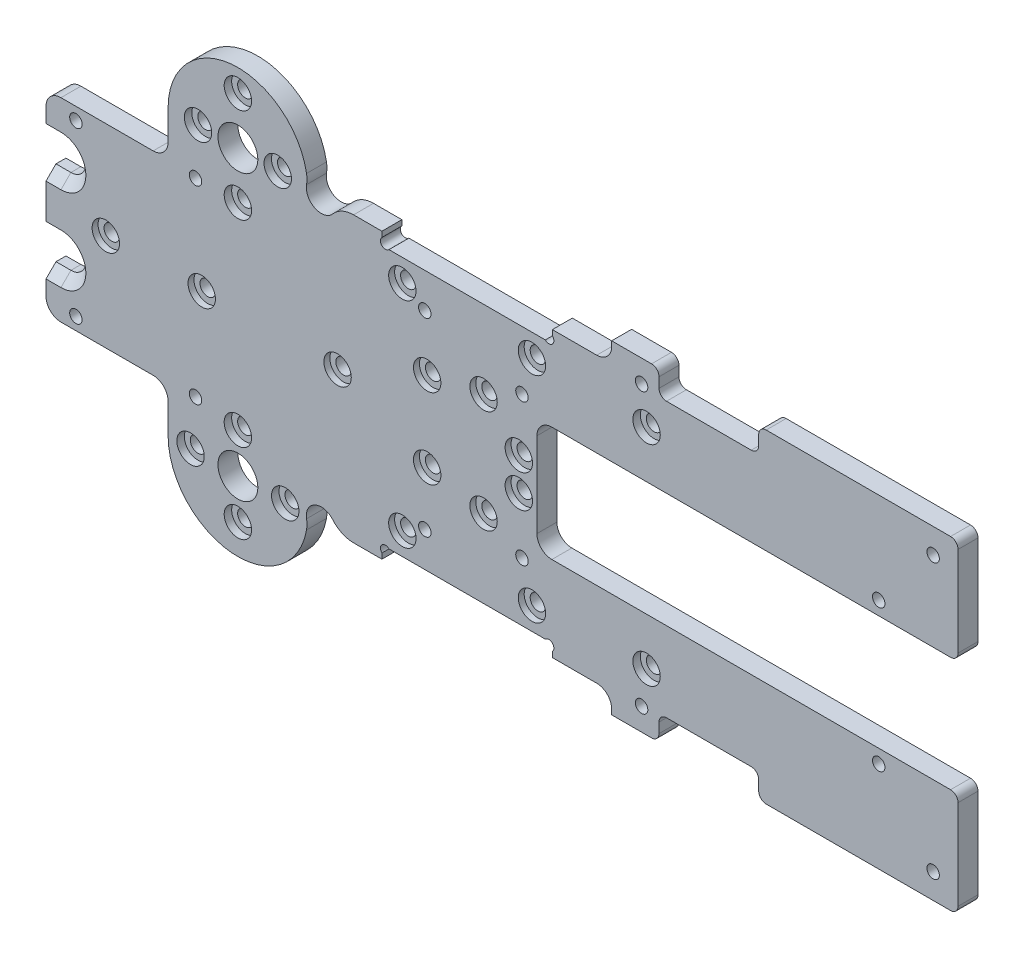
ISO-10303-21;
HEADER;
FILE_DESCRIPTION(('STEP AP214'),'2;1');
FILE_NAME('part.step','',(''),(''),'','','');
FILE_SCHEMA(('AUTOMOTIVE_DESIGN { 1 0 10303 214 1 1 1 1 }'));
ENDSEC;
DATA;
#1=APPLICATION_CONTEXT('core data for automotive mechanical design processes');
#2=APPLICATION_PROTOCOL_DEFINITION('international standard','automotive_design',2000,#1);
#3=PRODUCT_CONTEXT('',#1,'mechanical');
#4=PRODUCT('Part','Part','',(#3));
#5=PRODUCT_RELATED_PRODUCT_CATEGORY('part','',(#4));
#6=PRODUCT_DEFINITION_FORMATION('','',#4);
#7=PRODUCT_DEFINITION_CONTEXT('part definition',#1,'design');
#8=PRODUCT_DEFINITION('design','',#6,#7);
#9=PRODUCT_DEFINITION_SHAPE('','',#8);
#10=(LENGTH_UNIT() NAMED_UNIT(*) SI_UNIT(.MILLI.,.METRE.));
#11=(NAMED_UNIT(*) PLANE_ANGLE_UNIT() SI_UNIT($,.RADIAN.));
#12=(NAMED_UNIT(*) SI_UNIT($,.STERADIAN.) SOLID_ANGLE_UNIT());
#13=UNCERTAINTY_MEASURE_WITH_UNIT(LENGTH_MEASURE(1.E-05),#10,'distance_accuracy_value','');
#14=(GEOMETRIC_REPRESENTATION_CONTEXT(3) GLOBAL_UNCERTAINTY_ASSIGNED_CONTEXT((#13)) GLOBAL_UNIT_ASSIGNED_CONTEXT((#10,
#11,#12)) REPRESENTATION_CONTEXT('',''));
#15=CARTESIAN_POINT('',(0.,0.,0.));
#16=DIRECTION('',(0.,0.,1.));
#17=DIRECTION('',(1.,0.,0.));
#18=AXIS2_PLACEMENT_3D('',#15,#16,#17);
#19=CARTESIAN_POINT('',(80.,-21.,2.));
#20=DIRECTION('',(0.,0.,-1.));
#21=DIRECTION('',(-1.,0.,0.));
#22=AXIS2_PLACEMENT_3D('',#19,#20,#21);
#23=CYLINDRICAL_SURFACE('',#22,1.54999999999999);
#24=CARTESIAN_POINT('',(80.,-21.,-2.));
#25=DIRECTION('',(0.,0.,1.));
#26=DIRECTION('',(1.,0.,0.));
#27=AXIS2_PLACEMENT_3D('',#24,#25,#26);
#28=CIRCLE('',#27,1.54999999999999);
#29=CARTESIAN_POINT('',(81.55,-21.,-2.));
#30=VERTEX_POINT('',#29);
#31=EDGE_CURVE('E771',#30,#30,#28,.T.);
#32=ORIENTED_EDGE('',*,*,#31,.F.);
#33=EDGE_LOOP('',(#32));
#34=FACE_BOUND('',#33,.T.);
#35=CARTESIAN_POINT('',(80.,-21.,0.5));
#36=DIRECTION('',(0.,0.,1.));
#37=DIRECTION('',(1.,0.,0.));
#38=AXIS2_PLACEMENT_3D('',#35,#36,#37);
#39=CIRCLE('',#38,1.54999999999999);
#40=CARTESIAN_POINT('',(81.55,-21.,0.5));
#41=VERTEX_POINT('',#40);
#42=EDGE_CURVE('E41',#41,#41,#39,.T.);
#43=ORIENTED_EDGE('',*,*,#42,.T.);
#44=EDGE_LOOP('',(#43));
#45=FACE_BOUND('',#44,.T.);
#46=ADVANCED_FACE('F37',(#34,#45),#23,.F.);
#47=CARTESIAN_POINT('',(80.,21.,2.));
#48=DIRECTION('',(0.,0.,-1.));
#49=DIRECTION('',(-1.,0.,0.));
#50=AXIS2_PLACEMENT_3D('',#47,#48,#49);
#51=CYLINDRICAL_SURFACE('',#50,1.54999999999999);
#52=CARTESIAN_POINT('',(80.,21.,-2.));
#53=DIRECTION('',(0.,0.,1.));
#54=DIRECTION('',(1.,0.,0.));
#55=AXIS2_PLACEMENT_3D('',#52,#53,#54);
#56=CIRCLE('',#55,1.54999999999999);
#57=CARTESIAN_POINT('',(81.55,21.,-2.));
#58=VERTEX_POINT('',#57);
#59=EDGE_CURVE('E774',#58,#58,#56,.T.);
#60=ORIENTED_EDGE('',*,*,#59,.F.);
#61=EDGE_LOOP('',(#60));
#62=FACE_BOUND('',#61,.T.);
#63=CARTESIAN_POINT('',(80.,21.,0.5));
#64=DIRECTION('',(0.,0.,1.));
#65=DIRECTION('',(1.,0.,0.));
#66=AXIS2_PLACEMENT_3D('',#63,#64,#65);
#67=CIRCLE('',#66,1.54999999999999);
#68=CARTESIAN_POINT('',(81.55,21.,0.5));
#69=VERTEX_POINT('',#68);
#70=EDGE_CURVE('E1270',#69,#69,#67,.T.);
#71=ORIENTED_EDGE('',*,*,#70,.T.);
#72=EDGE_LOOP('',(#71));
#73=FACE_BOUND('',#72,.T.);
#74=ADVANCED_FACE('F1768',(#62,#73),#51,.F.);
#75=CARTESIAN_POINT('',(-2.,28.5,-2.));
#76=DIRECTION('',(0.,0.,1.));
#77=DIRECTION('',(1.,0.,0.));
#78=AXIS2_PLACEMENT_3D('',#75,#76,#77);
#79=PLANE('',#78);
#80=CARTESIAN_POINT('',(79.,-28.,-2.));
#81=DIRECTION('',(0.,0.,-1.));
#82=DIRECTION('',(-1.,0.,0.));
#83=AXIS2_PLACEMENT_3D('',#80,#81,#82);
#84=CIRCLE('',#83,1.24999999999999);
#85=CARTESIAN_POINT('',(77.75,-28.,-2.));
#86=VERTEX_POINT('',#85);
#87=EDGE_CURVE('E1269',#86,#86,#84,.T.);
#88=ORIENTED_EDGE('',*,*,#87,.F.);
#89=EDGE_LOOP('',(#88));
#90=FACE_BOUND('',#89,.T.);
#91=ORIENTED_EDGE('',*,*,#31,.T.);
#92=EDGE_LOOP('',(#91));
#93=FACE_BOUND('',#92,.T.);
#94=ORIENTED_EDGE('',*,*,#59,.T.);
#95=EDGE_LOOP('',(#94));
#96=FACE_BOUND('',#95,.T.);
#97=CARTESIAN_POINT('',(-2.,28.5,-2.));
#98=DIRECTION('',(0.,0.,1.));
#99=DIRECTION('',(1.,0.,0.));
#100=AXIS2_PLACEMENT_3D('',#97,#98,#99);
#101=CIRCLE('',#100,4.);
#102=CARTESIAN_POINT('',(2.,28.5,-2.));
#103=VERTEX_POINT('',#102);
#104=EDGE_CURVE('E777',#103,#103,#101,.T.);
#105=ORIENTED_EDGE('',*,*,#104,.T.);
#106=EDGE_LOOP('',(#105));
#107=FACE_BOUND('',#106,.T.);
#108=CARTESIAN_POINT('',(-2.,-28.5,-2.));
#109=DIRECTION('',(0.,0.,1.));
#110=DIRECTION('',(-1.,0.,0.));
#111=AXIS2_PLACEMENT_3D('',#108,#109,#110);
#112=CIRCLE('',#111,4.);
#113=CARTESIAN_POINT('',(-6.,-28.5,-2.));
#114=VERTEX_POINT('',#113);
#115=EDGE_CURVE('E781',#114,#114,#112,.T.);
#116=ORIENTED_EDGE('',*,*,#115,.T.);
#117=EDGE_LOOP('',(#116));
#118=FACE_BOUND('',#117,.T.);
#119=CARTESIAN_POINT('',(-28.5,0.,-2.));
#120=DIRECTION('',(0.,0.,1.));
#121=DIRECTION('',(1.,0.,0.));
#122=AXIS2_PLACEMENT_3D('',#119,#120,#121);
#123=CIRCLE('',#122,1.55);
#124=CARTESIAN_POINT('',(-26.95,0.,-2.));
#125=VERTEX_POINT('',#124);
#126=EDGE_CURVE('E787',#125,#125,#123,.T.);
#127=ORIENTED_EDGE('',*,*,#126,.T.);
#128=EDGE_LOOP('',(#127));
#129=FACE_BOUND('',#128,.T.);
#130=CARTESIAN_POINT('',(-9.25,0.,-2.));
#131=DIRECTION('',(0.,0.,1.));
#132=DIRECTION('',(1.,0.,0.));
#133=AXIS2_PLACEMENT_3D('',#130,#131,#132);
#134=CIRCLE('',#133,1.55);
#135=CARTESIAN_POINT('',(-7.7,0.,-2.));
#136=VERTEX_POINT('',#135);
#137=EDGE_CURVE('E792',#136,#136,#134,.T.);
#138=ORIENTED_EDGE('',*,*,#137,.T.);
#139=EDGE_LOOP('',(#138));
#140=FACE_BOUND('',#139,.T.);
#141=CARTESIAN_POINT('',(18.,0.,-2.));
#142=DIRECTION('',(0.,0.,1.));
#143=DIRECTION('',(1.,0.,0.));
#144=AXIS2_PLACEMENT_3D('',#141,#142,#143);
#145=CIRCLE('',#144,1.55);
#146=CARTESIAN_POINT('',(19.55,0.,-2.));
#147=VERTEX_POINT('',#146);
#148=EDGE_CURVE('E795',#147,#147,#145,.T.);
#149=ORIENTED_EDGE('',*,*,#148,.T.);
#150=EDGE_LOOP('',(#149));
#151=FACE_BOUND('',#150,.T.);
#152=CARTESIAN_POINT('',(47.2936074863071,10.3646752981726,-2.));
#153=DIRECTION('',(0.,0.,1.));
#154=DIRECTION('',(1.,0.,0.));
#155=AXIS2_PLACEMENT_3D('',#152,#153,#154);
#156=CIRCLE('',#155,1.55);
#157=CARTESIAN_POINT('',(48.8436074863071,10.3646752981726,-2.));
#158=VERTEX_POINT('',#157);
#159=EDGE_CURVE('E745',#158,#158,#156,.T.);
#160=ORIENTED_EDGE('',*,*,#159,.T.);
#161=EDGE_LOOP('',(#160));
#162=FACE_BOUND('',#161,.T.);
#163=CARTESIAN_POINT('',(35.9798989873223,-8.02010101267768,-2.));
#164=DIRECTION('',(0.,0.,1.));
#165=DIRECTION('',(1.,0.,0.));
#166=AXIS2_PLACEMENT_3D('',#163,#164,#165);
#167=CIRCLE('',#166,1.55);
#168=CARTESIAN_POINT('',(37.5298989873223,-8.02010101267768,-2.));
#169=VERTEX_POINT('',#168);
#170=EDGE_CURVE('E739',#169,#169,#167,.T.);
#171=ORIENTED_EDGE('',*,*,#170,.T.);
#172=EDGE_LOOP('',(#171));
#173=FACE_BOUND('',#172,.T.);
#174=CARTESIAN_POINT('',(54.3646752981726,3.2936074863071,-2.));
#175=DIRECTION('',(0.,0.,1.));
#176=DIRECTION('',(1.,0.,0.));
#177=AXIS2_PLACEMENT_3D('',#174,#175,#176);
#178=CIRCLE('',#177,1.55);
#179=CARTESIAN_POINT('',(55.9146752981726,3.2936074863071,-2.));
#180=VERTEX_POINT('',#179);
#181=EDGE_CURVE('E742',#180,#180,#178,.T.);
#182=ORIENTED_EDGE('',*,*,#181,.T.);
#183=EDGE_LOOP('',(#182));
#184=FACE_BOUND('',#183,.T.);
#185=DIRECTION('',(1.,0.,0.));
#186=VECTOR('',#185,1.);
#187=CARTESIAN_POINT('',(12.,-28.5,-2.));
#188=LINE('',#187,#186);
#189=CARTESIAN_POINT('',(21.2139412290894,-28.5,-2.));
#190=VERTEX_POINT('',#189);
#191=CARTESIAN_POINT('',(26.9,-28.5,-2.));
#192=VERTEX_POINT('',#191);
#193=EDGE_CURVE('E868',#190,#192,#188,.T.);
#194=ORIENTED_EDGE('',*,*,#193,.F.);
#195=CARTESIAN_POINT('',(21.2139412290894,-23.,-2.));
#196=DIRECTION('',(0.,0.,1.));
#197=DIRECTION('',(1.,0.,0.));
#198=AXIS2_PLACEMENT_3D('',#195,#196,#197);
#199=CIRCLE('',#198,5.5);
#200=CARTESIAN_POINT('',(17.0205207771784,-26.5588235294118,-2.));
#201=VERTEX_POINT('',#200);
#202=EDGE_CURVE('E1239',#190,#201,#199,.F.);
#203=ORIENTED_EDGE('',*,*,#202,.T.);
#204=CARTESIAN_POINT('',(14.7332005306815,-28.5,-2.));
#205=DIRECTION('',(0.,0.,1.));
#206=DIRECTION('',(1.,0.,0.));
#207=AXIS2_PLACEMENT_3D('',#204,#205,#206);
#208=CIRCLE('',#207,3.);
#209=CARTESIAN_POINT('',(11.780282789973,-29.0294117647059,-2.));
#210=VERTEX_POINT('',#209);
#211=EDGE_CURVE('E1310',#201,#210,#208,.T.);
#212=ORIENTED_EDGE('',*,*,#211,.T.);
#213=CARTESIAN_POINT('',(6.36660026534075,-30.,-2.));
#214=DIRECTION('',(0.,0.,1.));
#215=DIRECTION('',(1.,0.,0.));
#216=AXIS2_PLACEMENT_3D('',#213,#214,#215);
#217=CIRCLE('',#216,5.5);
#218=CARTESIAN_POINT('',(11.780282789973,-30.9705882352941,-2.));
#219=VERTEX_POINT('',#218);
#220=EDGE_CURVE('E1237',#210,#219,#217,.F.);
#221=ORIENTED_EDGE('',*,*,#220,.T.);
#222=CARTESIAN_POINT('',(-2.,-28.5,-2.));
#223=DIRECTION('',(0.,0.,1.));
#224=DIRECTION('',(-1.,0.,0.));
#225=AXIS2_PLACEMENT_3D('',#222,#223,#224);
#226=CIRCLE('',#225,14.);
#227=CARTESIAN_POINT('',(-16.,-28.5,-2.));
#228=VERTEX_POINT('',#227);
#229=EDGE_CURVE('E864',#228,#219,#226,.T.);
#230=ORIENTED_EDGE('',*,*,#229,.F.);
#231=DIRECTION('',(0.,-1.,0.));
#232=VECTOR('',#231,1.);
#233=CARTESIAN_POINT('',(-16.,-19.5,-2.));
#234=LINE('',#233,#232);
#235=CARTESIAN_POINT('',(-16.,-22.5,-2.));
#236=VERTEX_POINT('',#235);
#237=EDGE_CURVE('E862',#236,#228,#234,.T.);
#238=ORIENTED_EDGE('',*,*,#237,.F.);
#239=CARTESIAN_POINT('',(-19.,-22.5,-2.));
#240=DIRECTION('',(0.,0.,1.));
#241=DIRECTION('',(1.,0.,0.));
#242=AXIS2_PLACEMENT_3D('',#239,#240,#241);
#243=CIRCLE('',#242,3.);
#244=CARTESIAN_POINT('',(-19.,-19.5,-2.));
#245=VERTEX_POINT('',#244);
#246=EDGE_CURVE('E973',#236,#245,#243,.T.);
#247=ORIENTED_EDGE('',*,*,#246,.T.);
#248=DIRECTION('',(1.,0.,0.));
#249=VECTOR('',#248,1.);
#250=CARTESIAN_POINT('',(-40.5,-19.5,-2.));
#251=LINE('',#250,#249);
#252=CARTESIAN_POINT('',(-37.5,-19.5,-2.));
#253=VERTEX_POINT('',#252);
#254=EDGE_CURVE('E858',#253,#245,#251,.T.);
#255=ORIENTED_EDGE('',*,*,#254,.F.);
#256=CARTESIAN_POINT('',(-37.5,-16.5,-2.));
#257=DIRECTION('',(0.,0.,1.));
#258=DIRECTION('',(1.,0.,0.));
#259=AXIS2_PLACEMENT_3D('',#256,#257,#258);
#260=CIRCLE('',#259,3.);
#261=CARTESIAN_POINT('',(-40.5,-16.5,-2.));
#262=VERTEX_POINT('',#261);
#263=EDGE_CURVE('E925',#253,#262,#260,.F.);
#264=ORIENTED_EDGE('',*,*,#263,.T.);
#265=DIRECTION('',(0.,-1.,0.));
#266=VECTOR('',#265,1.);
#267=CARTESIAN_POINT('',(-40.5,-19.5,-2.));
#268=LINE('',#267,#266);
#269=CARTESIAN_POINT('',(-40.5,-11.5,-2.));
#270=VERTEX_POINT('',#269);
#271=EDGE_CURVE('E538',#270,#262,#268,.T.);
#272=ORIENTED_EDGE('',*,*,#271,.F.);
#273=DIRECTION('',(1.,0.,0.));
#274=VECTOR('',#273,1.);
#275=CARTESIAN_POINT('',(-2.,-11.5,-2.));
#276=LINE('',#275,#274);
#277=CARTESIAN_POINT('',(-37.5,-11.5,-2.));
#278=VERTEX_POINT('',#277);
#279=EDGE_CURVE('E529',#270,#278,#276,.T.);
#280=ORIENTED_EDGE('',*,*,#279,.T.);
#281=CARTESIAN_POINT('',(-37.5,-8.5,-2.));
#282=DIRECTION('',(0.,0.,1.));
#283=DIRECTION('',(1.,0.,0.));
#284=AXIS2_PLACEMENT_3D('',#281,#282,#283);
#285=CIRCLE('',#284,3.);
#286=CARTESIAN_POINT('',(-37.5,-5.5,-2.));
#287=VERTEX_POINT('',#286);
#288=EDGE_CURVE('E512',#278,#287,#285,.T.);
#289=ORIENTED_EDGE('',*,*,#288,.T.);
#290=DIRECTION('',(-1.,0.,0.));
#291=VECTOR('',#290,1.);
#292=CARTESIAN_POINT('',(-2.,-5.50000000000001,-2.));
#293=LINE('',#292,#291);
#294=CARTESIAN_POINT('',(-40.5,-5.5,-2.));
#295=VERTEX_POINT('',#294);
#296=EDGE_CURVE('E539',#287,#295,#293,.T.);
#297=ORIENTED_EDGE('',*,*,#296,.T.);
#298=CARTESIAN_POINT('',(-40.5,5.5,-2.));
#299=VERTEX_POINT('',#298);
#300=EDGE_CURVE('E859',#299,#295,#268,.T.);
#301=ORIENTED_EDGE('',*,*,#300,.F.);
#302=DIRECTION('',(1.,0.,0.));
#303=VECTOR('',#302,1.);
#304=CARTESIAN_POINT('',(-2.,5.5,-2.));
#305=LINE('',#304,#303);
#306=CARTESIAN_POINT('',(-37.5,5.5,-2.));
#307=VERTEX_POINT('',#306);
#308=EDGE_CURVE('E548',#299,#307,#305,.T.);
#309=ORIENTED_EDGE('',*,*,#308,.T.);
#310=CARTESIAN_POINT('',(-37.5,8.5,-2.));
#311=DIRECTION('',(0.,0.,1.));
#312=DIRECTION('',(1.,0.,0.));
#313=AXIS2_PLACEMENT_3D('',#310,#311,#312);
#314=CIRCLE('',#313,3.);
#315=CARTESIAN_POINT('',(-37.5,11.5,-2.));
#316=VERTEX_POINT('',#315);
#317=EDGE_CURVE('E1012',#307,#316,#314,.T.);
#318=ORIENTED_EDGE('',*,*,#317,.T.);
#319=DIRECTION('',(-1.,0.,0.));
#320=VECTOR('',#319,1.);
#321=CARTESIAN_POINT('',(-2.,11.5,-2.));
#322=LINE('',#321,#320);
#323=CARTESIAN_POINT('',(-40.5,11.5,-2.));
#324=VERTEX_POINT('',#323);
#325=EDGE_CURVE('E553',#316,#324,#322,.T.);
#326=ORIENTED_EDGE('',*,*,#325,.T.);
#327=CARTESIAN_POINT('',(-40.5,16.5,-2.));
#328=VERTEX_POINT('',#327);
#329=EDGE_CURVE('E855',#328,#324,#268,.T.);
#330=ORIENTED_EDGE('',*,*,#329,.F.);
#331=CARTESIAN_POINT('',(-37.5,16.5,-2.));
#332=DIRECTION('',(0.,0.,1.));
#333=DIRECTION('',(1.,0.,0.));
#334=AXIS2_PLACEMENT_3D('',#331,#332,#333);
#335=CIRCLE('',#334,3.);
#336=CARTESIAN_POINT('',(-37.5,19.5,-2.));
#337=VERTEX_POINT('',#336);
#338=EDGE_CURVE('E927',#328,#337,#335,.F.);
#339=ORIENTED_EDGE('',*,*,#338,.T.);
#340=DIRECTION('',(-1.,0.,0.));
#341=VECTOR('',#340,1.);
#342=CARTESIAN_POINT('',(-40.5,19.5,-2.));
#343=LINE('',#342,#341);
#344=CARTESIAN_POINT('',(-19.,19.5,-2.));
#345=VERTEX_POINT('',#344);
#346=EDGE_CURVE('E852',#345,#337,#343,.T.);
#347=ORIENTED_EDGE('',*,*,#346,.F.);
#348=CARTESIAN_POINT('',(-19.,22.5,-2.));
#349=DIRECTION('',(0.,0.,1.));
#350=DIRECTION('',(1.,0.,0.));
#351=AXIS2_PLACEMENT_3D('',#348,#349,#350);
#352=CIRCLE('',#351,3.);
#353=CARTESIAN_POINT('',(-16.,22.5,-2.));
#354=VERTEX_POINT('',#353);
#355=EDGE_CURVE('E969',#345,#354,#352,.T.);
#356=ORIENTED_EDGE('',*,*,#355,.T.);
#357=DIRECTION('',(0.,-1.,0.));
#358=VECTOR('',#357,1.);
#359=CARTESIAN_POINT('',(-16.,19.5,-2.));
#360=LINE('',#359,#358);
#361=CARTESIAN_POINT('',(-16.,28.5,-2.));
#362=VERTEX_POINT('',#361);
#363=EDGE_CURVE('E798',#362,#354,#360,.T.);
#364=ORIENTED_EDGE('',*,*,#363,.F.);
#365=CARTESIAN_POINT('',(-2.,28.5,-2.));
#366=DIRECTION('',(0.,0.,1.));
#367=DIRECTION('',(1.,0.,0.));
#368=AXIS2_PLACEMENT_3D('',#365,#366,#367);
#369=CIRCLE('',#368,14.);
#370=CARTESIAN_POINT('',(11.780282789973,30.9705882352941,-2.));
#371=VERTEX_POINT('',#370);
#372=EDGE_CURVE('E803',#371,#362,#369,.T.);
#373=ORIENTED_EDGE('',*,*,#372,.F.);
#374=CARTESIAN_POINT('',(6.36660026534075,30.,-2.));
#375=DIRECTION('',(0.,0.,1.));
#376=DIRECTION('',(1.,0.,0.));
#377=AXIS2_PLACEMENT_3D('',#374,#375,#376);
#378=CIRCLE('',#377,5.5);
#379=CARTESIAN_POINT('',(11.780282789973,29.0294117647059,-2.));
#380=VERTEX_POINT('',#379);
#381=EDGE_CURVE('E1233',#371,#380,#378,.F.);
#382=ORIENTED_EDGE('',*,*,#381,.T.);
#383=CARTESIAN_POINT('',(14.7332005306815,28.5,-2.));
#384=DIRECTION('',(0.,0.,1.));
#385=DIRECTION('',(1.,0.,0.));
#386=AXIS2_PLACEMENT_3D('',#383,#384,#385);
#387=CIRCLE('',#386,3.);
#388=CARTESIAN_POINT('',(17.0205207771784,26.5588235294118,-2.));
#389=VERTEX_POINT('',#388);
#390=EDGE_CURVE('E1315',#380,#389,#387,.T.);
#391=ORIENTED_EDGE('',*,*,#390,.T.);
#392=CARTESIAN_POINT('',(21.2139412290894,23.,-2.));
#393=DIRECTION('',(0.,0.,1.));
#394=DIRECTION('',(1.,0.,0.));
#395=AXIS2_PLACEMENT_3D('',#392,#393,#394);
#396=CIRCLE('',#395,5.5);
#397=CARTESIAN_POINT('',(21.2139412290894,28.5,-2.));
#398=VERTEX_POINT('',#397);
#399=EDGE_CURVE('E1235',#389,#398,#396,.F.);
#400=ORIENTED_EDGE('',*,*,#399,.T.);
#401=DIRECTION('',(-1.,0.,0.));
#402=VECTOR('',#401,1.);
#403=CARTESIAN_POINT('',(12.,28.5,-2.));
#404=LINE('',#403,#402);
#405=CARTESIAN_POINT('',(26.9,28.5,-2.));
#406=VERTEX_POINT('',#405);
#407=EDGE_CURVE('E890',#406,#398,#404,.T.);
#408=ORIENTED_EDGE('',*,*,#407,.F.);
#409=DIRECTION('',(0.,-1.,0.));
#410=VECTOR('',#409,1.);
#411=CARTESIAN_POINT('',(26.9,26.,-2.));
#412=LINE('',#411,#410);
#413=CARTESIAN_POINT('',(26.9,27.4141428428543,-2.));
#414=VERTEX_POINT('',#413);
#415=EDGE_CURVE('E672',#406,#414,#412,.T.);
#416=ORIENTED_EDGE('',*,*,#415,.T.);
#417=CARTESIAN_POINT('',(27.6,26.7,-2.));
#418=DIRECTION('',(0.,0.,1.));
#419=DIRECTION('',(-1.,0.,0.));
#420=AXIS2_PLACEMENT_3D('',#417,#418,#419);
#421=CIRCLE('',#420,0.999999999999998);
#422=CARTESIAN_POINT('',(28.3141428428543,26.,-2.));
#423=VERTEX_POINT('',#422);
#424=EDGE_CURVE('E563',#414,#423,#421,.T.);
#425=ORIENTED_EDGE('',*,*,#424,.T.);
#426=DIRECTION('',(1.,0.,0.));
#427=VECTOR('',#426,1.);
#428=CARTESIAN_POINT('',(26.9,26.,-2.));
#429=LINE('',#428,#427);
#430=CARTESIAN_POINT('',(59.6858571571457,26.,-2.));
#431=VERTEX_POINT('',#430);
#432=EDGE_CURVE('E675',#423,#431,#429,.T.);
#433=ORIENTED_EDGE('',*,*,#432,.T.);
#434=CARTESIAN_POINT('',(60.4,26.7,-2.));
#435=DIRECTION('',(0.,0.,1.));
#436=DIRECTION('',(-1.,0.,0.));
#437=AXIS2_PLACEMENT_3D('',#434,#435,#436);
#438=CIRCLE('',#437,0.999999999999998);
#439=CARTESIAN_POINT('',(61.1,27.4141428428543,-2.));
#440=VERTEX_POINT('',#439);
#441=EDGE_CURVE('E567',#431,#440,#438,.T.);
#442=ORIENTED_EDGE('',*,*,#441,.T.);
#443=DIRECTION('',(0.,1.,0.));
#444=VECTOR('',#443,1.);
#445=CARTESIAN_POINT('',(61.1,26.,-2.));
#446=LINE('',#445,#444);
#447=CARTESIAN_POINT('',(61.1,28.5,-2.));
#448=VERTEX_POINT('',#447);
#449=EDGE_CURVE('E678',#440,#448,#446,.T.);
#450=ORIENTED_EDGE('',*,*,#449,.T.);
#451=CARTESIAN_POINT('',(70.,28.5,-2.));
#452=VERTEX_POINT('',#451);
#453=EDGE_CURVE('E891',#452,#448,#404,.T.);
#454=ORIENTED_EDGE('',*,*,#453,.F.);
#455=CARTESIAN_POINT('',(70.,31.5,-2.));
#456=DIRECTION('',(0.,0.,1.));
#457=DIRECTION('',(1.,0.,0.));
#458=AXIS2_PLACEMENT_3D('',#455,#456,#457);
#459=CIRCLE('',#458,3.);
#460=CARTESIAN_POINT('',(73.,31.5,-2.));
#461=VERTEX_POINT('',#460);
#462=EDGE_CURVE('E991',#452,#461,#459,.T.);
#463=ORIENTED_EDGE('',*,*,#462,.T.);
#464=DIRECTION('',(0.,-1.,0.));
#465=VECTOR('',#464,1.);
#466=CARTESIAN_POINT('',(73.,32.5,-2.));
#467=LINE('',#466,#465);
#468=CARTESIAN_POINT('',(73.,32.5,-2.));
#469=VERTEX_POINT('',#468);
#470=EDGE_CURVE('E887',#469,#461,#467,.T.);
#471=ORIENTED_EDGE('',*,*,#470,.F.);
#472=DIRECTION('',(-1.,0.,0.));
#473=VECTOR('',#472,1.);
#474=CARTESIAN_POINT('',(73.,32.5,-2.));
#475=LINE('',#474,#473);
#476=CARTESIAN_POINT('',(81.,32.5,-2.));
#477=VERTEX_POINT('',#476);
#478=EDGE_CURVE('E884',#477,#469,#475,.T.);
#479=ORIENTED_EDGE('',*,*,#478,.F.);
#480=CARTESIAN_POINT('',(81.,31.,-2.));
#481=DIRECTION('',(0.,0.,1.));
#482=DIRECTION('',(1.,0.,0.));
#483=AXIS2_PLACEMENT_3D('',#480,#481,#482);
#484=CIRCLE('',#483,1.5);
#485=CARTESIAN_POINT('',(82.5,31.,-2.));
#486=VERTEX_POINT('',#485);
#487=EDGE_CURVE('E1149',#477,#486,#484,.F.);
#488=ORIENTED_EDGE('',*,*,#487,.T.);
#489=DIRECTION('',(0.,-1.,0.));
#490=VECTOR('',#489,1.);
#491=CARTESIAN_POINT('',(82.5,28.5,-2.));
#492=LINE('',#491,#490);
#493=CARTESIAN_POINT('',(82.5,29.,-2.));
#494=VERTEX_POINT('',#493);
#495=EDGE_CURVE('E1327',#486,#494,#492,.T.);
#496=ORIENTED_EDGE('',*,*,#495,.T.);
#497=CARTESIAN_POINT('',(84.,29.,-2.));
#498=DIRECTION('',(0.,0.,1.));
#499=DIRECTION('',(1.,0.,0.));
#500=AXIS2_PLACEMENT_3D('',#497,#498,#499);
#501=CIRCLE('',#500,1.5);
#502=CARTESIAN_POINT('',(84.,27.5,-2.));
#503=VERTEX_POINT('',#502);
#504=EDGE_CURVE('E1228',#494,#503,#501,.T.);
#505=ORIENTED_EDGE('',*,*,#504,.T.);
#506=DIRECTION('',(1.,0.,0.));
#507=VECTOR('',#506,1.);
#508=CARTESIAN_POINT('',(-2.,27.5,-2.));
#509=LINE('',#508,#507);
#510=CARTESIAN_POINT('',(101.,27.5,-2.));
#511=VERTEX_POINT('',#510);
#512=EDGE_CURVE('E1119',#503,#511,#509,.T.);
#513=ORIENTED_EDGE('',*,*,#512,.T.);
#514=CARTESIAN_POINT('',(101.,29.,-2.));
#515=DIRECTION('',(0.,0.,1.));
#516=DIRECTION('',(1.,0.,0.));
#517=AXIS2_PLACEMENT_3D('',#514,#515,#516);
#518=CIRCLE('',#517,1.5);
#519=CARTESIAN_POINT('',(102.5,29.,-2.));
#520=VERTEX_POINT('',#519);
#521=EDGE_CURVE('E1224',#511,#520,#518,.T.);
#522=ORIENTED_EDGE('',*,*,#521,.T.);
#523=DIRECTION('',(0.,1.,0.));
#524=VECTOR('',#523,1.);
#525=CARTESIAN_POINT('',(102.5,28.5,-2.));
#526=LINE('',#525,#524);
#527=CARTESIAN_POINT('',(102.5,31.,-2.));
#528=VERTEX_POINT('',#527);
#529=EDGE_CURVE('E1330',#520,#528,#526,.T.);
#530=ORIENTED_EDGE('',*,*,#529,.T.);
#531=CARTESIAN_POINT('',(104.,31.,-2.));
#532=DIRECTION('',(0.,0.,1.));
#533=DIRECTION('',(1.,0.,0.));
#534=AXIS2_PLACEMENT_3D('',#531,#532,#533);
#535=CIRCLE('',#534,1.5);
#536=CARTESIAN_POINT('',(104.,32.5,-2.));
#537=VERTEX_POINT('',#536);
#538=EDGE_CURVE('E1151',#528,#537,#535,.F.);
#539=ORIENTED_EDGE('',*,*,#538,.T.);
#540=CARTESIAN_POINT('',(141.,32.5,-2.));
#541=VERTEX_POINT('',#540);
#542=EDGE_CURVE('E886',#541,#537,#475,.T.);
#543=ORIENTED_EDGE('',*,*,#542,.F.);
#544=CARTESIAN_POINT('',(141.,31.,-2.));
#545=DIRECTION('',(0.,0.,1.));
#546=DIRECTION('',(1.,0.,0.));
#547=AXIS2_PLACEMENT_3D('',#544,#545,#546);
#548=CIRCLE('',#547,1.5);
#549=CARTESIAN_POINT('',(142.5,31.,-2.));
#550=VERTEX_POINT('',#549);
#551=EDGE_CURVE('E1163',#541,#550,#548,.F.);
#552=ORIENTED_EDGE('',*,*,#551,.T.);
#553=DIRECTION('',(0.,1.,0.));
#554=VECTOR('',#553,1.);
#555=CARTESIAN_POINT('',(142.5,32.5,-2.));
#556=LINE('',#555,#554);
#557=CARTESIAN_POINT('',(142.5,13.,-2.));
#558=VERTEX_POINT('',#557);
#559=EDGE_CURVE('E1059',#558,#550,#556,.T.);
#560=ORIENTED_EDGE('',*,*,#559,.F.);
#561=CARTESIAN_POINT('',(141.,13.,-2.));
#562=DIRECTION('',(0.,0.,1.));
#563=DIRECTION('',(1.,0.,0.));
#564=AXIS2_PLACEMENT_3D('',#561,#562,#563);
#565=CIRCLE('',#564,1.5);
#566=CARTESIAN_POINT('',(141.,11.5,-2.));
#567=VERTEX_POINT('',#566);
#568=EDGE_CURVE('E1161',#558,#567,#565,.F.);
#569=ORIENTED_EDGE('',*,*,#568,.T.);
#570=DIRECTION('',(1.,0.,0.));
#571=VECTOR('',#570,1.);
#572=CARTESIAN_POINT('',(58.,11.5,-2.));
#573=LINE('',#572,#571);
#574=CARTESIAN_POINT('',(61.,11.5,-2.));
#575=VERTEX_POINT('',#574);
#576=EDGE_CURVE('E881',#575,#567,#573,.T.);
#577=ORIENTED_EDGE('',*,*,#576,.F.);
#578=CARTESIAN_POINT('',(61.,8.5,-2.));
#579=DIRECTION('',(0.,0.,1.));
#580=DIRECTION('',(1.,0.,0.));
#581=AXIS2_PLACEMENT_3D('',#578,#579,#580);
#582=CIRCLE('',#581,3.);
#583=CARTESIAN_POINT('',(58.,8.5,-2.));
#584=VERTEX_POINT('',#583);
#585=EDGE_CURVE('E987',#575,#584,#582,.T.);
#586=ORIENTED_EDGE('',*,*,#585,.T.);
#587=DIRECTION('',(0.,1.,0.));
#588=VECTOR('',#587,1.);
#589=CARTESIAN_POINT('',(58.,11.5,-2.));
#590=LINE('',#589,#588);
#591=CARTESIAN_POINT('',(58.,-8.49999999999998,-2.));
#592=VERTEX_POINT('',#591);
#593=EDGE_CURVE('E878',#592,#584,#590,.T.);
#594=ORIENTED_EDGE('',*,*,#593,.F.);
#595=CARTESIAN_POINT('',(61.,-8.49999999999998,-2.));
#596=DIRECTION('',(0.,0.,1.));
#597=DIRECTION('',(1.,0.,0.));
#598=AXIS2_PLACEMENT_3D('',#595,#596,#597);
#599=CIRCLE('',#598,3.);
#600=CARTESIAN_POINT('',(61.,-11.5,-2.));
#601=VERTEX_POINT('',#600);
#602=EDGE_CURVE('E982',#592,#601,#599,.T.);
#603=ORIENTED_EDGE('',*,*,#602,.T.);
#604=DIRECTION('',(-1.,0.,0.));
#605=VECTOR('',#604,1.);
#606=CARTESIAN_POINT('',(58.,-11.5,-2.));
#607=LINE('',#606,#605);
#608=CARTESIAN_POINT('',(141.,-11.5,-2.));
#609=VERTEX_POINT('',#608);
#610=EDGE_CURVE('E876',#609,#601,#607,.T.);
#611=ORIENTED_EDGE('',*,*,#610,.F.);
#612=CARTESIAN_POINT('',(141.,-13.,-2.));
#613=DIRECTION('',(0.,0.,1.));
#614=DIRECTION('',(1.,0.,0.));
#615=AXIS2_PLACEMENT_3D('',#612,#613,#614);
#616=CIRCLE('',#615,1.5);
#617=CARTESIAN_POINT('',(142.5,-13.,-2.));
#618=VERTEX_POINT('',#617);
#619=EDGE_CURVE('E1159',#609,#618,#616,.F.);
#620=ORIENTED_EDGE('',*,*,#619,.T.);
#621=DIRECTION('',(0.,1.,0.));
#622=VECTOR('',#621,1.);
#623=CARTESIAN_POINT('',(142.5,-11.5,-2.));
#624=LINE('',#623,#622);
#625=CARTESIAN_POINT('',(142.5,-31.,-2.));
#626=VERTEX_POINT('',#625);
#627=EDGE_CURVE('E1440',#626,#618,#624,.T.);
#628=ORIENTED_EDGE('',*,*,#627,.F.);
#629=CARTESIAN_POINT('',(141.,-31.,-2.));
#630=DIRECTION('',(0.,0.,1.));
#631=DIRECTION('',(1.,0.,0.));
#632=AXIS2_PLACEMENT_3D('',#629,#630,#631);
#633=CIRCLE('',#632,1.5);
#634=CARTESIAN_POINT('',(141.,-32.5,-2.));
#635=VERTEX_POINT('',#634);
#636=EDGE_CURVE('E1157',#626,#635,#633,.F.);
#637=ORIENTED_EDGE('',*,*,#636,.T.);
#638=DIRECTION('',(1.,0.,0.));
#639=VECTOR('',#638,1.);
#640=CARTESIAN_POINT('',(73.,-32.5,-2.));
#641=LINE('',#640,#639);
#642=CARTESIAN_POINT('',(104.,-32.5,-2.));
#643=VERTEX_POINT('',#642);
#644=EDGE_CURVE('E872',#643,#635,#641,.T.);
#645=ORIENTED_EDGE('',*,*,#644,.F.);
#646=CARTESIAN_POINT('',(104.,-31.,-2.));
#647=DIRECTION('',(0.,0.,1.));
#648=DIRECTION('',(1.,0.,0.));
#649=AXIS2_PLACEMENT_3D('',#646,#647,#648);
#650=CIRCLE('',#649,1.5);
#651=CARTESIAN_POINT('',(102.5,-31.,-2.));
#652=VERTEX_POINT('',#651);
#653=EDGE_CURVE('E1155',#643,#652,#650,.F.);
#654=ORIENTED_EDGE('',*,*,#653,.T.);
#655=DIRECTION('',(0.,1.,0.));
#656=VECTOR('',#655,1.);
#657=CARTESIAN_POINT('',(102.5,28.5,-2.));
#658=LINE('',#657,#656);
#659=CARTESIAN_POINT('',(102.5,-29.,-2.));
#660=VERTEX_POINT('',#659);
#661=EDGE_CURVE('E1342',#652,#660,#658,.T.);
#662=ORIENTED_EDGE('',*,*,#661,.T.);
#663=CARTESIAN_POINT('',(101.,-29.,-2.));
#664=DIRECTION('',(0.,0.,1.));
#665=DIRECTION('',(1.,0.,0.));
#666=AXIS2_PLACEMENT_3D('',#663,#664,#665);
#667=CIRCLE('',#666,1.5);
#668=CARTESIAN_POINT('',(101.,-27.5,-2.));
#669=VERTEX_POINT('',#668);
#670=EDGE_CURVE('E1216',#660,#669,#667,.T.);
#671=ORIENTED_EDGE('',*,*,#670,.T.);
#672=DIRECTION('',(-1.,0.,0.));
#673=VECTOR('',#672,1.);
#674=CARTESIAN_POINT('',(-2.,-27.5,-2.));
#675=LINE('',#674,#673);
#676=CARTESIAN_POINT('',(84.,-27.5,-2.));
#677=VERTEX_POINT('',#676);
#678=EDGE_CURVE('E1051',#669,#677,#675,.T.);
#679=ORIENTED_EDGE('',*,*,#678,.T.);
#680=CARTESIAN_POINT('',(84.,-29.,-2.));
#681=DIRECTION('',(0.,0.,1.));
#682=DIRECTION('',(1.,0.,0.));
#683=AXIS2_PLACEMENT_3D('',#680,#681,#682);
#684=CIRCLE('',#683,1.5);
#685=CARTESIAN_POINT('',(82.5,-29.,-2.));
#686=VERTEX_POINT('',#685);
#687=EDGE_CURVE('E1220',#677,#686,#684,.T.);
#688=ORIENTED_EDGE('',*,*,#687,.T.);
#689=DIRECTION('',(0.,-1.,0.));
#690=VECTOR('',#689,1.);
#691=CARTESIAN_POINT('',(82.5,28.5,-2.));
#692=LINE('',#691,#690);
#693=CARTESIAN_POINT('',(82.5,-31.,-2.));
#694=VERTEX_POINT('',#693);
#695=EDGE_CURVE('E1345',#686,#694,#692,.T.);
#696=ORIENTED_EDGE('',*,*,#695,.T.);
#697=CARTESIAN_POINT('',(81.,-31.,-2.));
#698=DIRECTION('',(0.,0.,1.));
#699=DIRECTION('',(1.,0.,0.));
#700=AXIS2_PLACEMENT_3D('',#697,#698,#699);
#701=CIRCLE('',#700,1.5);
#702=CARTESIAN_POINT('',(81.,-32.5,-2.));
#703=VERTEX_POINT('',#702);
#704=EDGE_CURVE('E1153',#694,#703,#701,.F.);
#705=ORIENTED_EDGE('',*,*,#704,.T.);
#706=CARTESIAN_POINT('',(73.,-32.5,-2.));
#707=VERTEX_POINT('',#706);
#708=EDGE_CURVE('E873',#707,#703,#641,.T.);
#709=ORIENTED_EDGE('',*,*,#708,.F.);
#710=DIRECTION('',(0.,-1.,0.));
#711=VECTOR('',#710,1.);
#712=CARTESIAN_POINT('',(73.,-28.5,-2.));
#713=LINE('',#712,#711);
#714=CARTESIAN_POINT('',(73.,-31.5,-2.));
#715=VERTEX_POINT('',#714);
#716=EDGE_CURVE('E870',#715,#707,#713,.T.);
#717=ORIENTED_EDGE('',*,*,#716,.F.);
#718=CARTESIAN_POINT('',(70.,-31.5,-2.));
#719=DIRECTION('',(0.,0.,1.));
#720=DIRECTION('',(1.,0.,0.));
#721=AXIS2_PLACEMENT_3D('',#718,#719,#720);
#722=CIRCLE('',#721,3.);
#723=CARTESIAN_POINT('',(70.,-28.5,-2.));
#724=VERTEX_POINT('',#723);
#725=EDGE_CURVE('E977',#715,#724,#722,.T.);
#726=ORIENTED_EDGE('',*,*,#725,.T.);
#727=CARTESIAN_POINT('',(61.1,-28.5,-2.));
#728=VERTEX_POINT('',#727);
#729=EDGE_CURVE('E867',#728,#724,#188,.T.);
#730=ORIENTED_EDGE('',*,*,#729,.F.);
#731=DIRECTION('',(0.,1.,0.));
#732=VECTOR('',#731,1.);
#733=CARTESIAN_POINT('',(61.1,-26.,-2.));
#734=LINE('',#733,#732);
#735=CARTESIAN_POINT('',(61.1,-27.4141428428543,-2.));
#736=VERTEX_POINT('',#735);
#737=EDGE_CURVE('E693',#728,#736,#734,.T.);
#738=ORIENTED_EDGE('',*,*,#737,.T.);
#739=CARTESIAN_POINT('',(60.4,-26.7,-2.));
#740=DIRECTION('',(0.,0.,1.));
#741=DIRECTION('',(1.,0.,0.));
#742=AXIS2_PLACEMENT_3D('',#739,#740,#741);
#743=CIRCLE('',#742,0.999999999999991);
#744=CARTESIAN_POINT('',(59.6858571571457,-26.,-2.));
#745=VERTEX_POINT('',#744);
#746=EDGE_CURVE('E557',#736,#745,#743,.T.);
#747=ORIENTED_EDGE('',*,*,#746,.T.);
#748=DIRECTION('',(-1.,0.,0.));
#749=VECTOR('',#748,1.);
#750=CARTESIAN_POINT('',(26.9,-26.,-2.));
#751=LINE('',#750,#749);
#752=CARTESIAN_POINT('',(28.3141428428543,-26.,-2.));
#753=VERTEX_POINT('',#752);
#754=EDGE_CURVE('E696',#745,#753,#751,.T.);
#755=ORIENTED_EDGE('',*,*,#754,.T.);
#756=CARTESIAN_POINT('',(27.6,-26.7,-2.));
#757=DIRECTION('',(0.,0.,1.));
#758=DIRECTION('',(1.,0.,0.));
#759=AXIS2_PLACEMENT_3D('',#756,#757,#758);
#760=CIRCLE('',#759,0.999999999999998);
#761=CARTESIAN_POINT('',(26.9,-27.4141428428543,-2.));
#762=VERTEX_POINT('',#761);
#763=EDGE_CURVE('E581',#753,#762,#760,.T.);
#764=ORIENTED_EDGE('',*,*,#763,.T.);
#765=DIRECTION('',(0.,-1.,0.));
#766=VECTOR('',#765,1.);
#767=CARTESIAN_POINT('',(26.9,-26.,-2.));
#768=LINE('',#767,#766);
#769=EDGE_CURVE('E698',#762,#192,#768,.T.);
#770=ORIENTED_EDGE('',*,*,#769,.T.);
#771=EDGE_LOOP('',(#194,#203,#212,#221,#230,#238,#247,#255,#264,#272,#280,#289,#297,#301,#309,
#318,#326,#330,#339,#347,#356,#364,#373,#382,#391,#400,#408,#416,#425,#433,#442,#450,#454,#463,
#471,#479,#488,#496,#505,#513,#522,#530,#539,#543,#552,#560,#569,#577,#586,#594,#603,#611,#620,
#628,#637,#645,#654,#662,#671,#679,#688,#696,#705,#709,#717,#726,#730,#738,#747,#755,#764,#770));
#772=FACE_BOUND('',#771,.T.);
#773=CARTESIAN_POINT('',(47.2936074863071,-10.3646752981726,-2.));
#774=DIRECTION('',(0.,0.,-1.));
#775=DIRECTION('',(1.,0.,0.));
#776=AXIS2_PLACEMENT_3D('',#773,#774,#775);
#777=CIRCLE('',#776,1.55);
#778=CARTESIAN_POINT('',(48.8436074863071,-10.3646752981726,-2.));
#779=VERTEX_POINT('',#778);
#780=EDGE_CURVE('E667',#779,#779,#777,.T.);
#781=ORIENTED_EDGE('',*,*,#780,.F.);
#782=EDGE_LOOP('',(#781));
#783=FACE_BOUND('',#782,.T.);
#784=CARTESIAN_POINT('',(35.9798989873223,8.02010101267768,-2.));
#785=DIRECTION('',(0.,0.,-1.));
#786=DIRECTION('',(1.,0.,0.));
#787=AXIS2_PLACEMENT_3D('',#784,#785,#786);
#788=CIRCLE('',#787,1.55);
#789=CARTESIAN_POINT('',(37.5298989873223,8.02010101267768,-2.));
#790=VERTEX_POINT('',#789);
#791=EDGE_CURVE('E661',#790,#790,#788,.T.);
#792=ORIENTED_EDGE('',*,*,#791,.F.);
#793=EDGE_LOOP('',(#792));
#794=FACE_BOUND('',#793,.T.);
#795=CARTESIAN_POINT('',(54.3646752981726,-3.2936074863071,-2.));
#796=DIRECTION('',(0.,0.,-1.));
#797=DIRECTION('',(1.,0.,0.));
#798=AXIS2_PLACEMENT_3D('',#795,#796,#797);
#799=CIRCLE('',#798,1.55);
#800=CARTESIAN_POINT('',(55.9146752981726,-3.2936074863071,-2.));
#801=VERTEX_POINT('',#800);
#802=EDGE_CURVE('E664',#801,#801,#799,.T.);
#803=ORIENTED_EDGE('',*,*,#802,.F.);
#804=EDGE_LOOP('',(#803));
#805=FACE_BOUND('',#804,.T.);
#806=CARTESIAN_POINT('',(31.,21.5,-2.));
#807=DIRECTION('',(0.,0.,1.));
#808=DIRECTION('',(1.,0.,0.));
#809=AXIS2_PLACEMENT_3D('',#806,#807,#808);
#810=CIRCLE('',#809,1.55);
#811=CARTESIAN_POINT('',(32.55,21.5,-2.));
#812=VERTEX_POINT('',#811);
#813=EDGE_CURVE('E628',#812,#812,#810,.T.);
#814=ORIENTED_EDGE('',*,*,#813,.T.);
#815=EDGE_LOOP('',(#814));
#816=FACE_BOUND('',#815,.T.);
#817=CARTESIAN_POINT('',(57.,-21.5,-2.));
#818=DIRECTION('',(0.,0.,1.));
#819=DIRECTION('',(1.,0.,0.));
#820=AXIS2_PLACEMENT_3D('',#817,#818,#819);
#821=CIRCLE('',#820,1.55);
#822=CARTESIAN_POINT('',(58.55,-21.5,-2.));
#823=VERTEX_POINT('',#822);
#824=EDGE_CURVE('E622',#823,#823,#821,.T.);
#825=ORIENTED_EDGE('',*,*,#824,.T.);
#826=EDGE_LOOP('',(#825));
#827=FACE_BOUND('',#826,.T.);
#828=CARTESIAN_POINT('',(31.,-21.5,-2.));
#829=DIRECTION('',(0.,0.,1.));
#830=DIRECTION('',(1.,0.,0.));
#831=AXIS2_PLACEMENT_3D('',#828,#829,#830);
#832=CIRCLE('',#831,1.55);
#833=CARTESIAN_POINT('',(32.55,-21.5,-2.));
#834=VERTEX_POINT('',#833);
#835=EDGE_CURVE('E629',#834,#834,#832,.T.);
#836=ORIENTED_EDGE('',*,*,#835,.T.);
#837=EDGE_LOOP('',(#836));
#838=FACE_BOUND('',#837,.T.);
#839=CARTESIAN_POINT('',(57.,21.5,-2.));
#840=DIRECTION('',(0.,0.,1.));
#841=DIRECTION('',(1.,0.,0.));
#842=AXIS2_PLACEMENT_3D('',#839,#840,#841);
#843=CIRCLE('',#842,1.55);
#844=CARTESIAN_POINT('',(58.55,21.5,-2.));
#845=VERTEX_POINT('',#844);
#846=EDGE_CURVE('E625',#845,#845,#843,.T.);
#847=ORIENTED_EDGE('',*,*,#846,.T.);
#848=EDGE_LOOP('',(#847));
#849=FACE_BOUND('',#848,.T.);
#850=CARTESIAN_POINT('',(55.0000000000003,-14.225,-2.));
#851=DIRECTION('',(0.,0.,1.));
#852=DIRECTION('',(1.,0.,0.));
#853=AXIS2_PLACEMENT_3D('',#850,#851,#852);
#854=CIRCLE('',#853,1.25);
#855=CARTESIAN_POINT('',(56.2500000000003,-14.225,-2.));
#856=VERTEX_POINT('',#855);
#857=EDGE_CURVE('E1062',#856,#856,#854,.T.);
#858=ORIENTED_EDGE('',*,*,#857,.T.);
#859=EDGE_LOOP('',(#858));
#860=FACE_BOUND('',#859,.T.);
#861=CARTESIAN_POINT('',(126.58,-14.225,-2.));
#862=DIRECTION('',(0.,0.,1.));
#863=DIRECTION('',(1.,0.,0.));
#864=AXIS2_PLACEMENT_3D('',#861,#862,#863);
#865=CIRCLE('',#864,1.25);
#866=CARTESIAN_POINT('',(127.83,-14.225,-2.));
#867=VERTEX_POINT('',#866);
#868=EDGE_CURVE('E1067',#867,#867,#865,.T.);
#869=ORIENTED_EDGE('',*,*,#868,.T.);
#870=EDGE_LOOP('',(#869));
#871=FACE_BOUND('',#870,.T.);
#872=CARTESIAN_POINT('',(126.58,14.225,-2.));
#873=DIRECTION('',(0.,0.,1.));
#874=DIRECTION('',(1.,0.,0.));
#875=AXIS2_PLACEMENT_3D('',#872,#873,#874);
#876=CIRCLE('',#875,1.25);
#877=CARTESIAN_POINT('',(127.83,14.225,-2.));
#878=VERTEX_POINT('',#877);
#879=EDGE_CURVE('E1431',#878,#878,#876,.T.);
#880=ORIENTED_EDGE('',*,*,#879,.T.);
#881=EDGE_LOOP('',(#880));
#882=FACE_BOUND('',#881,.T.);
#883=CARTESIAN_POINT('',(55.,14.225,-2.));
#884=DIRECTION('',(0.,0.,1.));
#885=DIRECTION('',(1.,0.,0.));
#886=AXIS2_PLACEMENT_3D('',#883,#884,#885);
#887=CIRCLE('',#886,1.25);
#888=CARTESIAN_POINT('',(56.25,14.225,-2.));
#889=VERTEX_POINT('',#888);
#890=EDGE_CURVE('E1071',#889,#889,#887,.T.);
#891=ORIENTED_EDGE('',*,*,#890,.T.);
#892=EDGE_LOOP('',(#891));
#893=FACE_BOUND('',#892,.T.);
#894=CARTESIAN_POINT('',(137.5,27.5,-2.));
#895=DIRECTION('',(0.,0.,1.));
#896=DIRECTION('',(1.,0.,0.));
#897=AXIS2_PLACEMENT_3D('',#894,#895,#896);
#898=CIRCLE('',#897,1.25);
#899=CARTESIAN_POINT('',(138.75,27.5,-2.));
#900=VERTEX_POINT('',#899);
#901=EDGE_CURVE('E1076',#900,#900,#898,.T.);
#902=ORIENTED_EDGE('',*,*,#901,.T.);
#903=EDGE_LOOP('',(#902));
#904=FACE_BOUND('',#903,.T.);
#905=CARTESIAN_POINT('',(137.5,-27.5,-2.));
#906=DIRECTION('',(0.,0.,1.));
#907=DIRECTION('',(1.,0.,0.));
#908=AXIS2_PLACEMENT_3D('',#905,#906,#907);
#909=CIRCLE('',#908,1.25);
#910=CARTESIAN_POINT('',(138.75,-27.5,-2.));
#911=VERTEX_POINT('',#910);
#912=EDGE_CURVE('E1422',#911,#911,#909,.T.);
#913=ORIENTED_EDGE('',*,*,#912,.T.);
#914=EDGE_LOOP('',(#913));
#915=FACE_BOUND('',#914,.T.);
#916=CARTESIAN_POINT('',(-34.5,-17.,-2.));
#917=DIRECTION('',(0.,0.,1.));
#918=DIRECTION('',(1.,0.,0.));
#919=AXIS2_PLACEMENT_3D('',#916,#917,#918);
#920=CIRCLE('',#919,1.24999999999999);
#921=CARTESIAN_POINT('',(-33.25,-17.,-2.));
#922=VERTEX_POINT('',#921);
#923=EDGE_CURVE('E1080',#922,#922,#920,.T.);
#924=ORIENTED_EDGE('',*,*,#923,.T.);
#925=EDGE_LOOP('',(#924));
#926=FACE_BOUND('',#925,.T.);
#927=CARTESIAN_POINT('',(-34.5,17.,-2.));
#928=DIRECTION('',(0.,0.,1.));
#929=DIRECTION('',(1.,0.,0.));
#930=AXIS2_PLACEMENT_3D('',#927,#928,#929);
#931=CIRCLE('',#930,1.24999999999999);
#932=CARTESIAN_POINT('',(-33.25,17.,-2.));
#933=VERTEX_POINT('',#932);
#934=EDGE_CURVE('E1085',#933,#933,#931,.T.);
#935=ORIENTED_EDGE('',*,*,#934,.T.);
#936=EDGE_LOOP('',(#935));
#937=FACE_BOUND('',#936,.T.);
#938=CARTESIAN_POINT('',(-2.,38.,-2.));
#939=DIRECTION('',(0.,0.,1.));
#940=DIRECTION('',(1.,0.,0.));
#941=AXIS2_PLACEMENT_3D('',#938,#939,#940);
#942=CIRCLE('',#941,1.55);
#943=CARTESIAN_POINT('',(-0.450000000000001,38.,-2.));
#944=VERTEX_POINT('',#943);
#945=EDGE_CURVE('E1396',#944,#944,#942,.F.);
#946=ORIENTED_EDGE('',*,*,#945,.F.);
#947=EDGE_LOOP('',(#946));
#948=FACE_BOUND('',#947,.T.);
#949=CARTESIAN_POINT('',(-2.,-20.5,-2.));
#950=DIRECTION('',(0.,0.,1.));
#951=DIRECTION('',(1.,0.,0.));
#952=AXIS2_PLACEMENT_3D('',#949,#950,#951);
#953=CIRCLE('',#952,1.55);
#954=CARTESIAN_POINT('',(-0.449999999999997,-20.5,-2.));
#955=VERTEX_POINT('',#954);
#956=EDGE_CURVE('E1403',#955,#955,#953,.F.);
#957=ORIENTED_EDGE('',*,*,#956,.F.);
#958=EDGE_LOOP('',(#957));
#959=FACE_BOUND('',#958,.T.);
#960=CARTESIAN_POINT('',(7.50000000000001,-28.5,-2.));
#961=DIRECTION('',(0.,0.,1.));
#962=DIRECTION('',(1.,0.,0.));
#963=AXIS2_PLACEMENT_3D('',#960,#961,#962);
#964=CIRCLE('',#963,1.55);
#965=CARTESIAN_POINT('',(9.05000000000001,-28.5,-2.));
#966=VERTEX_POINT('',#965);
#967=EDGE_CURVE('E1407',#966,#966,#964,.F.);
#968=ORIENTED_EDGE('',*,*,#967,.F.);
#969=EDGE_LOOP('',(#968));
#970=FACE_BOUND('',#969,.T.);
#971=CARTESIAN_POINT('',(-1.9999999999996,-36.5,-2.));
#972=DIRECTION('',(0.,0.,1.));
#973=DIRECTION('',(1.,0.,0.));
#974=AXIS2_PLACEMENT_3D('',#971,#972,#973);
#975=CIRCLE('',#974,1.55);
#976=CARTESIAN_POINT('',(-0.449999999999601,-36.5,-2.));
#977=VERTEX_POINT('',#976);
#978=EDGE_CURVE('E1404',#977,#977,#975,.F.);
#979=ORIENTED_EDGE('',*,*,#978,.F.);
#980=EDGE_LOOP('',(#979));
#981=FACE_BOUND('',#980,.T.);
#982=CARTESIAN_POINT('',(-11.4999999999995,-28.4999999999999,-2.));
#983=DIRECTION('',(0.,0.,1.));
#984=DIRECTION('',(1.,0.,0.));
#985=AXIS2_PLACEMENT_3D('',#982,#983,#984);
#986=CIRCLE('',#985,1.55);
#987=CARTESIAN_POINT('',(-9.94999999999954,-28.4999999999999,-2.));
#988=VERTEX_POINT('',#987);
#989=EDGE_CURVE('E1092',#988,#988,#986,.F.);
#990=ORIENTED_EDGE('',*,*,#989,.F.);
#991=EDGE_LOOP('',(#990));
#992=FACE_BOUND('',#991,.T.);
#993=CARTESIAN_POINT('',(6.,28.5,-2.));
#994=DIRECTION('',(0.,0.,1.));
#995=DIRECTION('',(1.,0.,0.));
#996=AXIS2_PLACEMENT_3D('',#993,#994,#995);
#997=CIRCLE('',#996,1.55);
#998=CARTESIAN_POINT('',(7.55,28.5,-2.));
#999=VERTEX_POINT('',#998);
#1000=EDGE_CURVE('E1400',#999,#999,#997,.F.);
#1001=ORIENTED_EDGE('',*,*,#1000,.F.);
#1002=EDGE_LOOP('',(#1001));
#1003=FACE_BOUND('',#1002,.T.);
#1004=CARTESIAN_POINT('',(-2.,19.,-2.));
#1005=DIRECTION('',(0.,0.,1.));
#1006=DIRECTION('',(1.,0.,0.));
#1007=AXIS2_PLACEMENT_3D('',#1004,#1005,#1006);
#1008=CIRCLE('',#1007,1.55);
#1009=CARTESIAN_POINT('',(-0.450000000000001,19.,-2.));
#1010=VERTEX_POINT('',#1009);
#1011=EDGE_CURVE('E1397',#1010,#1010,#1008,.F.);
#1012=ORIENTED_EDGE('',*,*,#1011,.F.);
#1013=EDGE_LOOP('',(#1012));
#1014=FACE_BOUND('',#1013,.T.);
#1015=CARTESIAN_POINT('',(-10.,28.5,-2.));
#1016=DIRECTION('',(0.,0.,1.));
#1017=DIRECTION('',(1.,0.,0.));
#1018=AXIS2_PLACEMENT_3D('',#1015,#1016,#1017);
#1019=CIRCLE('',#1018,1.55);
#1020=CARTESIAN_POINT('',(-8.45,28.5,-2.));
#1021=VERTEX_POINT('',#1020);
#1022=EDGE_CURVE('E1393',#1021,#1021,#1019,.F.);
#1023=ORIENTED_EDGE('',*,*,#1022,.F.);
#1024=EDGE_LOOP('',(#1023));
#1025=FACE_BOUND('',#1024,.T.);
#1026=CARTESIAN_POINT('',(35.5000000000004,-19.,-2.));
#1027=DIRECTION('',(0.,0.,1.));
#1028=DIRECTION('',(1.,0.,0.));
#1029=AXIS2_PLACEMENT_3D('',#1026,#1027,#1028);
#1030=CIRCLE('',#1029,1.25);
#1031=CARTESIAN_POINT('',(36.7500000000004,-19.,-2.));
#1032=VERTEX_POINT('',#1031);
#1033=EDGE_CURVE('E1256',#1032,#1032,#1030,.T.);
#1034=ORIENTED_EDGE('',*,*,#1033,.T.);
#1035=EDGE_LOOP('',(#1034));
#1036=FACE_BOUND('',#1035,.T.);
#1037=CARTESIAN_POINT('',(-10.4999999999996,-19.,-2.));
#1038=DIRECTION('',(0.,0.,1.));
#1039=DIRECTION('',(1.,0.,0.));
#1040=AXIS2_PLACEMENT_3D('',#1037,#1038,#1039);
#1041=CIRCLE('',#1040,1.25);
#1042=CARTESIAN_POINT('',(-9.24999999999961,-19.,-2.));
#1043=VERTEX_POINT('',#1042);
#1044=EDGE_CURVE('E1303',#1043,#1043,#1041,.T.);
#1045=ORIENTED_EDGE('',*,*,#1044,.T.);
#1046=EDGE_LOOP('',(#1045));
#1047=FACE_BOUND('',#1046,.T.);
#1048=CARTESIAN_POINT('',(35.5,19.,-2.));
#1049=DIRECTION('',(0.,0.,1.));
#1050=DIRECTION('',(1.,0.,0.));
#1051=AXIS2_PLACEMENT_3D('',#1048,#1049,#1050);
#1052=CIRCLE('',#1051,1.25);
#1053=CARTESIAN_POINT('',(36.75,19.,-2.));
#1054=VERTEX_POINT('',#1053);
#1055=EDGE_CURVE('E1261',#1054,#1054,#1052,.T.);
#1056=ORIENTED_EDGE('',*,*,#1055,.T.);
#1057=EDGE_LOOP('',(#1056));
#1058=FACE_BOUND('',#1057,.T.);
#1059=CARTESIAN_POINT('',(-10.5,19.,-2.));
#1060=DIRECTION('',(0.,0.,1.));
#1061=DIRECTION('',(1.,0.,0.));
#1062=AXIS2_PLACEMENT_3D('',#1059,#1060,#1061);
#1063=CIRCLE('',#1062,1.25);
#1064=CARTESIAN_POINT('',(-9.25000000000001,19.,-2.));
#1065=VERTEX_POINT('',#1064);
#1066=EDGE_CURVE('E1296',#1065,#1065,#1063,.T.);
#1067=ORIENTED_EDGE('',*,*,#1066,.T.);
#1068=EDGE_LOOP('',(#1067));
#1069=FACE_BOUND('',#1068,.T.);
#1070=CARTESIAN_POINT('',(79.,28.,-2.));
#1071=DIRECTION('',(0.,0.,-1.));
#1072=DIRECTION('',(-1.,0.,0.));
#1073=AXIS2_PLACEMENT_3D('',#1070,#1071,#1072);
#1074=CIRCLE('',#1073,1.24999999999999);
#1075=CARTESIAN_POINT('',(77.75,28.,-2.));
#1076=VERTEX_POINT('',#1075);
#1077=EDGE_CURVE('E1268',#1076,#1076,#1074,.T.);
#1078=ORIENTED_EDGE('',*,*,#1077,.F.);
#1079=EDGE_LOOP('',(#1078));
#1080=FACE_BOUND('',#1079,.T.);
#1081=ADVANCED_FACE('F535',(#90,#93,#96,#107,#118,#129,#140,#151,#162,#173,#184,#772,#783,#794,
#805,#816,#827,#838,#849,#860,#871,#882,#893,#904,#915,#926,#937,#948,#959,#970,#981,#992,#1003,
#1014,#1025,#1036,#1047,#1058,#1069,#1080),#79,.F.);
#1082=CARTESIAN_POINT('',(73.,32.5,2.));
#1083=DIRECTION('',(0.,-1.,0.));
#1084=DIRECTION('',(0.,0.,-1.));
#1085=AXIS2_PLACEMENT_3D('',#1082,#1083,#1084);
#1086=PLANE('',#1085);
#1087=DIRECTION('',(-1.,0.,0.));
#1088=VECTOR('',#1087,1.);
#1089=CARTESIAN_POINT('',(73.,32.5,2.));
#1090=LINE('',#1089,#1088);
#1091=CARTESIAN_POINT('',(141.,32.5,2.));
#1092=VERTEX_POINT('',#1091);
#1093=CARTESIAN_POINT('',(104.,32.5,2.));
#1094=VERTEX_POINT('',#1093);
#1095=EDGE_CURVE('E837',#1092,#1094,#1090,.T.);
#1096=ORIENTED_EDGE('',*,*,#1095,.F.);
#1097=DIRECTION('',(0.,0.,1.));
#1098=VECTOR('',#1097,1.);
#1099=CARTESIAN_POINT('',(141.,32.5,-2.));
#1100=LINE('',#1099,#1098);
#1101=EDGE_CURVE('E1147',#1092,#541,#1100,.F.);
#1102=ORIENTED_EDGE('',*,*,#1101,.T.);
#1103=ORIENTED_EDGE('',*,*,#542,.T.);
#1104=DIRECTION('',(0.,0.,1.));
#1105=VECTOR('',#1104,1.);
#1106=CARTESIAN_POINT('',(104.,32.5,2.));
#1107=LINE('',#1106,#1105);
#1108=EDGE_CURVE('E1144',#537,#1094,#1107,.T.);
#1109=ORIENTED_EDGE('',*,*,#1108,.T.);
#1110=EDGE_LOOP('',(#1096,#1102,#1103,#1109));
#1111=FACE_BOUND('',#1110,.T.);
#1112=ADVANCED_FACE('F1462',(#1111),#1086,.F.);
#1113=CARTESIAN_POINT('',(73.,-32.5,2.));
#1114=DIRECTION('',(0.,1.,0.));
#1115=DIRECTION('',(-1.,0.,0.));
#1116=AXIS2_PLACEMENT_3D('',#1113,#1114,#1115);
#1117=PLANE('',#1116);
#1118=ORIENTED_EDGE('',*,*,#708,.T.);
#1119=DIRECTION('',(0.,0.,1.));
#1120=VECTOR('',#1119,1.);
#1121=CARTESIAN_POINT('',(81.,-32.5,2.));
#1122=LINE('',#1121,#1120);
#1123=CARTESIAN_POINT('',(81.,-32.5,2.));
#1124=VERTEX_POINT('',#1123);
#1125=EDGE_CURVE('E1189',#703,#1124,#1122,.T.);
#1126=ORIENTED_EDGE('',*,*,#1125,.T.);
#1127=DIRECTION('',(1.,0.,0.));
#1128=VECTOR('',#1127,1.);
#1129=CARTESIAN_POINT('',(73.,-32.5,2.));
#1130=LINE('',#1129,#1128);
#1131=CARTESIAN_POINT('',(73.,-32.5,2.));
#1132=VERTEX_POINT('',#1131);
#1133=EDGE_CURVE('E825',#1132,#1124,#1130,.T.);
#1134=ORIENTED_EDGE('',*,*,#1133,.F.);
#1135=DIRECTION('',(0.,0.,-1.));
#1136=VECTOR('',#1135,1.);
#1137=CARTESIAN_POINT('',(73.,-32.5,2.));
#1138=LINE('',#1137,#1136);
#1139=EDGE_CURVE('E900',#1132,#707,#1138,.T.);
#1140=ORIENTED_EDGE('',*,*,#1139,.T.);
#1141=EDGE_LOOP('',(#1118,#1126,#1134,#1140));
#1142=FACE_BOUND('',#1141,.T.);
#1143=ADVANCED_FACE('F1680',(#1142),#1117,.F.);
#1144=CARTESIAN_POINT('',(-2.,-20.5,-6.3840620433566));
#1145=DIRECTION('',(0.,0.,1.));
#1146=DIRECTION('',(1.,0.,0.));
#1147=AXIS2_PLACEMENT_3D('',#1144,#1145,#1146);
#1148=CYLINDRICAL_SURFACE('',#1147,1.55);
#1149=ORIENTED_EDGE('',*,*,#956,.T.);
#1150=EDGE_LOOP('',(#1149));
#1151=FACE_BOUND('',#1150,.T.);
#1152=CARTESIAN_POINT('',(-2.,-20.5,0.5));
#1153=DIRECTION('',(0.,0.,1.));
#1154=DIRECTION('',(1.,0.,0.));
#1155=AXIS2_PLACEMENT_3D('',#1152,#1153,#1154);
#1156=CIRCLE('',#1155,1.55);
#1157=CARTESIAN_POINT('',(-0.449999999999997,-20.5,0.5));
#1158=VERTEX_POINT('',#1157);
#1159=EDGE_CURVE('E1113',#1158,#1158,#1156,.F.);
#1160=ORIENTED_EDGE('',*,*,#1159,.F.);
#1161=EDGE_LOOP('',(#1160));
#1162=FACE_BOUND('',#1161,.T.);
#1163=ADVANCED_FACE('F2456',(#1151,#1162),#1148,.F.);
#1164=CARTESIAN_POINT('',(7.50000000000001,-28.5,-6.3840620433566));
#1165=DIRECTION('',(0.,0.,1.));
#1166=DIRECTION('',(1.,0.,0.));
#1167=AXIS2_PLACEMENT_3D('',#1164,#1165,#1166);
#1168=CYLINDRICAL_SURFACE('',#1167,1.55);
#1169=ORIENTED_EDGE('',*,*,#967,.T.);
#1170=EDGE_LOOP('',(#1169));
#1171=FACE_BOUND('',#1170,.T.);
#1172=CARTESIAN_POINT('',(7.50000000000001,-28.5,0.5));
#1173=DIRECTION('',(0.,0.,1.));
#1174=DIRECTION('',(1.,0.,0.));
#1175=AXIS2_PLACEMENT_3D('',#1172,#1173,#1174);
#1176=CIRCLE('',#1175,1.55);
#1177=CARTESIAN_POINT('',(9.05000000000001,-28.5,0.5));
#1178=VERTEX_POINT('',#1177);
#1179=EDGE_CURVE('E1110',#1178,#1178,#1176,.F.);
#1180=ORIENTED_EDGE('',*,*,#1179,.F.);
#1181=EDGE_LOOP('',(#1180));
#1182=FACE_BOUND('',#1181,.T.);
#1183=ADVANCED_FACE('F2451',(#1171,#1182),#1168,.F.);
#1184=CARTESIAN_POINT('',(-1.9999999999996,-36.5,-6.3840620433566));
#1185=DIRECTION('',(0.,0.,1.));
#1186=DIRECTION('',(1.,0.,0.));
#1187=AXIS2_PLACEMENT_3D('',#1184,#1185,#1186);
#1188=CYLINDRICAL_SURFACE('',#1187,1.55);
#1189=ORIENTED_EDGE('',*,*,#978,.T.);
#1190=EDGE_LOOP('',(#1189));
#1191=FACE_BOUND('',#1190,.T.);
#1192=CARTESIAN_POINT('',(-1.9999999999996,-36.5,0.5));
#1193=DIRECTION('',(0.,0.,1.));
#1194=DIRECTION('',(1.,0.,0.));
#1195=AXIS2_PLACEMENT_3D('',#1192,#1193,#1194);
#1196=CIRCLE('',#1195,1.55);
#1197=CARTESIAN_POINT('',(-0.449999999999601,-36.5,0.5));
#1198=VERTEX_POINT('',#1197);
#1199=EDGE_CURVE('E1107',#1198,#1198,#1196,.F.);
#1200=ORIENTED_EDGE('',*,*,#1199,.F.);
#1201=EDGE_LOOP('',(#1200));
#1202=FACE_BOUND('',#1201,.T.);
#1203=ADVANCED_FACE('F2448',(#1191,#1202),#1188,.F.);
#1204=CARTESIAN_POINT('',(-11.4999999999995,-28.4999999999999,-6.3840620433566));
#1205=DIRECTION('',(0.,0.,1.));
#1206=DIRECTION('',(1.,0.,0.));
#1207=AXIS2_PLACEMENT_3D('',#1204,#1205,#1206);
#1208=CYLINDRICAL_SURFACE('',#1207,1.55);
#1209=ORIENTED_EDGE('',*,*,#989,.T.);
#1210=EDGE_LOOP('',(#1209));
#1211=FACE_BOUND('',#1210,.T.);
#1212=CARTESIAN_POINT('',(-11.4999999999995,-28.4999999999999,0.5));
#1213=DIRECTION('',(0.,0.,1.));
#1214=DIRECTION('',(1.,0.,0.));
#1215=AXIS2_PLACEMENT_3D('',#1212,#1213,#1214);
#1216=CIRCLE('',#1215,1.55);
#1217=CARTESIAN_POINT('',(-9.94999999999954,-28.4999999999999,0.5));
#1218=VERTEX_POINT('',#1217);
#1219=EDGE_CURVE('E1104',#1218,#1218,#1216,.F.);
#1220=ORIENTED_EDGE('',*,*,#1219,.F.);
#1221=EDGE_LOOP('',(#1220));
#1222=FACE_BOUND('',#1221,.T.);
#1223=ADVANCED_FACE('F2446',(#1211,#1222),#1208,.F.);
#1224=CARTESIAN_POINT('',(6.,28.5,-6.3840620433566));
#1225=DIRECTION('',(0.,0.,1.));
#1226=DIRECTION('',(1.,0.,0.));
#1227=AXIS2_PLACEMENT_3D('',#1224,#1225,#1226);
#1228=CYLINDRICAL_SURFACE('',#1227,1.55);
#1229=ORIENTED_EDGE('',*,*,#1000,.T.);
#1230=EDGE_LOOP('',(#1229));
#1231=FACE_BOUND('',#1230,.T.);
#1232=CARTESIAN_POINT('',(6.,28.5,0.5));
#1233=DIRECTION('',(0.,0.,1.));
#1234=DIRECTION('',(1.,0.,0.));
#1235=AXIS2_PLACEMENT_3D('',#1232,#1233,#1234);
#1236=CIRCLE('',#1235,1.55);
#1237=CARTESIAN_POINT('',(7.55,28.5,0.5));
#1238=VERTEX_POINT('',#1237);
#1239=EDGE_CURVE('E1101',#1238,#1238,#1236,.F.);
#1240=ORIENTED_EDGE('',*,*,#1239,.F.);
#1241=EDGE_LOOP('',(#1240));
#1242=FACE_BOUND('',#1241,.T.);
#1243=ADVANCED_FACE('F2442',(#1231,#1242),#1228,.F.);
#1244=CARTESIAN_POINT('',(-2.,19.,-6.3840620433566));
#1245=DIRECTION('',(0.,0.,1.));
#1246=DIRECTION('',(1.,0.,0.));
#1247=AXIS2_PLACEMENT_3D('',#1244,#1245,#1246);
#1248=CYLINDRICAL_SURFACE('',#1247,1.55);
#1249=ORIENTED_EDGE('',*,*,#1011,.T.);
#1250=EDGE_LOOP('',(#1249));
#1251=FACE_BOUND('',#1250,.T.);
#1252=CARTESIAN_POINT('',(-2.,19.,0.5));
#1253=DIRECTION('',(0.,0.,1.));
#1254=DIRECTION('',(1.,0.,0.));
#1255=AXIS2_PLACEMENT_3D('',#1252,#1253,#1254);
#1256=CIRCLE('',#1255,1.55);
#1257=CARTESIAN_POINT('',(-0.450000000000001,19.,0.5));
#1258=VERTEX_POINT('',#1257);
#1259=EDGE_CURVE('E1097',#1258,#1258,#1256,.F.);
#1260=ORIENTED_EDGE('',*,*,#1259,.F.);
#1261=EDGE_LOOP('',(#1260));
#1262=FACE_BOUND('',#1261,.T.);
#1263=ADVANCED_FACE('F2438',(#1251,#1262),#1248,.F.);
#1264=CARTESIAN_POINT('',(-10.,28.5,-6.3840620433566));
#1265=DIRECTION('',(0.,0.,1.));
#1266=DIRECTION('',(1.,0.,0.));
#1267=AXIS2_PLACEMENT_3D('',#1264,#1265,#1266);
#1268=CYLINDRICAL_SURFACE('',#1267,1.55);
#1269=ORIENTED_EDGE('',*,*,#1022,.T.);
#1270=EDGE_LOOP('',(#1269));
#1271=FACE_BOUND('',#1270,.T.);
#1272=CARTESIAN_POINT('',(-10.,28.5,0.5));
#1273=DIRECTION('',(0.,0.,1.));
#1274=DIRECTION('',(1.,0.,0.));
#1275=AXIS2_PLACEMENT_3D('',#1272,#1273,#1274);
#1276=CIRCLE('',#1275,1.55);
#1277=CARTESIAN_POINT('',(-8.45,28.5,0.5));
#1278=VERTEX_POINT('',#1277);
#1279=EDGE_CURVE('E1094',#1278,#1278,#1276,.F.);
#1280=ORIENTED_EDGE('',*,*,#1279,.F.);
#1281=EDGE_LOOP('',(#1280));
#1282=FACE_BOUND('',#1281,.T.);
#1283=ADVANCED_FACE('F2434',(#1271,#1282),#1268,.F.);
#1284=CARTESIAN_POINT('',(-2.,38.,-6.3840620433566));
#1285=DIRECTION('',(0.,0.,1.));
#1286=DIRECTION('',(1.,0.,0.));
#1287=AXIS2_PLACEMENT_3D('',#1284,#1285,#1286);
#1288=CYLINDRICAL_SURFACE('',#1287,1.55);
#1289=ORIENTED_EDGE('',*,*,#945,.T.);
#1290=EDGE_LOOP('',(#1289));
#1291=FACE_BOUND('',#1290,.T.);
#1292=CARTESIAN_POINT('',(-2.,38.,0.5));
#1293=DIRECTION('',(0.,0.,1.));
#1294=DIRECTION('',(1.,0.,0.));
#1295=AXIS2_PLACEMENT_3D('',#1292,#1293,#1294);
#1296=CIRCLE('',#1295,1.55);
#1297=CARTESIAN_POINT('',(-0.450000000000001,38.,0.5));
#1298=VERTEX_POINT('',#1297);
#1299=EDGE_CURVE('E1089',#1298,#1298,#1296,.F.);
#1300=ORIENTED_EDGE('',*,*,#1299,.F.);
#1301=EDGE_LOOP('',(#1300));
#1302=FACE_BOUND('',#1301,.T.);
#1303=ADVANCED_FACE('F2437',(#1291,#1302),#1288,.F.);
#1304=CARTESIAN_POINT('',(-40.5,-19.5,2.));
#1305=DIRECTION('',(1.,0.,0.));
#1306=DIRECTION('',(0.,0.,-1.));
#1307=AXIS2_PLACEMENT_3D('',#1304,#1305,#1306);
#1308=PLANE('',#1307);
#1309=DIRECTION('',(0.,0.,1.));
#1310=VECTOR('',#1309,1.);
#1311=CARTESIAN_POINT('',(-40.5,-5.5,2.));
#1312=LINE('',#1311,#1310);
#1313=CARTESIAN_POINT('',(-40.5,-5.5,0.));
#1314=VERTEX_POINT('',#1313);
#1315=EDGE_CURVE('E522',#295,#1314,#1312,.T.);
#1316=ORIENTED_EDGE('',*,*,#1315,.T.);
#1317=DIRECTION('',(0.,0.707106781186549,0.707106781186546));
#1318=VECTOR('',#1317,1.);
#1319=CARTESIAN_POINT('',(-40.5,-5.5,0.));
#1320=LINE('',#1319,#1318);
#1321=CARTESIAN_POINT('',(-40.5,-3.50000000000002,2.));
#1322=VERTEX_POINT('',#1321);
#1323=EDGE_CURVE('E1040',#1314,#1322,#1320,.T.);
#1324=ORIENTED_EDGE('',*,*,#1323,.T.);
#1325=DIRECTION('',(0.,-1.,0.));
#1326=VECTOR('',#1325,1.);
#1327=CARTESIAN_POINT('',(-40.5,-19.5,2.));
#1328=LINE('',#1327,#1326);
#1329=CARTESIAN_POINT('',(-40.5,3.50000000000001,2.));
#1330=VERTEX_POINT('',#1329);
#1331=EDGE_CURVE('E811',#1330,#1322,#1328,.T.);
#1332=ORIENTED_EDGE('',*,*,#1331,.F.);
#1333=DIRECTION('',(0.,0.70710678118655,-0.707106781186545));
#1334=VECTOR('',#1333,1.);
#1335=CARTESIAN_POINT('',(-40.5,5.5,0.));
#1336=LINE('',#1335,#1334);
#1337=CARTESIAN_POINT('',(-40.5,5.5,0.));
#1338=VERTEX_POINT('',#1337);
#1339=EDGE_CURVE('E1038',#1330,#1338,#1336,.T.);
#1340=ORIENTED_EDGE('',*,*,#1339,.T.);
#1341=DIRECTION('',(0.,0.,-1.));
#1342=VECTOR('',#1341,1.);
#1343=CARTESIAN_POINT('',(-40.5,5.5,2.));
#1344=LINE('',#1343,#1342);
#1345=EDGE_CURVE('E1007',#1338,#299,#1344,.T.);
#1346=ORIENTED_EDGE('',*,*,#1345,.T.);
#1347=ORIENTED_EDGE('',*,*,#300,.T.);
#1348=EDGE_LOOP('',(#1316,#1324,#1332,#1340,#1346,#1347));
#1349=FACE_BOUND('',#1348,.T.);
#1350=ADVANCED_FACE('F1593',(#1349),#1308,.F.);
#1351=DIRECTION('',(0.,0.,1.));
#1352=VECTOR('',#1351,1.);
#1353=CARTESIAN_POINT('',(-40.5,11.5,2.));
#1354=LINE('',#1353,#1352);
#1355=CARTESIAN_POINT('',(-40.5,11.5,0.));
#1356=VERTEX_POINT('',#1355);
#1357=EDGE_CURVE('E1009',#324,#1356,#1354,.T.);
#1358=ORIENTED_EDGE('',*,*,#1357,.T.);
#1359=DIRECTION('',(0.,0.70710678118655,0.707106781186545));
#1360=VECTOR('',#1359,1.);
#1361=CARTESIAN_POINT('',(-40.5,11.5,0.));
#1362=LINE('',#1361,#1360);
#1363=CARTESIAN_POINT('',(-40.5,13.5,2.));
#1364=VERTEX_POINT('',#1363);
#1365=EDGE_CURVE('E1049',#1356,#1364,#1362,.T.);
#1366=ORIENTED_EDGE('',*,*,#1365,.T.);
#1367=CARTESIAN_POINT('',(-40.5,16.5,2.));
#1368=VERTEX_POINT('',#1367);
#1369=EDGE_CURVE('E807',#1368,#1364,#1328,.T.);
#1370=ORIENTED_EDGE('',*,*,#1369,.F.);
#1371=DIRECTION('',(0.,0.,-1.));
#1372=VECTOR('',#1371,1.);
#1373=CARTESIAN_POINT('',(-40.5,16.5,2.));
#1374=LINE('',#1373,#1372);
#1375=EDGE_CURVE('E922',#1368,#328,#1374,.T.);
#1376=ORIENTED_EDGE('',*,*,#1375,.T.);
#1377=ORIENTED_EDGE('',*,*,#329,.T.);
#1378=EDGE_LOOP('',(#1358,#1366,#1370,#1376,#1377));
#1379=FACE_BOUND('',#1378,.T.);
#1380=ADVANCED_FACE('F1572',(#1379),#1308,.F.);
#1381=CARTESIAN_POINT('',(57.,-21.5,-2.));
#1382=DIRECTION('',(0.,0.,1.));
#1383=DIRECTION('',(1.,0.,0.));
#1384=AXIS2_PLACEMENT_3D('',#1381,#1382,#1383);
#1385=CYLINDRICAL_SURFACE('',#1384,1.55);
#1386=ORIENTED_EDGE('',*,*,#824,.F.);
#1387=EDGE_LOOP('',(#1386));
#1388=FACE_BOUND('',#1387,.T.);
#1389=CARTESIAN_POINT('',(57.,-21.5,0.8));
#1390=DIRECTION('',(0.,0.,1.));
#1391=DIRECTION('',(1.,0.,0.));
#1392=AXIS2_PLACEMENT_3D('',#1389,#1390,#1391);
#1393=CIRCLE('',#1392,1.55);
#1394=CARTESIAN_POINT('',(58.55,-21.5,0.8));
#1395=VERTEX_POINT('',#1394);
#1396=EDGE_CURVE('E609',#1395,#1395,#1393,.T.);
#1397=ORIENTED_EDGE('',*,*,#1396,.T.);
#1398=EDGE_LOOP('',(#1397));
#1399=FACE_BOUND('',#1398,.T.);
#1400=ADVANCED_FACE('F2533',(#1388,#1399),#1385,.F.);
#1401=CARTESIAN_POINT('',(31.,-21.5,-2.));
#1402=DIRECTION('',(0.,0.,1.));
#1403=DIRECTION('',(1.,0.,0.));
#1404=AXIS2_PLACEMENT_3D('',#1401,#1402,#1403);
#1405=CYLINDRICAL_SURFACE('',#1404,1.55);
#1406=ORIENTED_EDGE('',*,*,#835,.F.);
#1407=EDGE_LOOP('',(#1406));
#1408=FACE_BOUND('',#1407,.T.);
#1409=CARTESIAN_POINT('',(31.,-21.5,0.8));
#1410=DIRECTION('',(0.,0.,1.));
#1411=DIRECTION('',(1.,0.,0.));
#1412=AXIS2_PLACEMENT_3D('',#1409,#1410,#1411);
#1413=CIRCLE('',#1412,1.55);
#1414=CARTESIAN_POINT('',(32.55,-21.5,0.8));
#1415=VERTEX_POINT('',#1414);
#1416=EDGE_CURVE('E600',#1415,#1415,#1413,.T.);
#1417=ORIENTED_EDGE('',*,*,#1416,.T.);
#1418=EDGE_LOOP('',(#1417));
#1419=FACE_BOUND('',#1418,.T.);
#1420=ADVANCED_FACE('F2529',(#1408,#1419),#1405,.F.);
#1421=CARTESIAN_POINT('',(57.,21.5,-2.));
#1422=DIRECTION('',(0.,0.,1.));
#1423=DIRECTION('',(1.,0.,0.));
#1424=AXIS2_PLACEMENT_3D('',#1421,#1422,#1423);
#1425=CYLINDRICAL_SURFACE('',#1424,1.55);
#1426=ORIENTED_EDGE('',*,*,#846,.F.);
#1427=EDGE_LOOP('',(#1426));
#1428=FACE_BOUND('',#1427,.T.);
#1429=CARTESIAN_POINT('',(57.,21.5,0.8));
#1430=DIRECTION('',(0.,0.,1.));
#1431=DIRECTION('',(1.,0.,0.));
#1432=AXIS2_PLACEMENT_3D('',#1429,#1430,#1431);
#1433=CIRCLE('',#1432,1.55);
#1434=CARTESIAN_POINT('',(58.55,21.5,0.8));
#1435=VERTEX_POINT('',#1434);
#1436=EDGE_CURVE('E589',#1435,#1435,#1433,.T.);
#1437=ORIENTED_EDGE('',*,*,#1436,.T.);
#1438=EDGE_LOOP('',(#1437));
#1439=FACE_BOUND('',#1438,.T.);
#1440=ADVANCED_FACE('F2526',(#1428,#1439),#1425,.F.);
#1441=CARTESIAN_POINT('',(31.,21.5,-2.));
#1442=DIRECTION('',(0.,0.,1.));
#1443=DIRECTION('',(1.,0.,0.));
#1444=AXIS2_PLACEMENT_3D('',#1441,#1442,#1443);
#1445=CYLINDRICAL_SURFACE('',#1444,1.55);
#1446=ORIENTED_EDGE('',*,*,#813,.F.);
#1447=EDGE_LOOP('',(#1446));
#1448=FACE_BOUND('',#1447,.T.);
#1449=CARTESIAN_POINT('',(31.,21.5,0.8));
#1450=DIRECTION('',(0.,0.,1.));
#1451=DIRECTION('',(1.,0.,0.));
#1452=AXIS2_PLACEMENT_3D('',#1449,#1450,#1451);
#1453=CIRCLE('',#1452,1.55);
#1454=CARTESIAN_POINT('',(32.55,21.5,0.8));
#1455=VERTEX_POINT('',#1454);
#1456=EDGE_CURVE('E616',#1455,#1455,#1453,.T.);
#1457=ORIENTED_EDGE('',*,*,#1456,.T.);
#1458=EDGE_LOOP('',(#1457));
#1459=FACE_BOUND('',#1458,.T.);
#1460=ADVANCED_FACE('F1808',(#1448,#1459),#1445,.F.);
#1461=CARTESIAN_POINT('',(-2.,28.5,2.));
#1462=DIRECTION('',(0.,0.,1.));
#1463=DIRECTION('',(1.,0.,0.));
#1464=AXIS2_PLACEMENT_3D('',#1461,#1462,#1463);
#1465=PLANE('',#1464);
#1466=CARTESIAN_POINT('',(80.,-21.,2.));
#1467=DIRECTION('',(0.,0.,1.));
#1468=DIRECTION('',(1.,0.,0.));
#1469=AXIS2_PLACEMENT_3D('',#1466,#1467,#1468);
#1470=CIRCLE('',#1469,2.75000000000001);
#1471=CARTESIAN_POINT('',(82.75,-21.,2.));
#1472=VERTEX_POINT('',#1471);
#1473=EDGE_CURVE('E1285',#1472,#1472,#1470,.T.);
#1474=ORIENTED_EDGE('',*,*,#1473,.F.);
#1475=EDGE_LOOP('',(#1474));
#1476=FACE_BOUND('',#1475,.T.);
#1477=CARTESIAN_POINT('',(80.,21.,2.));
#1478=DIRECTION('',(0.,0.,1.));
#1479=DIRECTION('',(1.,0.,0.));
#1480=AXIS2_PLACEMENT_3D('',#1477,#1478,#1479);
#1481=CIRCLE('',#1480,2.75000000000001);
#1482=CARTESIAN_POINT('',(82.75,21.,2.));
#1483=VERTEX_POINT('',#1482);
#1484=EDGE_CURVE('E1278',#1483,#1483,#1481,.T.);
#1485=ORIENTED_EDGE('',*,*,#1484,.F.);
#1486=EDGE_LOOP('',(#1485));
#1487=FACE_BOUND('',#1486,.T.);
#1488=CARTESIAN_POINT('',(79.,-28.,2.));
#1489=DIRECTION('',(0.,0.,1.));
#1490=DIRECTION('',(1.,0.,0.));
#1491=AXIS2_PLACEMENT_3D('',#1488,#1489,#1490);
#1492=CIRCLE('',#1491,1.24999999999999);
#1493=CARTESIAN_POINT('',(80.25,-28.,2.));
#1494=VERTEX_POINT('',#1493);
#1495=EDGE_CURVE('E1266',#1494,#1494,#1492,.T.);
#1496=ORIENTED_EDGE('',*,*,#1495,.F.);
#1497=EDGE_LOOP('',(#1496));
#1498=FACE_BOUND('',#1497,.T.);
#1499=CARTESIAN_POINT('',(79.,28.,2.));
#1500=DIRECTION('',(0.,0.,1.));
#1501=DIRECTION('',(1.,0.,0.));
#1502=AXIS2_PLACEMENT_3D('',#1499,#1500,#1501);
#1503=CIRCLE('',#1502,1.24999999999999);
#1504=CARTESIAN_POINT('',(80.25,28.,2.));
#1505=VERTEX_POINT('',#1504);
#1506=EDGE_CURVE('E1290',#1505,#1505,#1503,.T.);
#1507=ORIENTED_EDGE('',*,*,#1506,.F.);
#1508=EDGE_LOOP('',(#1507));
#1509=FACE_BOUND('',#1508,.T.);
#1510=CARTESIAN_POINT('',(-10.5,19.,2.));
#1511=DIRECTION('',(0.,0.,1.));
#1512=DIRECTION('',(1.,0.,0.));
#1513=AXIS2_PLACEMENT_3D('',#1510,#1511,#1512);
#1514=CIRCLE('',#1513,1.25);
#1515=CARTESIAN_POINT('',(-9.25,19.,2.));
#1516=VERTEX_POINT('',#1515);
#1517=EDGE_CURVE('E1293',#1516,#1516,#1514,.T.);
#1518=ORIENTED_EDGE('',*,*,#1517,.F.);
#1519=EDGE_LOOP('',(#1518));
#1520=FACE_BOUND('',#1519,.T.);
#1521=CARTESIAN_POINT('',(35.5,19.,2.));
#1522=DIRECTION('',(0.,0.,1.));
#1523=DIRECTION('',(1.,0.,0.));
#1524=AXIS2_PLACEMENT_3D('',#1521,#1522,#1523);
#1525=CIRCLE('',#1524,1.25);
#1526=CARTESIAN_POINT('',(36.75,19.,2.));
#1527=VERTEX_POINT('',#1526);
#1528=EDGE_CURVE('E1265',#1527,#1527,#1525,.T.);
#1529=ORIENTED_EDGE('',*,*,#1528,.F.);
#1530=EDGE_LOOP('',(#1529));
#1531=FACE_BOUND('',#1530,.T.);
#1532=CARTESIAN_POINT('',(-10.4999999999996,-19.,2.));
#1533=DIRECTION('',(0.,0.,1.));
#1534=DIRECTION('',(1.,0.,0.));
#1535=AXIS2_PLACEMENT_3D('',#1532,#1533,#1534);
#1536=CIRCLE('',#1535,1.25);
#1537=CARTESIAN_POINT('',(-9.24999999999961,-19.,2.));
#1538=VERTEX_POINT('',#1537);
#1539=EDGE_CURVE('E1264',#1538,#1538,#1536,.T.);
#1540=ORIENTED_EDGE('',*,*,#1539,.F.);
#1541=EDGE_LOOP('',(#1540));
#1542=FACE_BOUND('',#1541,.T.);
#1543=CARTESIAN_POINT('',(35.5000000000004,-19.,2.));
#1544=DIRECTION('',(0.,0.,1.));
#1545=DIRECTION('',(1.,0.,0.));
#1546=AXIS2_PLACEMENT_3D('',#1543,#1544,#1545);
#1547=CIRCLE('',#1546,1.25);
#1548=CARTESIAN_POINT('',(36.7500000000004,-19.,2.));
#1549=VERTEX_POINT('',#1548);
#1550=EDGE_CURVE('E1260',#1549,#1549,#1547,.T.);
#1551=ORIENTED_EDGE('',*,*,#1550,.F.);
#1552=EDGE_LOOP('',(#1551));
#1553=FACE_BOUND('',#1552,.T.);
#1554=CARTESIAN_POINT('',(14.7332005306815,-28.5,2.));
#1555=DIRECTION('',(0.,0.,1.));
#1556=DIRECTION('',(-1.,0.,0.));
#1557=AXIS2_PLACEMENT_3D('',#1554,#1555,#1556);
#1558=CIRCLE('',#1557,3.);
#1559=CARTESIAN_POINT('',(17.0205207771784,-26.5588235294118,2.));
#1560=VERTEX_POINT('',#1559);
#1561=CARTESIAN_POINT('',(11.780282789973,-29.0294117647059,2.));
#1562=VERTEX_POINT('',#1561);
#1563=EDGE_CURVE('E1259',#1560,#1562,#1558,.T.);
#1564=ORIENTED_EDGE('',*,*,#1563,.F.);
#1565=CARTESIAN_POINT('',(21.2139412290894,-23.,2.));
#1566=DIRECTION('',(0.,0.,1.));
#1567=DIRECTION('',(1.,0.,0.));
#1568=AXIS2_PLACEMENT_3D('',#1565,#1566,#1567);
#1569=CIRCLE('',#1568,5.5);
#1570=CARTESIAN_POINT('',(21.2139412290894,-28.5,2.));
#1571=VERTEX_POINT('',#1570);
#1572=EDGE_CURVE('E1250',#1560,#1571,#1569,.T.);
#1573=ORIENTED_EDGE('',*,*,#1572,.T.);
#1574=DIRECTION('',(1.,0.,0.));
#1575=VECTOR('',#1574,1.);
#1576=CARTESIAN_POINT('',(12.,-28.5,2.));
#1577=LINE('',#1576,#1575);
#1578=CARTESIAN_POINT('',(26.9,-28.5,2.));
#1579=VERTEX_POINT('',#1578);
#1580=EDGE_CURVE('E820',#1571,#1579,#1577,.T.);
#1581=ORIENTED_EDGE('',*,*,#1580,.T.);
#1582=DIRECTION('',(0.,-1.,0.));
#1583=VECTOR('',#1582,1.);
#1584=CARTESIAN_POINT('',(26.9,28.5,2.));
#1585=LINE('',#1584,#1583);
#1586=CARTESIAN_POINT('',(26.9,-27.4141428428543,2.));
#1587=VERTEX_POINT('',#1586);
#1588=EDGE_CURVE('E704',#1587,#1579,#1585,.T.);
#1589=ORIENTED_EDGE('',*,*,#1588,.F.);
#1590=CARTESIAN_POINT('',(27.6,-26.7,2.));
#1591=DIRECTION('',(0.,0.,1.));
#1592=DIRECTION('',(1.,0.,0.));
#1593=AXIS2_PLACEMENT_3D('',#1590,#1591,#1592);
#1594=CIRCLE('',#1593,0.999999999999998);
#1595=CARTESIAN_POINT('',(28.3141428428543,-26.,2.));
#1596=VERTEX_POINT('',#1595);
#1597=EDGE_CURVE('E580',#1596,#1587,#1594,.T.);
#1598=ORIENTED_EDGE('',*,*,#1597,.F.);
#1599=DIRECTION('',(-1.,0.,0.));
#1600=VECTOR('',#1599,1.);
#1601=CARTESIAN_POINT('',(-2.,-26.,2.));
#1602=LINE('',#1601,#1600);
#1603=CARTESIAN_POINT('',(59.6858571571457,-26.,2.));
#1604=VERTEX_POINT('',#1603);
#1605=EDGE_CURVE('E712',#1604,#1596,#1602,.T.);
#1606=ORIENTED_EDGE('',*,*,#1605,.F.);
#1607=CARTESIAN_POINT('',(60.4,-26.7,2.));
#1608=DIRECTION('',(0.,0.,1.));
#1609=DIRECTION('',(1.,0.,0.));
#1610=AXIS2_PLACEMENT_3D('',#1607,#1608,#1609);
#1611=CIRCLE('',#1610,0.999999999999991);
#1612=CARTESIAN_POINT('',(61.1,-27.4141428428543,2.));
#1613=VERTEX_POINT('',#1612);
#1614=EDGE_CURVE('E561',#1613,#1604,#1611,.T.);
#1615=ORIENTED_EDGE('',*,*,#1614,.F.);
#1616=DIRECTION('',(0.,1.,0.));
#1617=VECTOR('',#1616,1.);
#1618=CARTESIAN_POINT('',(61.1,28.5,2.));
#1619=LINE('',#1618,#1617);
#1620=CARTESIAN_POINT('',(61.1,-28.5,2.));
#1621=VERTEX_POINT('',#1620);
#1622=EDGE_CURVE('E709',#1621,#1613,#1619,.T.);
#1623=ORIENTED_EDGE('',*,*,#1622,.F.);
#1624=CARTESIAN_POINT('',(70.,-28.5,2.));
#1625=VERTEX_POINT('',#1624);
#1626=EDGE_CURVE('E819',#1621,#1625,#1577,.T.);
#1627=ORIENTED_EDGE('',*,*,#1626,.T.);
#1628=CARTESIAN_POINT('',(70.,-31.5,2.));
#1629=DIRECTION('',(0.,0.,1.));
#1630=DIRECTION('',(1.,0.,0.));
#1631=AXIS2_PLACEMENT_3D('',#1628,#1629,#1630);
#1632=CIRCLE('',#1631,3.);
#1633=CARTESIAN_POINT('',(73.,-31.5,2.));
#1634=VERTEX_POINT('',#1633);
#1635=EDGE_CURVE('E980',#1625,#1634,#1632,.F.);
#1636=ORIENTED_EDGE('',*,*,#1635,.T.);
#1637=DIRECTION('',(0.,-1.,0.));
#1638=VECTOR('',#1637,1.);
#1639=CARTESIAN_POINT('',(73.,-28.5,2.));
#1640=LINE('',#1639,#1638);
#1641=EDGE_CURVE('E822',#1634,#1132,#1640,.T.);
#1642=ORIENTED_EDGE('',*,*,#1641,.T.);
#1643=ORIENTED_EDGE('',*,*,#1133,.T.);
#1644=CARTESIAN_POINT('',(81.,-31.,2.));
#1645=DIRECTION('',(0.,0.,1.));
#1646=DIRECTION('',(1.,0.,0.));
#1647=AXIS2_PLACEMENT_3D('',#1644,#1645,#1646);
#1648=CIRCLE('',#1647,1.5);
#1649=CARTESIAN_POINT('',(82.5,-31.,2.));
#1650=VERTEX_POINT('',#1649);
#1651=EDGE_CURVE('E1132',#1124,#1650,#1648,.T.);
#1652=ORIENTED_EDGE('',*,*,#1651,.T.);
#1653=DIRECTION('',(0.,-1.,0.));
#1654=VECTOR('',#1653,1.);
#1655=CARTESIAN_POINT('',(82.5,-32.5,2.));
#1656=LINE('',#1655,#1654);
#1657=CARTESIAN_POINT('',(82.5,-29.,2.));
#1658=VERTEX_POINT('',#1657);
#1659=EDGE_CURVE('E1333',#1658,#1650,#1656,.T.);
#1660=ORIENTED_EDGE('',*,*,#1659,.F.);
#1661=CARTESIAN_POINT('',(84.,-29.,2.));
#1662=DIRECTION('',(0.,0.,1.));
#1663=DIRECTION('',(1.,0.,0.));
#1664=AXIS2_PLACEMENT_3D('',#1661,#1662,#1663);
#1665=CIRCLE('',#1664,1.5);
#1666=CARTESIAN_POINT('',(84.,-27.5,2.));
#1667=VERTEX_POINT('',#1666);
#1668=EDGE_CURVE('E1218',#1658,#1667,#1665,.F.);
#1669=ORIENTED_EDGE('',*,*,#1668,.T.);
#1670=DIRECTION('',(-1.,0.,0.));
#1671=VECTOR('',#1670,1.);
#1672=CARTESIAN_POINT('',(82.5,-27.5,2.));
#1673=LINE('',#1672,#1671);
#1674=CARTESIAN_POINT('',(101.,-27.5,2.));
#1675=VERTEX_POINT('',#1674);
#1676=EDGE_CURVE('E1339',#1675,#1667,#1673,.T.);
#1677=ORIENTED_EDGE('',*,*,#1676,.F.);
#1678=CARTESIAN_POINT('',(101.,-29.,2.));
#1679=DIRECTION('',(0.,0.,1.));
#1680=DIRECTION('',(1.,0.,0.));
#1681=AXIS2_PLACEMENT_3D('',#1678,#1679,#1680);
#1682=CIRCLE('',#1681,1.5);
#1683=CARTESIAN_POINT('',(102.5,-29.,2.));
#1684=VERTEX_POINT('',#1683);
#1685=EDGE_CURVE('E1214',#1675,#1684,#1682,.F.);
#1686=ORIENTED_EDGE('',*,*,#1685,.T.);
#1687=DIRECTION('',(0.,1.,0.));
#1688=VECTOR('',#1687,1.);
#1689=CARTESIAN_POINT('',(102.5,-32.5,2.));
#1690=LINE('',#1689,#1688);
#1691=CARTESIAN_POINT('',(102.5,-31.,2.));
#1692=VERTEX_POINT('',#1691);
#1693=EDGE_CURVE('E1336',#1692,#1684,#1690,.T.);
#1694=ORIENTED_EDGE('',*,*,#1693,.F.);
#1695=CARTESIAN_POINT('',(104.,-31.,2.));
#1696=DIRECTION('',(0.,0.,1.));
#1697=DIRECTION('',(1.,0.,0.));
#1698=AXIS2_PLACEMENT_3D('',#1695,#1696,#1697);
#1699=CIRCLE('',#1698,1.5);
#1700=CARTESIAN_POINT('',(104.,-32.5,2.));
#1701=VERTEX_POINT('',#1700);
#1702=EDGE_CURVE('E1134',#1692,#1701,#1699,.T.);
#1703=ORIENTED_EDGE('',*,*,#1702,.T.);
#1704=CARTESIAN_POINT('',(141.,-32.5,2.));
#1705=VERTEX_POINT('',#1704);
#1706=EDGE_CURVE('E824',#1701,#1705,#1130,.T.);
#1707=ORIENTED_EDGE('',*,*,#1706,.T.);
#1708=CARTESIAN_POINT('',(141.,-31.,2.));
#1709=DIRECTION('',(0.,0.,1.));
#1710=DIRECTION('',(1.,0.,0.));
#1711=AXIS2_PLACEMENT_3D('',#1708,#1709,#1710);
#1712=CIRCLE('',#1711,1.5);
#1713=CARTESIAN_POINT('',(142.5,-31.,2.));
#1714=VERTEX_POINT('',#1713);
#1715=EDGE_CURVE('E1136',#1705,#1714,#1712,.T.);
#1716=ORIENTED_EDGE('',*,*,#1715,.T.);
#1717=DIRECTION('',(0.,-1.,0.));
#1718=VECTOR('',#1717,1.);
#1719=CARTESIAN_POINT('',(142.5,-11.5,2.));
#1720=LINE('',#1719,#1718);
#1721=CARTESIAN_POINT('',(142.5,-13.,2.));
#1722=VERTEX_POINT('',#1721);
#1723=EDGE_CURVE('E1065',#1722,#1714,#1720,.T.);
#1724=ORIENTED_EDGE('',*,*,#1723,.F.);
#1725=CARTESIAN_POINT('',(141.,-13.,2.));
#1726=DIRECTION('',(0.,0.,1.));
#1727=DIRECTION('',(1.,0.,0.));
#1728=AXIS2_PLACEMENT_3D('',#1725,#1726,#1727);
#1729=CIRCLE('',#1728,1.5);
#1730=CARTESIAN_POINT('',(141.,-11.5,2.));
#1731=VERTEX_POINT('',#1730);
#1732=EDGE_CURVE('E1138',#1722,#1731,#1729,.T.);
#1733=ORIENTED_EDGE('',*,*,#1732,.T.);
#1734=DIRECTION('',(-1.,0.,0.));
#1735=VECTOR('',#1734,1.);
#1736=CARTESIAN_POINT('',(58.,-11.5,2.));
#1737=LINE('',#1736,#1735);
#1738=CARTESIAN_POINT('',(61.,-11.5,2.));
#1739=VERTEX_POINT('',#1738);
#1740=EDGE_CURVE('E828',#1731,#1739,#1737,.T.);
#1741=ORIENTED_EDGE('',*,*,#1740,.T.);
#1742=CARTESIAN_POINT('',(61.,-8.49999999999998,2.));
#1743=DIRECTION('',(0.,0.,1.));
#1744=DIRECTION('',(1.,0.,0.));
#1745=AXIS2_PLACEMENT_3D('',#1742,#1743,#1744);
#1746=CIRCLE('',#1745,3.);
#1747=CARTESIAN_POINT('',(58.,-8.49999999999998,2.));
#1748=VERTEX_POINT('',#1747);
#1749=EDGE_CURVE('E985',#1739,#1748,#1746,.F.);
#1750=ORIENTED_EDGE('',*,*,#1749,.T.);
#1751=DIRECTION('',(0.,1.,0.));
#1752=VECTOR('',#1751,1.);
#1753=CARTESIAN_POINT('',(58.,11.5,2.));
#1754=LINE('',#1753,#1752);
#1755=CARTESIAN_POINT('',(58.,8.5,2.));
#1756=VERTEX_POINT('',#1755);
#1757=EDGE_CURVE('E830',#1748,#1756,#1754,.T.);
#1758=ORIENTED_EDGE('',*,*,#1757,.T.);
#1759=CARTESIAN_POINT('',(61.,8.5,2.));
#1760=DIRECTION('',(0.,0.,1.));
#1761=DIRECTION('',(1.,0.,0.));
#1762=AXIS2_PLACEMENT_3D('',#1759,#1760,#1761);
#1763=CIRCLE('',#1762,3.);
#1764=CARTESIAN_POINT('',(61.,11.5,2.));
#1765=VERTEX_POINT('',#1764);
#1766=EDGE_CURVE('E989',#1756,#1765,#1763,.F.);
#1767=ORIENTED_EDGE('',*,*,#1766,.T.);
#1768=DIRECTION('',(1.,0.,0.));
#1769=VECTOR('',#1768,1.);
#1770=CARTESIAN_POINT('',(58.,11.5,2.));
#1771=LINE('',#1770,#1769);
#1772=CARTESIAN_POINT('',(141.,11.5,2.));
#1773=VERTEX_POINT('',#1772);
#1774=EDGE_CURVE('E833',#1765,#1773,#1771,.T.);
#1775=ORIENTED_EDGE('',*,*,#1774,.T.);
#1776=CARTESIAN_POINT('',(141.,13.,2.));
#1777=DIRECTION('',(0.,0.,1.));
#1778=DIRECTION('',(1.,0.,0.));
#1779=AXIS2_PLACEMENT_3D('',#1776,#1777,#1778);
#1780=CIRCLE('',#1779,1.5);
#1781=CARTESIAN_POINT('',(142.5,13.,2.));
#1782=VERTEX_POINT('',#1781);
#1783=EDGE_CURVE('E1140',#1773,#1782,#1780,.T.);
#1784=ORIENTED_EDGE('',*,*,#1783,.T.);
#1785=DIRECTION('',(0.,-1.,0.));
#1786=VECTOR('',#1785,1.);
#1787=CARTESIAN_POINT('',(142.5,32.5,2.));
#1788=LINE('',#1787,#1786);
#1789=CARTESIAN_POINT('',(142.5,31.,2.));
#1790=VERTEX_POINT('',#1789);
#1791=EDGE_CURVE('E1443',#1790,#1782,#1788,.T.);
#1792=ORIENTED_EDGE('',*,*,#1791,.F.);
#1793=CARTESIAN_POINT('',(141.,31.,2.));
#1794=DIRECTION('',(0.,0.,1.));
#1795=DIRECTION('',(1.,0.,0.));
#1796=AXIS2_PLACEMENT_3D('',#1793,#1794,#1795);
#1797=CIRCLE('',#1796,1.5);
#1798=EDGE_CURVE('E1142',#1790,#1092,#1797,.T.);
#1799=ORIENTED_EDGE('',*,*,#1798,.T.);
#1800=ORIENTED_EDGE('',*,*,#1095,.T.);
#1801=CARTESIAN_POINT('',(104.,31.,2.));
#1802=DIRECTION('',(0.,0.,1.));
#1803=DIRECTION('',(1.,0.,0.));
#1804=AXIS2_PLACEMENT_3D('',#1801,#1802,#1803);
#1805=CIRCLE('',#1804,1.5);
#1806=CARTESIAN_POINT('',(102.5,31.,2.));
#1807=VERTEX_POINT('',#1806);
#1808=EDGE_CURVE('E1130',#1094,#1807,#1805,.T.);
#1809=ORIENTED_EDGE('',*,*,#1808,.T.);
#1810=DIRECTION('',(0.,1.,0.));
#1811=VECTOR('',#1810,1.);
#1812=CARTESIAN_POINT('',(102.5,32.5,2.));
#1813=LINE('',#1812,#1811);
#1814=CARTESIAN_POINT('',(102.5,29.,2.));
#1815=VERTEX_POINT('',#1814);
#1816=EDGE_CURVE('E1324',#1815,#1807,#1813,.T.);
#1817=ORIENTED_EDGE('',*,*,#1816,.F.);
#1818=CARTESIAN_POINT('',(101.,29.,2.));
#1819=DIRECTION('',(0.,0.,1.));
#1820=DIRECTION('',(1.,0.,0.));
#1821=AXIS2_PLACEMENT_3D('',#1818,#1819,#1820);
#1822=CIRCLE('',#1821,1.5);
#1823=CARTESIAN_POINT('',(101.,27.5,2.));
#1824=VERTEX_POINT('',#1823);
#1825=EDGE_CURVE('E1222',#1815,#1824,#1822,.F.);
#1826=ORIENTED_EDGE('',*,*,#1825,.T.);
#1827=DIRECTION('',(1.,0.,0.));
#1828=VECTOR('',#1827,1.);
#1829=CARTESIAN_POINT('',(82.5,27.5,2.));
#1830=LINE('',#1829,#1828);
#1831=CARTESIAN_POINT('',(84.,27.5,2.));
#1832=VERTEX_POINT('',#1831);
#1833=EDGE_CURVE('E1321',#1832,#1824,#1830,.T.);
#1834=ORIENTED_EDGE('',*,*,#1833,.F.);
#1835=CARTESIAN_POINT('',(84.,29.,2.));
#1836=DIRECTION('',(0.,0.,1.));
#1837=DIRECTION('',(1.,0.,0.));
#1838=AXIS2_PLACEMENT_3D('',#1835,#1836,#1837);
#1839=CIRCLE('',#1838,1.5);
#1840=CARTESIAN_POINT('',(82.5,29.,2.));
#1841=VERTEX_POINT('',#1840);
#1842=EDGE_CURVE('E1226',#1832,#1841,#1839,.F.);
#1843=ORIENTED_EDGE('',*,*,#1842,.T.);
#1844=DIRECTION('',(0.,-1.,0.));
#1845=VECTOR('',#1844,1.);
#1846=CARTESIAN_POINT('',(82.5,32.5,2.));
#1847=LINE('',#1846,#1845);
#1848=CARTESIAN_POINT('',(82.5,31.,2.));
#1849=VERTEX_POINT('',#1848);
#1850=EDGE_CURVE('E1318',#1849,#1841,#1847,.T.);
#1851=ORIENTED_EDGE('',*,*,#1850,.F.);
#1852=CARTESIAN_POINT('',(81.,31.,2.));
#1853=DIRECTION('',(0.,0.,1.));
#1854=DIRECTION('',(1.,0.,0.));
#1855=AXIS2_PLACEMENT_3D('',#1852,#1853,#1854);
#1856=CIRCLE('',#1855,1.5);
#1857=CARTESIAN_POINT('',(81.,32.5,2.));
#1858=VERTEX_POINT('',#1857);
#1859=EDGE_CURVE('E1128',#1849,#1858,#1856,.T.);
#1860=ORIENTED_EDGE('',*,*,#1859,.T.);
#1861=CARTESIAN_POINT('',(73.,32.5,2.));
#1862=VERTEX_POINT('',#1861);
#1863=EDGE_CURVE('E836',#1858,#1862,#1090,.T.);
#1864=ORIENTED_EDGE('',*,*,#1863,.T.);
#1865=DIRECTION('',(0.,-1.,0.));
#1866=VECTOR('',#1865,1.);
#1867=CARTESIAN_POINT('',(73.,32.5,2.));
#1868=LINE('',#1867,#1866);
#1869=CARTESIAN_POINT('',(73.,31.5,2.));
#1870=VERTEX_POINT('',#1869);
#1871=EDGE_CURVE('E840',#1862,#1870,#1868,.T.);
#1872=ORIENTED_EDGE('',*,*,#1871,.T.);
#1873=CARTESIAN_POINT('',(70.,31.5,2.));
#1874=DIRECTION('',(0.,0.,1.));
#1875=DIRECTION('',(1.,0.,0.));
#1876=AXIS2_PLACEMENT_3D('',#1873,#1874,#1875);
#1877=CIRCLE('',#1876,3.);
#1878=CARTESIAN_POINT('',(70.,28.5,2.));
#1879=VERTEX_POINT('',#1878);
#1880=EDGE_CURVE('E993',#1870,#1879,#1877,.F.);
#1881=ORIENTED_EDGE('',*,*,#1880,.T.);
#1882=DIRECTION('',(-1.,0.,0.));
#1883=VECTOR('',#1882,1.);
#1884=CARTESIAN_POINT('',(12.,28.5,2.));
#1885=LINE('',#1884,#1883);
#1886=CARTESIAN_POINT('',(61.1,28.5,2.));
#1887=VERTEX_POINT('',#1886);
#1888=EDGE_CURVE('E844',#1879,#1887,#1885,.T.);
#1889=ORIENTED_EDGE('',*,*,#1888,.T.);
#1890=DIRECTION('',(0.,1.,0.));
#1891=VECTOR('',#1890,1.);
#1892=CARTESIAN_POINT('',(61.1,28.5,2.));
#1893=LINE('',#1892,#1891);
#1894=CARTESIAN_POINT('',(61.1,27.4141428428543,2.));
#1895=VERTEX_POINT('',#1894);
#1896=EDGE_CURVE('E683',#1895,#1887,#1893,.T.);
#1897=ORIENTED_EDGE('',*,*,#1896,.F.);
#1898=CARTESIAN_POINT('',(60.4,26.7,2.));
#1899=DIRECTION('',(0.,0.,1.));
#1900=DIRECTION('',(-1.,0.,0.));
#1901=AXIS2_PLACEMENT_3D('',#1898,#1899,#1900);
#1902=CIRCLE('',#1901,0.999999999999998);
#1903=CARTESIAN_POINT('',(59.6858571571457,26.,2.));
#1904=VERTEX_POINT('',#1903);
#1905=EDGE_CURVE('E560',#1904,#1895,#1902,.T.);
#1906=ORIENTED_EDGE('',*,*,#1905,.F.);
#1907=DIRECTION('',(1.,0.,0.));
#1908=VECTOR('',#1907,1.);
#1909=CARTESIAN_POINT('',(-2.,26.,2.));
#1910=LINE('',#1909,#1908);
#1911=CARTESIAN_POINT('',(28.3141428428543,26.,2.));
#1912=VERTEX_POINT('',#1911);
#1913=EDGE_CURVE('E690',#1912,#1904,#1910,.T.);
#1914=ORIENTED_EDGE('',*,*,#1913,.F.);
#1915=CARTESIAN_POINT('',(27.6,26.7,2.));
#1916=DIRECTION('',(0.,0.,1.));
#1917=DIRECTION('',(-1.,0.,0.));
#1918=AXIS2_PLACEMENT_3D('',#1915,#1916,#1917);
#1919=CIRCLE('',#1918,0.999999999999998);
#1920=CARTESIAN_POINT('',(26.9,27.4141428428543,2.));
#1921=VERTEX_POINT('',#1920);
#1922=EDGE_CURVE('E556',#1921,#1912,#1919,.T.);
#1923=ORIENTED_EDGE('',*,*,#1922,.F.);
#1924=DIRECTION('',(0.,-1.,0.));
#1925=VECTOR('',#1924,1.);
#1926=CARTESIAN_POINT('',(26.9,28.5,2.));
#1927=LINE('',#1926,#1925);
#1928=CARTESIAN_POINT('',(26.9,28.5,2.));
#1929=VERTEX_POINT('',#1928);
#1930=EDGE_CURVE('E687',#1929,#1921,#1927,.T.);
#1931=ORIENTED_EDGE('',*,*,#1930,.F.);
#1932=CARTESIAN_POINT('',(21.2139412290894,28.5,2.));
#1933=VERTEX_POINT('',#1932);
#1934=EDGE_CURVE('E843',#1929,#1933,#1885,.T.);
#1935=ORIENTED_EDGE('',*,*,#1934,.T.);
#1936=CARTESIAN_POINT('',(21.2139412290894,23.,2.));
#1937=DIRECTION('',(0.,0.,1.));
#1938=DIRECTION('',(1.,0.,0.));
#1939=AXIS2_PLACEMENT_3D('',#1936,#1937,#1938);
#1940=CIRCLE('',#1939,5.5);
#1941=CARTESIAN_POINT('',(17.0205207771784,26.5588235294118,2.));
#1942=VERTEX_POINT('',#1941);
#1943=EDGE_CURVE('E54',#1933,#1942,#1940,.T.);
#1944=ORIENTED_EDGE('',*,*,#1943,.T.);
#1945=CARTESIAN_POINT('',(14.7332005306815,28.5,2.));
#1946=DIRECTION('',(0.,0.,1.));
#1947=DIRECTION('',(1.,0.,0.));
#1948=AXIS2_PLACEMENT_3D('',#1945,#1946,#1947);
#1949=CIRCLE('',#1948,3.);
#1950=CARTESIAN_POINT('',(11.780282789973,29.0294117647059,2.));
#1951=VERTEX_POINT('',#1950);
#1952=EDGE_CURVE('E1313',#1951,#1942,#1949,.T.);
#1953=ORIENTED_EDGE('',*,*,#1952,.F.);
#1954=CARTESIAN_POINT('',(6.36660026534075,30.,2.));
#1955=DIRECTION('',(0.,0.,1.));
#1956=DIRECTION('',(1.,0.,0.));
#1957=AXIS2_PLACEMENT_3D('',#1954,#1955,#1956);
#1958=CIRCLE('',#1957,5.5);
#1959=CARTESIAN_POINT('',(11.780282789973,30.9705882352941,2.));
#1960=VERTEX_POINT('',#1959);
#1961=EDGE_CURVE('E1245',#1951,#1960,#1958,.T.);
#1962=ORIENTED_EDGE('',*,*,#1961,.T.);
#1963=CARTESIAN_POINT('',(-2.,28.5,2.));
#1964=DIRECTION('',(0.,0.,1.));
#1965=DIRECTION('',(1.,0.,0.));
#1966=AXIS2_PLACEMENT_3D('',#1963,#1964,#1965);
#1967=CIRCLE('',#1966,14.);
#1968=CARTESIAN_POINT('',(-16.,28.5,2.));
#1969=VERTEX_POINT('',#1968);
#1970=EDGE_CURVE('E847',#1960,#1969,#1967,.T.);
#1971=ORIENTED_EDGE('',*,*,#1970,.T.);
#1972=DIRECTION('',(0.,-1.,0.));
#1973=VECTOR('',#1972,1.);
#1974=CARTESIAN_POINT('',(-16.,19.5,2.));
#1975=LINE('',#1974,#1973);
#1976=CARTESIAN_POINT('',(-16.,22.5,2.));
#1977=VERTEX_POINT('',#1976);
#1978=EDGE_CURVE('E799',#1969,#1977,#1975,.T.);
#1979=ORIENTED_EDGE('',*,*,#1978,.T.);
#1980=CARTESIAN_POINT('',(-19.,22.5,2.));
#1981=DIRECTION('',(0.,0.,1.));
#1982=DIRECTION('',(1.,0.,0.));
#1983=AXIS2_PLACEMENT_3D('',#1980,#1981,#1982);
#1984=CIRCLE('',#1983,3.);
#1985=CARTESIAN_POINT('',(-19.,19.5,2.));
#1986=VERTEX_POINT('',#1985);
#1987=EDGE_CURVE('E971',#1977,#1986,#1984,.F.);
#1988=ORIENTED_EDGE('',*,*,#1987,.T.);
#1989=DIRECTION('',(-1.,0.,0.));
#1990=VECTOR('',#1989,1.);
#1991=CARTESIAN_POINT('',(-40.5,19.5,2.));
#1992=LINE('',#1991,#1990);
#1993=CARTESIAN_POINT('',(-37.5,19.5,2.));
#1994=VERTEX_POINT('',#1993);
#1995=EDGE_CURVE('E802',#1986,#1994,#1992,.T.);
#1996=ORIENTED_EDGE('',*,*,#1995,.T.);
#1997=CARTESIAN_POINT('',(-37.5,16.5,2.));
#1998=DIRECTION('',(0.,0.,1.));
#1999=DIRECTION('',(1.,0.,0.));
#2000=AXIS2_PLACEMENT_3D('',#1997,#1998,#1999);
#2001=CIRCLE('',#2000,3.);
#2002=EDGE_CURVE('E931',#1994,#1368,#2001,.T.);
#2003=ORIENTED_EDGE('',*,*,#2002,.T.);
#2004=ORIENTED_EDGE('',*,*,#1369,.T.);
#2005=DIRECTION('',(1.,0.,0.));
#2006=VECTOR('',#2005,1.);
#2007=CARTESIAN_POINT('',(-37.5,13.5,2.));
#2008=LINE('',#2007,#2006);
#2009=CARTESIAN_POINT('',(-37.5,13.5,2.));
#2010=VERTEX_POINT('',#2009);
#2011=EDGE_CURVE('E1020',#1364,#2010,#2008,.T.);
#2012=ORIENTED_EDGE('',*,*,#2011,.T.);
#2013=CARTESIAN_POINT('',(-37.5,8.5,2.));
#2014=DIRECTION('',(0.,0.,1.));
#2015=DIRECTION('',(1.,0.,0.));
#2016=AXIS2_PLACEMENT_3D('',#2013,#2014,#2015);
#2017=CIRCLE('',#2016,4.99999999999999);
#2018=CARTESIAN_POINT('',(-37.5,3.50000000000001,2.));
#2019=VERTEX_POINT('',#2018);
#2020=EDGE_CURVE('E1022',#2010,#2019,#2017,.F.);
#2021=ORIENTED_EDGE('',*,*,#2020,.T.);
#2022=DIRECTION('',(-1.,0.,0.));
#2023=VECTOR('',#2022,1.);
#2024=CARTESIAN_POINT('',(-40.5,3.50000000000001,2.));
#2025=LINE('',#2024,#2023);
#2026=EDGE_CURVE('E1024',#2019,#1330,#2025,.T.);
#2027=ORIENTED_EDGE('',*,*,#2026,.T.);
#2028=ORIENTED_EDGE('',*,*,#1331,.T.);
#2029=DIRECTION('',(1.,0.,0.));
#2030=VECTOR('',#2029,1.);
#2031=CARTESIAN_POINT('',(-37.5,-3.50000000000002,2.));
#2032=LINE('',#2031,#2030);
#2033=CARTESIAN_POINT('',(-37.5,-3.50000000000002,2.));
#2034=VERTEX_POINT('',#2033);
#2035=EDGE_CURVE('E1026',#1322,#2034,#2032,.T.);
#2036=ORIENTED_EDGE('',*,*,#2035,.T.);
#2037=CARTESIAN_POINT('',(-37.5,-8.5,2.));
#2038=DIRECTION('',(0.,0.,1.));
#2039=DIRECTION('',(1.,0.,0.));
#2040=AXIS2_PLACEMENT_3D('',#2037,#2038,#2039);
#2041=CIRCLE('',#2040,4.99999999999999);
#2042=CARTESIAN_POINT('',(-37.5,-13.5,2.));
#2043=VERTEX_POINT('',#2042);
#2044=EDGE_CURVE('E1028',#2034,#2043,#2041,.F.);
#2045=ORIENTED_EDGE('',*,*,#2044,.T.);
#2046=DIRECTION('',(-1.,0.,0.));
#2047=VECTOR('',#2046,1.);
#2048=CARTESIAN_POINT('',(-40.5,-13.5,2.));
#2049=LINE('',#2048,#2047);
#2050=CARTESIAN_POINT('',(-40.5,-13.5,2.));
#2051=VERTEX_POINT('',#2050);
#2052=EDGE_CURVE('E1030',#2043,#2051,#2049,.T.);
#2053=ORIENTED_EDGE('',*,*,#2052,.T.);
#2054=CARTESIAN_POINT('',(-40.5,-16.5,2.));
#2055=VERTEX_POINT('',#2054);
#2056=EDGE_CURVE('E806',#2051,#2055,#1328,.T.);
#2057=ORIENTED_EDGE('',*,*,#2056,.T.);
#2058=CARTESIAN_POINT('',(-37.5,-16.5,2.));
#2059=DIRECTION('',(0.,0.,1.));
#2060=DIRECTION('',(1.,0.,0.));
#2061=AXIS2_PLACEMENT_3D('',#2058,#2059,#2060);
#2062=CIRCLE('',#2061,3.);
#2063=CARTESIAN_POINT('',(-37.5,-19.5,2.));
#2064=VERTEX_POINT('',#2063);
#2065=EDGE_CURVE('E929',#2055,#2064,#2062,.T.);
#2066=ORIENTED_EDGE('',*,*,#2065,.T.);
#2067=DIRECTION('',(1.,0.,0.));
#2068=VECTOR('',#2067,1.);
#2069=CARTESIAN_POINT('',(-40.5,-19.5,2.));
#2070=LINE('',#2069,#2068);
#2071=CARTESIAN_POINT('',(-19.,-19.5,2.));
#2072=VERTEX_POINT('',#2071);
#2073=EDGE_CURVE('E810',#2064,#2072,#2070,.T.);
#2074=ORIENTED_EDGE('',*,*,#2073,.T.);
#2075=CARTESIAN_POINT('',(-19.,-22.5,2.));
#2076=DIRECTION('',(0.,0.,1.));
#2077=DIRECTION('',(1.,0.,0.));
#2078=AXIS2_PLACEMENT_3D('',#2075,#2076,#2077);
#2079=CIRCLE('',#2078,3.);
#2080=CARTESIAN_POINT('',(-16.,-22.5,2.));
#2081=VERTEX_POINT('',#2080);
#2082=EDGE_CURVE('E975',#2072,#2081,#2079,.F.);
#2083=ORIENTED_EDGE('',*,*,#2082,.T.);
#2084=DIRECTION('',(0.,-1.,0.));
#2085=VECTOR('',#2084,1.);
#2086=CARTESIAN_POINT('',(-16.,-19.5,2.));
#2087=LINE('',#2086,#2085);
#2088=CARTESIAN_POINT('',(-16.,-28.5,2.));
#2089=VERTEX_POINT('',#2088);
#2090=EDGE_CURVE('E814',#2081,#2089,#2087,.T.);
#2091=ORIENTED_EDGE('',*,*,#2090,.T.);
#2092=CARTESIAN_POINT('',(-2.,-28.5,2.));
#2093=DIRECTION('',(0.,0.,1.));
#2094=DIRECTION('',(-1.,0.,0.));
#2095=AXIS2_PLACEMENT_3D('',#2092,#2093,#2094);
#2096=CIRCLE('',#2095,14.);
#2097=CARTESIAN_POINT('',(11.780282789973,-30.9705882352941,2.));
#2098=VERTEX_POINT('',#2097);
#2099=EDGE_CURVE('E816',#2089,#2098,#2096,.T.);
#2100=ORIENTED_EDGE('',*,*,#2099,.T.);
#2101=CARTESIAN_POINT('',(6.36660026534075,-30.,2.));
#2102=DIRECTION('',(0.,0.,1.));
#2103=DIRECTION('',(1.,0.,0.));
#2104=AXIS2_PLACEMENT_3D('',#2101,#2102,#2103);
#2105=CIRCLE('',#2104,5.5);
#2106=EDGE_CURVE('E1248',#2098,#1562,#2105,.T.);
#2107=ORIENTED_EDGE('',*,*,#2106,.T.);
#2108=EDGE_LOOP('',(#1564,#1573,#1581,#1589,#1598,#1606,#1615,#1623,#1627,#1636,#1642,#1643,
#1652,#1660,#1669,#1677,#1686,#1694,#1703,#1707,#1716,#1724,#1733,#1741,#1750,#1758,#1767,#1775,
#1784,#1792,#1799,#1800,#1809,#1817,#1826,#1834,#1843,#1851,#1860,#1864,#1872,#1881,#1889,#1897,
#1906,#1914,#1923,#1931,#1935,#1944,#1953,#1962,#1971,#1979,#1988,#1996,#2003,#2004,#2012,#2021,
#2027,#2028,#2036,#2045,#2053,#2057,#2066,#2074,#2083,#2091,#2100,#2107));
#2109=FACE_BOUND('',#2108,.T.);
#2110=CARTESIAN_POINT('',(6.,28.5,2.));
#2111=DIRECTION('',(0.,0.,1.));
#2112=DIRECTION('',(1.,0.,0.));
#2113=AXIS2_PLACEMENT_3D('',#2110,#2111,#2112);
#2114=CIRCLE('',#2113,2.75);
#2115=CARTESIAN_POINT('',(8.75,28.5,2.));
#2116=VERTEX_POINT('',#2115);
#2117=EDGE_CURVE('E1351',#2116,#2116,#2114,.T.);
#2118=ORIENTED_EDGE('',*,*,#2117,.F.);
#2119=EDGE_LOOP('',(#2118));
#2120=FACE_BOUND('',#2119,.T.);
#2121=CARTESIAN_POINT('',(-2.,19.,2.));
#2122=DIRECTION('',(0.,0.,1.));
#2123=DIRECTION('',(1.,0.,0.));
#2124=AXIS2_PLACEMENT_3D('',#2121,#2122,#2123);
#2125=CIRCLE('',#2124,2.75);
#2126=CARTESIAN_POINT('',(0.749999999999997,19.,2.));
#2127=VERTEX_POINT('',#2126);
#2128=EDGE_CURVE('E1357',#2127,#2127,#2125,.T.);
#2129=ORIENTED_EDGE('',*,*,#2128,.F.);
#2130=EDGE_LOOP('',(#2129));
#2131=FACE_BOUND('',#2130,.T.);
#2132=CARTESIAN_POINT('',(-10.,28.5,2.));
#2133=DIRECTION('',(0.,0.,1.));
#2134=DIRECTION('',(1.,0.,0.));
#2135=AXIS2_PLACEMENT_3D('',#2132,#2133,#2134);
#2136=CIRCLE('',#2135,2.75);
#2137=CARTESIAN_POINT('',(-7.25,28.5,2.));
#2138=VERTEX_POINT('',#2137);
#2139=EDGE_CURVE('E1363',#2138,#2138,#2136,.T.);
#2140=ORIENTED_EDGE('',*,*,#2139,.F.);
#2141=EDGE_LOOP('',(#2140));
#2142=FACE_BOUND('',#2141,.T.);
#2143=CARTESIAN_POINT('',(-11.4999999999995,-28.4999999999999,2.));
#2144=DIRECTION('',(0.,0.,1.));
#2145=DIRECTION('',(1.,0.,0.));
#2146=AXIS2_PLACEMENT_3D('',#2143,#2144,#2145);
#2147=CIRCLE('',#2146,2.75);
#2148=CARTESIAN_POINT('',(-8.74999999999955,-28.4999999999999,2.));
#2149=VERTEX_POINT('',#2148);
#2150=EDGE_CURVE('E1348',#2149,#2149,#2147,.T.);
#2151=ORIENTED_EDGE('',*,*,#2150,.F.);
#2152=EDGE_LOOP('',(#2151));
#2153=FACE_BOUND('',#2152,.T.);
#2154=CARTESIAN_POINT('',(-1.9999999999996,-36.5,2.));
#2155=DIRECTION('',(0.,0.,1.));
#2156=DIRECTION('',(1.,0.,0.));
#2157=AXIS2_PLACEMENT_3D('',#2154,#2155,#2156);
#2158=CIRCLE('',#2157,2.75);
#2159=CARTESIAN_POINT('',(0.7500000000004,-36.5,2.));
#2160=VERTEX_POINT('',#2159);
#2161=EDGE_CURVE('E1371',#2160,#2160,#2158,.T.);
#2162=ORIENTED_EDGE('',*,*,#2161,.F.);
#2163=EDGE_LOOP('',(#2162));
#2164=FACE_BOUND('',#2163,.T.);
#2165=CARTESIAN_POINT('',(7.50000000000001,-28.5,2.));
#2166=DIRECTION('',(0.,0.,1.));
#2167=DIRECTION('',(1.,0.,0.));
#2168=AXIS2_PLACEMENT_3D('',#2165,#2166,#2167);
#2169=CIRCLE('',#2168,2.75);
#2170=CARTESIAN_POINT('',(10.25,-28.5,2.));
#2171=VERTEX_POINT('',#2170);
#2172=EDGE_CURVE('E1370',#2171,#2171,#2169,.T.);
#2173=ORIENTED_EDGE('',*,*,#2172,.F.);
#2174=EDGE_LOOP('',(#2173));
#2175=FACE_BOUND('',#2174,.T.);
#2176=CARTESIAN_POINT('',(-2.,-20.5,2.));
#2177=DIRECTION('',(0.,0.,1.));
#2178=DIRECTION('',(1.,0.,0.));
#2179=AXIS2_PLACEMENT_3D('',#2176,#2177,#2178);
#2180=CIRCLE('',#2179,2.75);
#2181=CARTESIAN_POINT('',(0.750000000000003,-20.5,2.));
#2182=VERTEX_POINT('',#2181);
#2183=EDGE_CURVE('E1381',#2182,#2182,#2180,.T.);
#2184=ORIENTED_EDGE('',*,*,#2183,.F.);
#2185=EDGE_LOOP('',(#2184));
#2186=FACE_BOUND('',#2185,.T.);
#2187=CARTESIAN_POINT('',(-2.,38.,2.));
#2188=DIRECTION('',(0.,0.,1.));
#2189=DIRECTION('',(1.,0.,0.));
#2190=AXIS2_PLACEMENT_3D('',#2187,#2188,#2189);
#2191=CIRCLE('',#2190,2.75);
#2192=CARTESIAN_POINT('',(0.749999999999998,38.,2.));
#2193=VERTEX_POINT('',#2192);
#2194=EDGE_CURVE('E1116',#2193,#2193,#2191,.T.);
#2195=ORIENTED_EDGE('',*,*,#2194,.F.);
#2196=EDGE_LOOP('',(#2195));
#2197=FACE_BOUND('',#2196,.T.);
#2198=CARTESIAN_POINT('',(-34.5,17.,2.));
#2199=DIRECTION('',(0.,0.,1.));
#2200=DIRECTION('',(1.,0.,0.));
#2201=AXIS2_PLACEMENT_3D('',#2198,#2199,#2200);
#2202=CIRCLE('',#2201,1.24999999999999);
#2203=CARTESIAN_POINT('',(-33.25,17.,2.));
#2204=VERTEX_POINT('',#2203);
#2205=EDGE_CURVE('E1088',#2204,#2204,#2202,.T.);
#2206=ORIENTED_EDGE('',*,*,#2205,.F.);
#2207=EDGE_LOOP('',(#2206));
#2208=FACE_BOUND('',#2207,.T.);
#2209=CARTESIAN_POINT('',(-34.5,-17.,2.));
#2210=DIRECTION('',(0.,0.,1.));
#2211=DIRECTION('',(1.,0.,0.));
#2212=AXIS2_PLACEMENT_3D('',#2209,#2210,#2211);
#2213=CIRCLE('',#2212,1.24999999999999);
#2214=CARTESIAN_POINT('',(-33.25,-17.,2.));
#2215=VERTEX_POINT('',#2214);
#2216=EDGE_CURVE('E1084',#2215,#2215,#2213,.T.);
#2217=ORIENTED_EDGE('',*,*,#2216,.F.);
#2218=EDGE_LOOP('',(#2217));
#2219=FACE_BOUND('',#2218,.T.);
#2220=CARTESIAN_POINT('',(137.5,-27.5,2.));
#2221=DIRECTION('',(0.,0.,1.));
#2222=DIRECTION('',(1.,0.,0.));
#2223=AXIS2_PLACEMENT_3D('',#2220,#2221,#2222);
#2224=CIRCLE('',#2223,1.25);
#2225=CARTESIAN_POINT('',(138.75,-27.5,2.));
#2226=VERTEX_POINT('',#2225);
#2227=EDGE_CURVE('E1083',#2226,#2226,#2224,.T.);
#2228=ORIENTED_EDGE('',*,*,#2227,.F.);
#2229=EDGE_LOOP('',(#2228));
#2230=FACE_BOUND('',#2229,.T.);
#2231=CARTESIAN_POINT('',(137.5,27.5,2.));
#2232=DIRECTION('',(0.,0.,1.));
#2233=DIRECTION('',(1.,0.,0.));
#2234=AXIS2_PLACEMENT_3D('',#2231,#2232,#2233);
#2235=CIRCLE('',#2234,1.25);
#2236=CARTESIAN_POINT('',(138.75,27.5,2.));
#2237=VERTEX_POINT('',#2236);
#2238=EDGE_CURVE('E1079',#2237,#2237,#2235,.T.);
#2239=ORIENTED_EDGE('',*,*,#2238,.F.);
#2240=EDGE_LOOP('',(#2239));
#2241=FACE_BOUND('',#2240,.T.);
#2242=CARTESIAN_POINT('',(55.,14.225,2.));
#2243=DIRECTION('',(0.,0.,1.));
#2244=DIRECTION('',(1.,0.,0.));
#2245=AXIS2_PLACEMENT_3D('',#2242,#2243,#2244);
#2246=CIRCLE('',#2245,1.25);
#2247=CARTESIAN_POINT('',(56.25,14.225,2.));
#2248=VERTEX_POINT('',#2247);
#2249=EDGE_CURVE('E1075',#2248,#2248,#2246,.T.);
#2250=ORIENTED_EDGE('',*,*,#2249,.F.);
#2251=EDGE_LOOP('',(#2250));
#2252=FACE_BOUND('',#2251,.T.);
#2253=CARTESIAN_POINT('',(126.58,14.225,2.));
#2254=DIRECTION('',(0.,0.,1.));
#2255=DIRECTION('',(1.,0.,0.));
#2256=AXIS2_PLACEMENT_3D('',#2253,#2254,#2255);
#2257=CIRCLE('',#2256,1.25);
#2258=CARTESIAN_POINT('',(127.83,14.225,2.));
#2259=VERTEX_POINT('',#2258);
#2260=EDGE_CURVE('E1074',#2259,#2259,#2257,.T.);
#2261=ORIENTED_EDGE('',*,*,#2260,.F.);
#2262=EDGE_LOOP('',(#2261));
#2263=FACE_BOUND('',#2262,.T.);
#2264=CARTESIAN_POINT('',(126.58,-14.225,2.));
#2265=DIRECTION('',(0.,0.,1.));
#2266=DIRECTION('',(1.,0.,0.));
#2267=AXIS2_PLACEMENT_3D('',#2264,#2265,#2266);
#2268=CIRCLE('',#2267,1.25);
#2269=CARTESIAN_POINT('',(127.83,-14.225,2.));
#2270=VERTEX_POINT('',#2269);
#2271=EDGE_CURVE('E1070',#2270,#2270,#2268,.T.);
#2272=ORIENTED_EDGE('',*,*,#2271,.F.);
#2273=EDGE_LOOP('',(#2272));
#2274=FACE_BOUND('',#2273,.T.);
#2275=CARTESIAN_POINT('',(55.0000000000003,-14.225,2.));
#2276=DIRECTION('',(0.,0.,1.));
#2277=DIRECTION('',(1.,0.,0.));
#2278=AXIS2_PLACEMENT_3D('',#2275,#2276,#2277);
#2279=CIRCLE('',#2278,1.25);
#2280=CARTESIAN_POINT('',(56.2500000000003,-14.225,2.));
#2281=VERTEX_POINT('',#2280);
#2282=EDGE_CURVE('E1066',#2281,#2281,#2279,.T.);
#2283=ORIENTED_EDGE('',*,*,#2282,.F.);
#2284=EDGE_LOOP('',(#2283));
#2285=FACE_BOUND('',#2284,.T.);
#2286=CARTESIAN_POINT('',(57.,21.5,2.));
#2287=DIRECTION('',(0.,0.,1.));
#2288=DIRECTION('',(1.,0.,0.));
#2289=AXIS2_PLACEMENT_3D('',#2286,#2287,#2288);
#2290=CIRCLE('',#2289,2.75);
#2291=CARTESIAN_POINT('',(59.75,21.5,2.));
#2292=VERTEX_POINT('',#2291);
#2293=EDGE_CURVE('E593',#2292,#2292,#2290,.T.);
#2294=ORIENTED_EDGE('',*,*,#2293,.F.);
#2295=EDGE_LOOP('',(#2294));
#2296=FACE_BOUND('',#2295,.T.);
#2297=CARTESIAN_POINT('',(31.,-21.5,2.));
#2298=DIRECTION('',(0.,0.,1.));
#2299=DIRECTION('',(1.,0.,0.));
#2300=AXIS2_PLACEMENT_3D('',#2297,#2298,#2299);
#2301=CIRCLE('',#2300,2.74999999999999);
#2302=CARTESIAN_POINT('',(33.75,-21.5,2.));
#2303=VERTEX_POINT('',#2302);
#2304=EDGE_CURVE('E603',#2303,#2303,#2301,.T.);
#2305=ORIENTED_EDGE('',*,*,#2304,.F.);
#2306=EDGE_LOOP('',(#2305));
#2307=FACE_BOUND('',#2306,.T.);
#2308=CARTESIAN_POINT('',(57.,-21.5,2.));
#2309=DIRECTION('',(0.,0.,1.));
#2310=DIRECTION('',(1.,0.,0.));
#2311=AXIS2_PLACEMENT_3D('',#2308,#2309,#2310);
#2312=CIRCLE('',#2311,2.75);
#2313=CARTESIAN_POINT('',(59.75,-21.5,2.));
#2314=VERTEX_POINT('',#2313);
#2315=EDGE_CURVE('E588',#2314,#2314,#2312,.T.);
#2316=ORIENTED_EDGE('',*,*,#2315,.F.);
#2317=EDGE_LOOP('',(#2316));
#2318=FACE_BOUND('',#2317,.T.);
#2319=CARTESIAN_POINT('',(31.,21.5,2.));
#2320=DIRECTION('',(0.,0.,1.));
#2321=DIRECTION('',(1.,0.,0.));
#2322=AXIS2_PLACEMENT_3D('',#2319,#2320,#2321);
#2323=CIRCLE('',#2322,2.74999999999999);
#2324=CARTESIAN_POINT('',(33.75,21.5,2.));
#2325=VERTEX_POINT('',#2324);
#2326=EDGE_CURVE('E596',#2325,#2325,#2323,.T.);
#2327=ORIENTED_EDGE('',*,*,#2326,.F.);
#2328=EDGE_LOOP('',(#2327));
#2329=FACE_BOUND('',#2328,.T.);
#2330=CARTESIAN_POINT('',(35.9798989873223,8.02010101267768,2.));
#2331=DIRECTION('',(0.,0.,-1.));
#2332=DIRECTION('',(1.,0.,0.));
#2333=AXIS2_PLACEMENT_3D('',#2330,#2331,#2332);
#2334=CIRCLE('',#2333,2.74999999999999);
#2335=CARTESIAN_POINT('',(38.7298989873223,8.02010101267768,2.));
#2336=VERTEX_POINT('',#2335);
#2337=EDGE_CURVE('E650',#2336,#2336,#2334,.T.);
#2338=ORIENTED_EDGE('',*,*,#2337,.T.);
#2339=EDGE_LOOP('',(#2338));
#2340=FACE_BOUND('',#2339,.T.);
#2341=CARTESIAN_POINT('',(-2.,28.5,2.));
#2342=DIRECTION('',(0.,0.,1.));
#2343=DIRECTION('',(1.,0.,0.));
#2344=AXIS2_PLACEMENT_3D('',#2341,#2342,#2343);
#2345=CIRCLE('',#2344,4.);
#2346=CARTESIAN_POINT('',(2.,28.5,2.));
#2347=VERTEX_POINT('',#2346);
#2348=EDGE_CURVE('E778',#2347,#2347,#2345,.T.);
#2349=ORIENTED_EDGE('',*,*,#2348,.F.);
#2350=EDGE_LOOP('',(#2349));
#2351=FACE_BOUND('',#2350,.T.);
#2352=CARTESIAN_POINT('',(-2.,-28.5,2.));
#2353=DIRECTION('',(0.,0.,1.));
#2354=DIRECTION('',(-1.,0.,0.));
#2355=AXIS2_PLACEMENT_3D('',#2352,#2353,#2354);
#2356=CIRCLE('',#2355,4.);
#2357=CARTESIAN_POINT('',(-6.,-28.5,2.));
#2358=VERTEX_POINT('',#2357);
#2359=EDGE_CURVE('E784',#2358,#2358,#2356,.T.);
#2360=ORIENTED_EDGE('',*,*,#2359,.F.);
#2361=EDGE_LOOP('',(#2360));
#2362=FACE_BOUND('',#2361,.T.);
#2363=CARTESIAN_POINT('',(-28.5,0.,2.));
#2364=DIRECTION('',(0.,0.,1.));
#2365=DIRECTION('',(1.,0.,0.));
#2366=AXIS2_PLACEMENT_3D('',#2363,#2364,#2365);
#2367=CIRCLE('',#2366,2.75);
#2368=CARTESIAN_POINT('',(-25.75,0.,2.));
#2369=VERTEX_POINT('',#2368);
#2370=EDGE_CURVE('E767',#2369,#2369,#2367,.T.);
#2371=ORIENTED_EDGE('',*,*,#2370,.F.);
#2372=EDGE_LOOP('',(#2371));
#2373=FACE_BOUND('',#2372,.T.);
#2374=CARTESIAN_POINT('',(18.,0.,2.));
#2375=DIRECTION('',(0.,0.,1.));
#2376=DIRECTION('',(1.,0.,0.));
#2377=AXIS2_PLACEMENT_3D('',#2374,#2375,#2376);
#2378=CIRCLE('',#2377,2.75);
#2379=CARTESIAN_POINT('',(20.75,0.,2.));
#2380=VERTEX_POINT('',#2379);
#2381=EDGE_CURVE('E750',#2380,#2380,#2378,.T.);
#2382=ORIENTED_EDGE('',*,*,#2381,.F.);
#2383=EDGE_LOOP('',(#2382));
#2384=FACE_BOUND('',#2383,.T.);
#2385=CARTESIAN_POINT('',(-9.25,0.,2.));
#2386=DIRECTION('',(0.,0.,1.));
#2387=DIRECTION('',(1.,0.,0.));
#2388=AXIS2_PLACEMENT_3D('',#2385,#2386,#2387);
#2389=CIRCLE('',#2388,2.75);
#2390=CARTESIAN_POINT('',(-6.5,0.,2.));
#2391=VERTEX_POINT('',#2390);
#2392=EDGE_CURVE('E755',#2391,#2391,#2389,.T.);
#2393=ORIENTED_EDGE('',*,*,#2392,.F.);
#2394=EDGE_LOOP('',(#2393));
#2395=FACE_BOUND('',#2394,.T.);
#2396=CARTESIAN_POINT('',(47.2936074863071,10.3646752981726,2.));
#2397=DIRECTION('',(0.,0.,1.));
#2398=DIRECTION('',(1.,0.,0.));
#2399=AXIS2_PLACEMENT_3D('',#2396,#2397,#2398);
#2400=CIRCLE('',#2399,2.75);
#2401=CARTESIAN_POINT('',(50.0436074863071,10.3646752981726,2.));
#2402=VERTEX_POINT('',#2401);
#2403=EDGE_CURVE('E735',#2402,#2402,#2400,.T.);
#2404=ORIENTED_EDGE('',*,*,#2403,.F.);
#2405=EDGE_LOOP('',(#2404));
#2406=FACE_BOUND('',#2405,.T.);
#2407=CARTESIAN_POINT('',(35.9798989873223,-8.02010101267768,2.));
#2408=DIRECTION('',(0.,0.,1.));
#2409=DIRECTION('',(1.,0.,0.));
#2410=AXIS2_PLACEMENT_3D('',#2407,#2408,#2409);
#2411=CIRCLE('',#2410,2.74999999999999);
#2412=CARTESIAN_POINT('',(38.7298989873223,-8.02010101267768,2.));
#2413=VERTEX_POINT('',#2412);
#2414=EDGE_CURVE('E728',#2413,#2413,#2411,.T.);
#2415=ORIENTED_EDGE('',*,*,#2414,.F.);
#2416=EDGE_LOOP('',(#2415));
#2417=FACE_BOUND('',#2416,.T.);
#2418=CARTESIAN_POINT('',(54.3646752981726,3.2936074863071,2.));
#2419=DIRECTION('',(0.,0.,1.));
#2420=DIRECTION('',(1.,0.,0.));
#2421=AXIS2_PLACEMENT_3D('',#2418,#2419,#2420);
#2422=CIRCLE('',#2421,2.75);
#2423=CARTESIAN_POINT('',(57.1146752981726,3.2936074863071,2.));
#2424=VERTEX_POINT('',#2423);
#2425=EDGE_CURVE('E718',#2424,#2424,#2422,.T.);
#2426=ORIENTED_EDGE('',*,*,#2425,.F.);
#2427=EDGE_LOOP('',(#2426));
#2428=FACE_BOUND('',#2427,.T.);
#2429=CARTESIAN_POINT('',(47.2936074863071,-10.3646752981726,2.));
#2430=DIRECTION('',(0.,0.,-1.));
#2431=DIRECTION('',(1.,0.,0.));
#2432=AXIS2_PLACEMENT_3D('',#2429,#2430,#2431);
#2433=CIRCLE('',#2432,2.75);
#2434=CARTESIAN_POINT('',(50.0436074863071,-10.3646752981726,2.));
#2435=VERTEX_POINT('',#2434);
#2436=EDGE_CURVE('E657',#2435,#2435,#2433,.T.);
#2437=ORIENTED_EDGE('',*,*,#2436,.T.);
#2438=EDGE_LOOP('',(#2437));
#2439=FACE_BOUND('',#2438,.T.);
#2440=CARTESIAN_POINT('',(54.3646752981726,-3.2936074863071,2.));
#2441=DIRECTION('',(0.,0.,-1.));
#2442=DIRECTION('',(1.,0.,0.));
#2443=AXIS2_PLACEMENT_3D('',#2440,#2441,#2442);
#2444=CIRCLE('',#2443,2.75);
#2445=CARTESIAN_POINT('',(57.1146752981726,-3.2936074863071,2.));
#2446=VERTEX_POINT('',#2445);
#2447=EDGE_CURVE('E640',#2446,#2446,#2444,.T.);
#2448=ORIENTED_EDGE('',*,*,#2447,.T.);
#2449=EDGE_LOOP('',(#2448));
#2450=FACE_BOUND('',#2449,.T.);
#2451=ADVANCED_FACE('F1459',(#1476,#1487,#1498,#1509,#1520,#1531,#1542,#1553,#2109,#2120,#2131,
#2142,#2153,#2164,#2175,#2186,#2197,#2208,#2219,#2230,#2241,#2252,#2263,#2274,#2285,#2296,#2307,
#2318,#2329,#2340,#2351,#2362,#2373,#2384,#2395,#2406,#2417,#2428,#2439,#2450),#1465,.T.);
#2452=CARTESIAN_POINT('',(35.9798989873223,8.02010101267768,-2.));
#2453=DIRECTION('',(0.,0.,1.));
#2454=DIRECTION('',(1.,0.,0.));
#2455=AXIS2_PLACEMENT_3D('',#2452,#2453,#2454);
#2456=CYLINDRICAL_SURFACE('',#2455,1.55);
#2457=ORIENTED_EDGE('',*,*,#791,.T.);
#2458=EDGE_LOOP('',(#2457));
#2459=FACE_BOUND('',#2458,.T.);
#2460=CARTESIAN_POINT('',(35.9798989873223,8.02010101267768,0.8));
#2461=DIRECTION('',(0.,0.,-1.));
#2462=DIRECTION('',(1.,0.,0.));
#2463=AXIS2_PLACEMENT_3D('',#2460,#2461,#2462);
#2464=CIRCLE('',#2463,1.55);
#2465=CARTESIAN_POINT('',(37.5298989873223,8.02010101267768,0.8));
#2466=VERTEX_POINT('',#2465);
#2467=EDGE_CURVE('E636',#2466,#2466,#2464,.T.);
#2468=ORIENTED_EDGE('',*,*,#2467,.F.);
#2469=EDGE_LOOP('',(#2468));
#2470=FACE_BOUND('',#2469,.T.);
#2471=ADVANCED_FACE('F1807',(#2459,#2470),#2456,.F.);
#2472=CARTESIAN_POINT('',(54.3646752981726,-3.2936074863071,-2.));
#2473=DIRECTION('',(0.,0.,1.));
#2474=DIRECTION('',(1.,0.,0.));
#2475=AXIS2_PLACEMENT_3D('',#2472,#2473,#2474);
#2476=CYLINDRICAL_SURFACE('',#2475,1.55);
#2477=ORIENTED_EDGE('',*,*,#802,.T.);
#2478=EDGE_LOOP('',(#2477));
#2479=FACE_BOUND('',#2478,.T.);
#2480=CARTESIAN_POINT('',(54.3646752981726,-3.2936074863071,0.8));
#2481=DIRECTION('',(0.,0.,-1.));
#2482=DIRECTION('',(1.,0.,0.));
#2483=AXIS2_PLACEMENT_3D('',#2480,#2481,#2482);
#2484=CIRCLE('',#2483,1.55);
#2485=CARTESIAN_POINT('',(55.9146752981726,-3.2936074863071,0.8));
#2486=VERTEX_POINT('',#2485);
#2487=EDGE_CURVE('E637',#2486,#2486,#2484,.T.);
#2488=ORIENTED_EDGE('',*,*,#2487,.F.);
#2489=EDGE_LOOP('',(#2488));
#2490=FACE_BOUND('',#2489,.T.);
#2491=ADVANCED_FACE('F2564',(#2479,#2490),#2476,.F.);
#2492=CARTESIAN_POINT('',(47.2936074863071,-10.3646752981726,-2.));
#2493=DIRECTION('',(0.,0.,1.));
#2494=DIRECTION('',(1.,0.,0.));
#2495=AXIS2_PLACEMENT_3D('',#2492,#2493,#2494);
#2496=CYLINDRICAL_SURFACE('',#2495,1.55);
#2497=ORIENTED_EDGE('',*,*,#780,.T.);
#2498=EDGE_LOOP('',(#2497));
#2499=FACE_BOUND('',#2498,.T.);
#2500=CARTESIAN_POINT('',(47.2936074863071,-10.3646752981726,0.8));
#2501=DIRECTION('',(0.,0.,-1.));
#2502=DIRECTION('',(1.,0.,0.));
#2503=AXIS2_PLACEMENT_3D('',#2500,#2501,#2502);
#2504=CIRCLE('',#2503,1.55);
#2505=CARTESIAN_POINT('',(48.8436074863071,-10.3646752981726,0.8));
#2506=VERTEX_POINT('',#2505);
#2507=EDGE_CURVE('E645',#2506,#2506,#2504,.T.);
#2508=ORIENTED_EDGE('',*,*,#2507,.F.);
#2509=EDGE_LOOP('',(#2508));
#2510=FACE_BOUND('',#2509,.T.);
#2511=ADVANCED_FACE('F2234',(#2499,#2510),#2496,.F.);
#2512=CARTESIAN_POINT('',(12.,28.5,2.));
#2513=DIRECTION('',(0.,-1.,0.));
#2514=DIRECTION('',(1.,0.,0.));
#2515=AXIS2_PLACEMENT_3D('',#2512,#2513,#2514);
#2516=PLANE('',#2515);
#2517=ORIENTED_EDGE('',*,*,#407,.T.);
#2518=DIRECTION('',(0.,0.,1.));
#2519=VECTOR('',#2518,1.);
#2520=CARTESIAN_POINT('',(21.2139412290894,28.5,2.));
#2521=LINE('',#2520,#2519);
#2522=EDGE_CURVE('E1252',#398,#1933,#2521,.T.);
#2523=ORIENTED_EDGE('',*,*,#2522,.T.);
#2524=ORIENTED_EDGE('',*,*,#1934,.F.);
#2525=DIRECTION('',(0.,0.,1.));
#2526=VECTOR('',#2525,1.);
#2527=CARTESIAN_POINT('',(26.9,28.5,-2.));
#2528=LINE('',#2527,#2526);
#2529=EDGE_CURVE('E681',#406,#1929,#2528,.T.);
#2530=ORIENTED_EDGE('',*,*,#2529,.F.);
#2531=EDGE_LOOP('',(#2517,#2523,#2524,#2530));
#2532=FACE_BOUND('',#2531,.T.);
#2533=ADVANCED_FACE('F1537',(#2532),#2516,.F.);
#2534=CARTESIAN_POINT('',(12.,-28.5,2.));
#2535=DIRECTION('',(0.,1.,0.));
#2536=DIRECTION('',(-1.,0.,0.));
#2537=AXIS2_PLACEMENT_3D('',#2534,#2535,#2536);
#2538=PLANE('',#2537);
#2539=ORIENTED_EDGE('',*,*,#1626,.F.);
#2540=DIRECTION('',(0.,0.,1.));
#2541=VECTOR('',#2540,1.);
#2542=CARTESIAN_POINT('',(61.1,-28.5,-2.));
#2543=LINE('',#2542,#2541);
#2544=EDGE_CURVE('E702',#728,#1621,#2543,.T.);
#2545=ORIENTED_EDGE('',*,*,#2544,.F.);
#2546=ORIENTED_EDGE('',*,*,#729,.T.);
#2547=DIRECTION('',(0.,0.,-1.));
#2548=VECTOR('',#2547,1.);
#2549=CARTESIAN_POINT('',(70.,-28.5,2.));
#2550=LINE('',#2549,#2548);
#2551=EDGE_CURVE('E941',#724,#1625,#2550,.F.);
#2552=ORIENTED_EDGE('',*,*,#2551,.T.);
#2553=EDGE_LOOP('',(#2539,#2545,#2546,#2552));
#2554=FACE_BOUND('',#2553,.T.);
#2555=ADVANCED_FACE('F1666',(#2554),#2538,.F.);
#2556=CARTESIAN_POINT('',(35.9798989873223,-8.02010101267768,-2.));
#2557=DIRECTION('',(0.,0.,1.));
#2558=DIRECTION('',(1.,0.,0.));
#2559=AXIS2_PLACEMENT_3D('',#2556,#2557,#2558);
#2560=CYLINDRICAL_SURFACE('',#2559,1.55);
#2561=ORIENTED_EDGE('',*,*,#170,.F.);
#2562=EDGE_LOOP('',(#2561));
#2563=FACE_BOUND('',#2562,.T.);
#2564=CARTESIAN_POINT('',(35.9798989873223,-8.02010101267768,0.8));
#2565=DIRECTION('',(0.,0.,1.));
#2566=DIRECTION('',(1.,0.,0.));
#2567=AXIS2_PLACEMENT_3D('',#2564,#2565,#2566);
#2568=CIRCLE('',#2567,1.55);
#2569=CARTESIAN_POINT('',(37.5298989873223,-8.02010101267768,0.8));
#2570=VERTEX_POINT('',#2569);
#2571=EDGE_CURVE('E714',#2570,#2570,#2568,.T.);
#2572=ORIENTED_EDGE('',*,*,#2571,.T.);
#2573=EDGE_LOOP('',(#2572));
#2574=FACE_BOUND('',#2573,.T.);
#2575=ADVANCED_FACE('F2611',(#2563,#2574),#2560,.F.);
#2576=CARTESIAN_POINT('',(54.3646752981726,3.2936074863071,-2.));
#2577=DIRECTION('',(0.,0.,1.));
#2578=DIRECTION('',(1.,0.,0.));
#2579=AXIS2_PLACEMENT_3D('',#2576,#2577,#2578);
#2580=CYLINDRICAL_SURFACE('',#2579,1.55);
#2581=ORIENTED_EDGE('',*,*,#181,.F.);
#2582=EDGE_LOOP('',(#2581));
#2583=FACE_BOUND('',#2582,.T.);
#2584=CARTESIAN_POINT('',(54.3646752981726,3.2936074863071,0.8));
#2585=DIRECTION('',(0.,0.,1.));
#2586=DIRECTION('',(1.,0.,0.));
#2587=AXIS2_PLACEMENT_3D('',#2584,#2585,#2586);
#2588=CIRCLE('',#2587,1.55);
#2589=CARTESIAN_POINT('',(55.9146752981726,3.2936074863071,0.8));
#2590=VERTEX_POINT('',#2589);
#2591=EDGE_CURVE('E715',#2590,#2590,#2588,.T.);
#2592=ORIENTED_EDGE('',*,*,#2591,.T.);
#2593=EDGE_LOOP('',(#2592));
#2594=FACE_BOUND('',#2593,.T.);
#2595=ADVANCED_FACE('F2608',(#2583,#2594),#2580,.F.);
#2596=CARTESIAN_POINT('',(47.2936074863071,10.3646752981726,-2.));
#2597=DIRECTION('',(0.,0.,1.));
#2598=DIRECTION('',(1.,0.,0.));
#2599=AXIS2_PLACEMENT_3D('',#2596,#2597,#2598);
#2600=CYLINDRICAL_SURFACE('',#2599,1.55);
#2601=ORIENTED_EDGE('',*,*,#159,.F.);
#2602=EDGE_LOOP('',(#2601));
#2603=FACE_BOUND('',#2602,.T.);
#2604=CARTESIAN_POINT('',(47.2936074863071,10.3646752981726,0.8));
#2605=DIRECTION('',(0.,0.,1.));
#2606=DIRECTION('',(1.,0.,0.));
#2607=AXIS2_PLACEMENT_3D('',#2604,#2605,#2606);
#2608=CIRCLE('',#2607,1.55);
#2609=CARTESIAN_POINT('',(48.8436074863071,10.3646752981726,0.8));
#2610=VERTEX_POINT('',#2609);
#2611=EDGE_CURVE('E723',#2610,#2610,#2608,.T.);
#2612=ORIENTED_EDGE('',*,*,#2611,.T.);
#2613=EDGE_LOOP('',(#2612));
#2614=FACE_BOUND('',#2613,.T.);
#2615=ADVANCED_FACE('F1803',(#2603,#2614),#2600,.F.);
#2616=CARTESIAN_POINT('',(18.,0.,2.));
#2617=DIRECTION('',(0.,0.,-1.));
#2618=DIRECTION('',(-1.,0.,0.));
#2619=AXIS2_PLACEMENT_3D('',#2616,#2617,#2618);
#2620=CYLINDRICAL_SURFACE('',#2619,1.55);
#2621=ORIENTED_EDGE('',*,*,#148,.F.);
#2622=EDGE_LOOP('',(#2621));
#2623=FACE_BOUND('',#2622,.T.);
#2624=CARTESIAN_POINT('',(18.,0.,0.8));
#2625=DIRECTION('',(0.,0.,1.));
#2626=DIRECTION('',(1.,0.,0.));
#2627=AXIS2_PLACEMENT_3D('',#2624,#2625,#2626);
#2628=CIRCLE('',#2627,1.55);
#2629=CARTESIAN_POINT('',(19.55,0.,0.8));
#2630=VERTEX_POINT('',#2629);
#2631=EDGE_CURVE('E770',#2630,#2630,#2628,.T.);
#2632=ORIENTED_EDGE('',*,*,#2631,.T.);
#2633=EDGE_LOOP('',(#2632));
#2634=FACE_BOUND('',#2633,.T.);
#2635=ADVANCED_FACE('F1799',(#2623,#2634),#2620,.F.);
#2636=CARTESIAN_POINT('',(-9.25,0.,2.));
#2637=DIRECTION('',(0.,0.,-1.));
#2638=DIRECTION('',(-1.,0.,0.));
#2639=AXIS2_PLACEMENT_3D('',#2636,#2637,#2638);
#2640=CYLINDRICAL_SURFACE('',#2639,1.55);
#2641=ORIENTED_EDGE('',*,*,#137,.F.);
#2642=EDGE_LOOP('',(#2641));
#2643=FACE_BOUND('',#2642,.T.);
#2644=CARTESIAN_POINT('',(-9.25,0.,0.8));
#2645=DIRECTION('',(0.,0.,1.));
#2646=DIRECTION('',(1.,0.,0.));
#2647=AXIS2_PLACEMENT_3D('',#2644,#2645,#2646);
#2648=CIRCLE('',#2647,1.55);
#2649=CARTESIAN_POINT('',(-7.7,0.,0.8));
#2650=VERTEX_POINT('',#2649);
#2651=EDGE_CURVE('E754',#2650,#2650,#2648,.T.);
#2652=ORIENTED_EDGE('',*,*,#2651,.T.);
#2653=EDGE_LOOP('',(#2652));
#2654=FACE_BOUND('',#2653,.T.);
#2655=ADVANCED_FACE('F1795',(#2643,#2654),#2640,.F.);
#2656=CARTESIAN_POINT('',(-28.5,0.,2.));
#2657=DIRECTION('',(0.,0.,-1.));
#2658=DIRECTION('',(-1.,0.,0.));
#2659=AXIS2_PLACEMENT_3D('',#2656,#2657,#2658);
#2660=CYLINDRICAL_SURFACE('',#2659,1.55);
#2661=ORIENTED_EDGE('',*,*,#126,.F.);
#2662=EDGE_LOOP('',(#2661));
#2663=FACE_BOUND('',#2662,.T.);
#2664=CARTESIAN_POINT('',(-28.5,0.,0.8));
#2665=DIRECTION('',(0.,0.,1.));
#2666=DIRECTION('',(1.,0.,0.));
#2667=AXIS2_PLACEMENT_3D('',#2664,#2665,#2666);
#2668=CIRCLE('',#2667,1.55);
#2669=CARTESIAN_POINT('',(-26.95,0.,0.8));
#2670=VERTEX_POINT('',#2669);
#2671=EDGE_CURVE('E766',#2670,#2670,#2668,.T.);
#2672=ORIENTED_EDGE('',*,*,#2671,.T.);
#2673=EDGE_LOOP('',(#2672));
#2674=FACE_BOUND('',#2673,.T.);
#2675=ADVANCED_FACE('F1791',(#2663,#2674),#2660,.F.);
#2676=CARTESIAN_POINT('',(-16.,19.5,2.));
#2677=DIRECTION('',(1.,0.,0.));
#2678=DIRECTION('',(0.,0.,-1.));
#2679=AXIS2_PLACEMENT_3D('',#2676,#2677,#2678);
#2680=PLANE('',#2679);
#2681=ORIENTED_EDGE('',*,*,#363,.T.);
#2682=DIRECTION('',(0.,0.,-1.));
#2683=VECTOR('',#2682,1.);
#2684=CARTESIAN_POINT('',(-16.,22.5,2.));
#2685=LINE('',#2684,#2683);
#2686=EDGE_CURVE('E917',#354,#1977,#2685,.F.);
#2687=ORIENTED_EDGE('',*,*,#2686,.T.);
#2688=ORIENTED_EDGE('',*,*,#1978,.F.);
#2689=DIRECTION('',(0.,0.,-1.));
#2690=VECTOR('',#2689,1.);
#2691=CARTESIAN_POINT('',(-16.,28.5,2.));
#2692=LINE('',#2691,#2690);
#2693=EDGE_CURVE('E849',#1969,#362,#2692,.T.);
#2694=ORIENTED_EDGE('',*,*,#2693,.T.);
#2695=EDGE_LOOP('',(#2681,#2687,#2688,#2694));
#2696=FACE_BOUND('',#2695,.T.);
#2697=ADVANCED_FACE('F1794',(#2696),#2680,.F.);
#2698=CARTESIAN_POINT('',(-40.5,19.5,2.));
#2699=DIRECTION('',(0.,-1.,0.));
#2700=DIRECTION('',(0.,0.,-1.));
#2701=AXIS2_PLACEMENT_3D('',#2698,#2699,#2700);
#2702=PLANE('',#2701);
#2703=ORIENTED_EDGE('',*,*,#1995,.F.);
#2704=DIRECTION('',(0.,0.,-1.));
#2705=VECTOR('',#2704,1.);
#2706=CARTESIAN_POINT('',(-19.,19.5,-2.));
#2707=LINE('',#2706,#2705);
#2708=EDGE_CURVE('E914',#1986,#345,#2707,.T.);
#2709=ORIENTED_EDGE('',*,*,#2708,.T.);
#2710=ORIENTED_EDGE('',*,*,#346,.T.);
#2711=DIRECTION('',(0.,0.,-1.));
#2712=VECTOR('',#2711,1.);
#2713=CARTESIAN_POINT('',(-37.5,19.5,2.));
#2714=LINE('',#2713,#2712);
#2715=EDGE_CURVE('E906',#337,#1994,#2714,.F.);
#2716=ORIENTED_EDGE('',*,*,#2715,.T.);
#2717=EDGE_LOOP('',(#2703,#2709,#2710,#2716));
#2718=FACE_BOUND('',#2717,.T.);
#2719=ADVANCED_FACE('F1563',(#2718),#2702,.F.);
#2720=ORIENTED_EDGE('',*,*,#2056,.F.);
#2721=DIRECTION('',(0.,0.707106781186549,-0.707106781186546));
#2722=VECTOR('',#2721,1.);
#2723=CARTESIAN_POINT('',(-40.5,-11.5,0.));
#2724=LINE('',#2723,#2722);
#2725=CARTESIAN_POINT('',(-40.5,-11.5,0.));
#2726=VERTEX_POINT('',#2725);
#2727=EDGE_CURVE('E1032',#2051,#2726,#2724,.T.);
#2728=ORIENTED_EDGE('',*,*,#2727,.T.);
#2729=DIRECTION('',(0.,0.,-1.));
#2730=VECTOR('',#2729,1.);
#2731=CARTESIAN_POINT('',(-40.5,-11.5,2.));
#2732=LINE('',#2731,#2730);
#2733=EDGE_CURVE('E1015',#2726,#270,#2732,.T.);
#2734=ORIENTED_EDGE('',*,*,#2733,.T.);
#2735=ORIENTED_EDGE('',*,*,#271,.T.);
#2736=DIRECTION('',(0.,0.,-1.));
#2737=VECTOR('',#2736,1.);
#2738=CARTESIAN_POINT('',(-40.5,-16.5,2.));
#2739=LINE('',#2738,#2737);
#2740=EDGE_CURVE('E919',#262,#2055,#2739,.F.);
#2741=ORIENTED_EDGE('',*,*,#2740,.T.);
#2742=EDGE_LOOP('',(#2720,#2728,#2734,#2735,#2741));
#2743=FACE_BOUND('',#2742,.T.);
#2744=ADVANCED_FACE('F1602',(#2743),#1308,.F.);
#2745=CARTESIAN_POINT('',(-40.5,-19.5,2.));
#2746=DIRECTION('',(0.,1.,0.));
#2747=DIRECTION('',(0.,0.,1.));
#2748=AXIS2_PLACEMENT_3D('',#2745,#2746,#2747);
#2749=PLANE('',#2748);
#2750=ORIENTED_EDGE('',*,*,#2073,.F.);
#2751=DIRECTION('',(0.,0.,-1.));
#2752=VECTOR('',#2751,1.);
#2753=CARTESIAN_POINT('',(-37.5,-19.5,2.));
#2754=LINE('',#2753,#2752);
#2755=EDGE_CURVE('E935',#2064,#253,#2754,.T.);
#2756=ORIENTED_EDGE('',*,*,#2755,.T.);
#2757=ORIENTED_EDGE('',*,*,#254,.T.);
#2758=DIRECTION('',(0.,0.,-1.));
#2759=VECTOR('',#2758,1.);
#2760=CARTESIAN_POINT('',(-19.,-19.5,2.));
#2761=LINE('',#2760,#2759);
#2762=EDGE_CURVE('E933',#245,#2072,#2761,.F.);
#2763=ORIENTED_EDGE('',*,*,#2762,.T.);
#2764=EDGE_LOOP('',(#2750,#2756,#2757,#2763));
#2765=FACE_BOUND('',#2764,.T.);
#2766=ADVANCED_FACE('F1612',(#2765),#2749,.F.);
#2767=CARTESIAN_POINT('',(-16.,-19.5,2.));
#2768=DIRECTION('',(1.,0.,0.));
#2769=DIRECTION('',(0.,1.,0.));
#2770=AXIS2_PLACEMENT_3D('',#2767,#2768,#2769);
#2771=PLANE('',#2770);
#2772=ORIENTED_EDGE('',*,*,#2090,.F.);
#2773=DIRECTION('',(0.,0.,-1.));
#2774=VECTOR('',#2773,1.);
#2775=CARTESIAN_POINT('',(-16.,-22.5,-2.));
#2776=LINE('',#2775,#2774);
#2777=EDGE_CURVE('E938',#2081,#236,#2776,.T.);
#2778=ORIENTED_EDGE('',*,*,#2777,.T.);
#2779=ORIENTED_EDGE('',*,*,#237,.T.);
#2780=DIRECTION('',(0.,0.,-1.));
#2781=VECTOR('',#2780,1.);
#2782=CARTESIAN_POINT('',(-16.,-28.5,2.));
#2783=LINE('',#2782,#2781);
#2784=EDGE_CURVE('E903',#2089,#228,#2783,.T.);
#2785=ORIENTED_EDGE('',*,*,#2784,.F.);
#2786=EDGE_LOOP('',(#2772,#2778,#2779,#2785));
#2787=FACE_BOUND('',#2786,.T.);
#2788=ADVANCED_FACE('F1620',(#2787),#2771,.F.);
#2789=CARTESIAN_POINT('',(-2.,-28.5,2.));
#2790=DIRECTION('',(0.,0.,-1.));
#2791=DIRECTION('',(-1.,0.,0.));
#2792=AXIS2_PLACEMENT_3D('',#2789,#2790,#2791);
#2793=CYLINDRICAL_SURFACE('',#2792,14.);
#2794=ORIENTED_EDGE('',*,*,#229,.T.);
#2795=DIRECTION('',(0.,0.,-1.));
#2796=VECTOR('',#2795,1.);
#2797=CARTESIAN_POINT('',(11.780282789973,-30.9705882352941,2.));
#2798=LINE('',#2797,#2796);
#2799=EDGE_CURVE('E944',#219,#2098,#2798,.F.);
#2800=ORIENTED_EDGE('',*,*,#2799,.T.);
#2801=ORIENTED_EDGE('',*,*,#2099,.F.);
#2802=ORIENTED_EDGE('',*,*,#2784,.T.);
#2803=EDGE_LOOP('',(#2794,#2800,#2801,#2802));
#2804=FACE_BOUND('',#2803,.T.);
#2805=ADVANCED_FACE('F1625',(#2804),#2793,.T.);
#2806=ORIENTED_EDGE('',*,*,#1580,.F.);
#2807=DIRECTION('',(0.,0.,1.));
#2808=VECTOR('',#2807,1.);
#2809=CARTESIAN_POINT('',(21.2139412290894,-28.5,2.));
#2810=LINE('',#2809,#2808);
#2811=EDGE_CURVE('E1230',#1571,#190,#2810,.F.);
#2812=ORIENTED_EDGE('',*,*,#2811,.T.);
#2813=ORIENTED_EDGE('',*,*,#193,.T.);
#2814=DIRECTION('',(0.,0.,1.));
#2815=VECTOR('',#2814,1.);
#2816=CARTESIAN_POINT('',(26.9,-28.5,-2.));
#2817=LINE('',#2816,#2815);
#2818=EDGE_CURVE('E701',#192,#1579,#2817,.T.);
#2819=ORIENTED_EDGE('',*,*,#2818,.T.);
#2820=EDGE_LOOP('',(#2806,#2812,#2813,#2819));
#2821=FACE_BOUND('',#2820,.T.);
#2822=ADVANCED_FACE('F1642',(#2821),#2538,.F.);
#2823=CARTESIAN_POINT('',(73.,-28.5,2.));
#2824=DIRECTION('',(1.,0.,0.));
#2825=DIRECTION('',(0.,1.,0.));
#2826=AXIS2_PLACEMENT_3D('',#2823,#2824,#2825);
#2827=PLANE('',#2826);
#2828=ORIENTED_EDGE('',*,*,#1641,.F.);
#2829=DIRECTION('',(0.,0.,-1.));
#2830=VECTOR('',#2829,1.);
#2831=CARTESIAN_POINT('',(73.,-31.5,-2.));
#2832=LINE('',#2831,#2830);
#2833=EDGE_CURVE('E947',#1634,#715,#2832,.T.);
#2834=ORIENTED_EDGE('',*,*,#2833,.T.);
#2835=ORIENTED_EDGE('',*,*,#716,.T.);
#2836=ORIENTED_EDGE('',*,*,#1139,.F.);
#2837=EDGE_LOOP('',(#2828,#2834,#2835,#2836));
#2838=FACE_BOUND('',#2837,.T.);
#2839=ADVANCED_FACE('F1674',(#2838),#2827,.F.);
#2840=ORIENTED_EDGE('',*,*,#644,.T.);
#2841=DIRECTION('',(0.,0.,-1.));
#2842=VECTOR('',#2841,1.);
#2843=CARTESIAN_POINT('',(141.,-32.5,2.));
#2844=LINE('',#2843,#2842);
#2845=EDGE_CURVE('E1178',#635,#1705,#2844,.F.);
#2846=ORIENTED_EDGE('',*,*,#2845,.T.);
#2847=ORIENTED_EDGE('',*,*,#1706,.F.);
#2848=DIRECTION('',(0.,0.,-1.));
#2849=VECTOR('',#2848,1.);
#2850=CARTESIAN_POINT('',(104.,-32.5,2.));
#2851=LINE('',#2850,#2849);
#2852=EDGE_CURVE('E1175',#1701,#643,#2851,.T.);
#2853=ORIENTED_EDGE('',*,*,#2852,.T.);
#2854=EDGE_LOOP('',(#2840,#2846,#2847,#2853));
#2855=FACE_BOUND('',#2854,.T.);
#2856=ADVANCED_FACE('F1718',(#2855),#1117,.F.);
#2857=CARTESIAN_POINT('',(58.,-11.5,2.));
#2858=DIRECTION('',(0.,-1.,0.));
#2859=DIRECTION('',(1.,0.,0.));
#2860=AXIS2_PLACEMENT_3D('',#2857,#2858,#2859);
#2861=PLANE('',#2860);
#2862=ORIENTED_EDGE('',*,*,#1740,.F.);
#2863=DIRECTION('',(0.,0.,1.));
#2864=VECTOR('',#2863,1.);
#2865=CARTESIAN_POINT('',(141.,-11.5,-2.));
#2866=LINE('',#2865,#2864);
#2867=EDGE_CURVE('E1173',#1731,#609,#2866,.F.);
#2868=ORIENTED_EDGE('',*,*,#2867,.T.);
#2869=ORIENTED_EDGE('',*,*,#610,.T.);
#2870=DIRECTION('',(0.,0.,-1.));
#2871=VECTOR('',#2870,1.);
#2872=CARTESIAN_POINT('',(61.,-11.5,2.));
#2873=LINE('',#2872,#2871);
#2874=EDGE_CURVE('E955',#601,#1739,#2873,.F.);
#2875=ORIENTED_EDGE('',*,*,#2874,.T.);
#2876=EDGE_LOOP('',(#2862,#2868,#2869,#2875));
#2877=FACE_BOUND('',#2876,.T.);
#2878=ADVANCED_FACE('F1735',(#2877),#2861,.F.);
#2879=CARTESIAN_POINT('',(58.,11.5,2.));
#2880=DIRECTION('',(-1.,0.,0.));
#2881=DIRECTION('',(0.,0.,1.));
#2882=AXIS2_PLACEMENT_3D('',#2879,#2880,#2881);
#2883=PLANE('',#2882);
#2884=ORIENTED_EDGE('',*,*,#1757,.F.);
#2885=DIRECTION('',(0.,0.,-1.));
#2886=VECTOR('',#2885,1.);
#2887=CARTESIAN_POINT('',(58.,-8.49999999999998,-2.));
#2888=LINE('',#2887,#2886);
#2889=EDGE_CURVE('E952',#1748,#592,#2888,.T.);
#2890=ORIENTED_EDGE('',*,*,#2889,.T.);
#2891=ORIENTED_EDGE('',*,*,#593,.T.);
#2892=DIRECTION('',(0.,0.,-1.));
#2893=VECTOR('',#2892,1.);
#2894=CARTESIAN_POINT('',(58.,8.5,2.));
#2895=LINE('',#2894,#2893);
#2896=EDGE_CURVE('E950',#584,#1756,#2895,.F.);
#2897=ORIENTED_EDGE('',*,*,#2896,.T.);
#2898=EDGE_LOOP('',(#2884,#2890,#2891,#2897));
#2899=FACE_BOUND('',#2898,.T.);
#2900=ADVANCED_FACE('F1745',(#2899),#2883,.F.);
#2901=CARTESIAN_POINT('',(58.,11.5,2.));
#2902=DIRECTION('',(0.,1.,0.));
#2903=DIRECTION('',(0.,0.,1.));
#2904=AXIS2_PLACEMENT_3D('',#2901,#2902,#2903);
#2905=PLANE('',#2904);
#2906=ORIENTED_EDGE('',*,*,#576,.T.);
#2907=DIRECTION('',(0.,0.,-1.));
#2908=VECTOR('',#2907,1.);
#2909=CARTESIAN_POINT('',(141.,11.5,2.));
#2910=LINE('',#2909,#2908);
#2911=EDGE_CURVE('E1165',#567,#1773,#2910,.F.);
#2912=ORIENTED_EDGE('',*,*,#2911,.T.);
#2913=ORIENTED_EDGE('',*,*,#1774,.F.);
#2914=DIRECTION('',(0.,0.,-1.));
#2915=VECTOR('',#2914,1.);
#2916=CARTESIAN_POINT('',(61.,11.5,-2.));
#2917=LINE('',#2916,#2915);
#2918=EDGE_CURVE('E958',#1765,#575,#2917,.T.);
#2919=ORIENTED_EDGE('',*,*,#2918,.T.);
#2920=EDGE_LOOP('',(#2906,#2912,#2913,#2919));
#2921=FACE_BOUND('',#2920,.T.);
#2922=ADVANCED_FACE('F1754',(#2921),#2905,.F.);
#2923=ORIENTED_EDGE('',*,*,#1863,.F.);
#2924=DIRECTION('',(0.,0.,-1.));
#2925=VECTOR('',#2924,1.);
#2926=CARTESIAN_POINT('',(81.,32.5,2.));
#2927=LINE('',#2926,#2925);
#2928=EDGE_CURVE('E1211',#1858,#477,#2927,.T.);
#2929=ORIENTED_EDGE('',*,*,#2928,.T.);
#2930=ORIENTED_EDGE('',*,*,#478,.T.);
#2931=DIRECTION('',(0.,0.,-1.));
#2932=VECTOR('',#2931,1.);
#2933=CARTESIAN_POINT('',(73.,32.5,2.));
#2934=LINE('',#2933,#2932);
#2935=EDGE_CURVE('E897',#1862,#469,#2934,.T.);
#2936=ORIENTED_EDGE('',*,*,#2935,.F.);
#2937=EDGE_LOOP('',(#2923,#2929,#2930,#2936));
#2938=FACE_BOUND('',#2937,.T.);
#2939=ADVANCED_FACE('F1500',(#2938),#1086,.F.);
#2940=CARTESIAN_POINT('',(73.,32.5,2.));
#2941=DIRECTION('',(1.,0.,0.));
#2942=DIRECTION('',(0.,1.,0.));
#2943=AXIS2_PLACEMENT_3D('',#2940,#2941,#2942);
#2944=PLANE('',#2943);
#2945=ORIENTED_EDGE('',*,*,#470,.T.);
#2946=DIRECTION('',(0.,0.,-1.));
#2947=VECTOR('',#2946,1.);
#2948=CARTESIAN_POINT('',(73.,31.5,2.));
#2949=LINE('',#2948,#2947);
#2950=EDGE_CURVE('E964',#461,#1870,#2949,.F.);
#2951=ORIENTED_EDGE('',*,*,#2950,.T.);
#2952=ORIENTED_EDGE('',*,*,#1871,.F.);
#2953=ORIENTED_EDGE('',*,*,#2935,.T.);
#2954=EDGE_LOOP('',(#2945,#2951,#2952,#2953));
#2955=FACE_BOUND('',#2954,.T.);
#2956=ADVANCED_FACE('F1505',(#2955),#2944,.F.);
#2957=ORIENTED_EDGE('',*,*,#453,.T.);
#2958=DIRECTION('',(0.,0.,1.));
#2959=VECTOR('',#2958,1.);
#2960=CARTESIAN_POINT('',(61.1,28.5,-2.));
#2961=LINE('',#2960,#2959);
#2962=EDGE_CURVE('E680',#448,#1887,#2961,.T.);
#2963=ORIENTED_EDGE('',*,*,#2962,.T.);
#2964=ORIENTED_EDGE('',*,*,#1888,.F.);
#2965=DIRECTION('',(0.,0.,-1.));
#2966=VECTOR('',#2965,1.);
#2967=CARTESIAN_POINT('',(70.,28.5,-2.));
#2968=LINE('',#2967,#2966);
#2969=EDGE_CURVE('E961',#1879,#452,#2968,.T.);
#2970=ORIENTED_EDGE('',*,*,#2969,.T.);
#2971=EDGE_LOOP('',(#2957,#2963,#2964,#2970));
#2972=FACE_BOUND('',#2971,.T.);
#2973=ADVANCED_FACE('F1514',(#2972),#2516,.F.);
#2974=CARTESIAN_POINT('',(-2.,28.5,2.));
#2975=DIRECTION('',(0.,0.,-1.));
#2976=DIRECTION('',(-1.,0.,0.));
#2977=AXIS2_PLACEMENT_3D('',#2974,#2975,#2976);
#2978=CYLINDRICAL_SURFACE('',#2977,14.);
#2979=ORIENTED_EDGE('',*,*,#1970,.F.);
#2980=DIRECTION('',(0.,0.,-1.));
#2981=VECTOR('',#2980,1.);
#2982=CARTESIAN_POINT('',(11.780282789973,30.9705882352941,2.));
#2983=LINE('',#2982,#2981);
#2984=EDGE_CURVE('E966',#1960,#371,#2983,.T.);
#2985=ORIENTED_EDGE('',*,*,#2984,.T.);
#2986=ORIENTED_EDGE('',*,*,#372,.T.);
#2987=ORIENTED_EDGE('',*,*,#2693,.F.);
#2988=EDGE_LOOP('',(#2979,#2985,#2986,#2987));
#2989=FACE_BOUND('',#2988,.T.);
#2990=ADVANCED_FACE('F1551',(#2989),#2978,.T.);
#2991=CARTESIAN_POINT('',(-2.,-28.5,2.));
#2992=DIRECTION('',(0.,0.,-1.));
#2993=DIRECTION('',(-1.,0.,0.));
#2994=AXIS2_PLACEMENT_3D('',#2991,#2992,#2993);
#2995=CYLINDRICAL_SURFACE('',#2994,4.);
#2996=ORIENTED_EDGE('',*,*,#2359,.T.);
#2997=EDGE_LOOP('',(#2996));
#2998=FACE_BOUND('',#2997,.T.);
#2999=ORIENTED_EDGE('',*,*,#115,.F.);
#3000=EDGE_LOOP('',(#2999));
#3001=FACE_BOUND('',#3000,.T.);
#3002=ADVANCED_FACE('F1786',(#2998,#3001),#2995,.F.);
#3003=CARTESIAN_POINT('',(-2.,28.5,2.));
#3004=DIRECTION('',(0.,0.,-1.));
#3005=DIRECTION('',(-1.,0.,0.));
#3006=AXIS2_PLACEMENT_3D('',#3003,#3004,#3005);
#3007=CYLINDRICAL_SURFACE('',#3006,4.);
#3008=ORIENTED_EDGE('',*,*,#2348,.T.);
#3009=EDGE_LOOP('',(#3008));
#3010=FACE_BOUND('',#3009,.T.);
#3011=ORIENTED_EDGE('',*,*,#104,.F.);
#3012=EDGE_LOOP('',(#3011));
#3013=FACE_BOUND('',#3012,.T.);
#3014=ADVANCED_FACE('F1783',(#3010,#3013),#3007,.F.);
#3015=CARTESIAN_POINT('',(-28.5,0.,0.8));
#3016=DIRECTION('',(0.,0.,1.));
#3017=DIRECTION('',(1.,0.,0.));
#3018=AXIS2_PLACEMENT_3D('',#3015,#3016,#3017);
#3019=CYLINDRICAL_SURFACE('',#3018,2.75);
#3020=CARTESIAN_POINT('',(-28.5,0.,0.8));
#3021=DIRECTION('',(0.,0.,1.));
#3022=DIRECTION('',(1.,0.,0.));
#3023=AXIS2_PLACEMENT_3D('',#3020,#3021,#3022);
#3024=CIRCLE('',#3023,2.75);
#3025=CARTESIAN_POINT('',(-25.75,0.,0.8));
#3026=VERTEX_POINT('',#3025);
#3027=EDGE_CURVE('E763',#3026,#3026,#3024,.T.);
#3028=ORIENTED_EDGE('',*,*,#3027,.F.);
#3029=EDGE_LOOP('',(#3028));
#3030=FACE_BOUND('',#3029,.T.);
#3031=ORIENTED_EDGE('',*,*,#2370,.T.);
#3032=EDGE_LOOP('',(#3031));
#3033=FACE_BOUND('',#3032,.T.);
#3034=ADVANCED_FACE('F1780',(#3030,#3033),#3019,.F.);
#3035=CARTESIAN_POINT('',(-28.5,0.,0.8));
#3036=DIRECTION('',(0.,0.,1.));
#3037=DIRECTION('',(1.,0.,0.));
#3038=AXIS2_PLACEMENT_3D('',#3035,#3036,#3037);
#3039=PLANE('',#3038);
#3040=ORIENTED_EDGE('',*,*,#2671,.F.);
#3041=EDGE_LOOP('',(#3040));
#3042=FACE_BOUND('',#3041,.T.);
#3043=ORIENTED_EDGE('',*,*,#3027,.T.);
#3044=EDGE_LOOP('',(#3043));
#3045=FACE_BOUND('',#3044,.T.);
#3046=ADVANCED_FACE('F2627',(#3042,#3045),#3039,.T.);
#3047=CARTESIAN_POINT('',(-9.25,0.,0.8));
#3048=DIRECTION('',(0.,0.,1.));
#3049=DIRECTION('',(1.,0.,0.));
#3050=AXIS2_PLACEMENT_3D('',#3047,#3048,#3049);
#3051=CYLINDRICAL_SURFACE('',#3050,2.75);
#3052=CARTESIAN_POINT('',(-9.25,0.,0.8));
#3053=DIRECTION('',(0.,0.,1.));
#3054=DIRECTION('',(1.,0.,0.));
#3055=AXIS2_PLACEMENT_3D('',#3052,#3053,#3054);
#3056=CIRCLE('',#3055,2.75);
#3057=CARTESIAN_POINT('',(-6.5,0.,0.8));
#3058=VERTEX_POINT('',#3057);
#3059=EDGE_CURVE('E751',#3058,#3058,#3056,.T.);
#3060=ORIENTED_EDGE('',*,*,#3059,.F.);
#3061=EDGE_LOOP('',(#3060));
#3062=FACE_BOUND('',#3061,.T.);
#3063=ORIENTED_EDGE('',*,*,#2392,.T.);
#3064=EDGE_LOOP('',(#3063));
#3065=FACE_BOUND('',#3064,.T.);
#3066=ADVANCED_FACE('F2623',(#3062,#3065),#3051,.F.);
#3067=CARTESIAN_POINT('',(-9.25,0.,0.8));
#3068=DIRECTION('',(0.,0.,1.));
#3069=DIRECTION('',(1.,0.,0.));
#3070=AXIS2_PLACEMENT_3D('',#3067,#3068,#3069);
#3071=PLANE('',#3070);
#3072=ORIENTED_EDGE('',*,*,#2651,.F.);
#3073=EDGE_LOOP('',(#3072));
#3074=FACE_BOUND('',#3073,.T.);
#3075=ORIENTED_EDGE('',*,*,#3059,.T.);
#3076=EDGE_LOOP('',(#3075));
#3077=FACE_BOUND('',#3076,.T.);
#3078=ADVANCED_FACE('F2619',(#3074,#3077),#3071,.T.);
#3079=CARTESIAN_POINT('',(18.,0.,0.8));
#3080=DIRECTION('',(0.,0.,1.));
#3081=DIRECTION('',(1.,0.,0.));
#3082=AXIS2_PLACEMENT_3D('',#3079,#3080,#3081);
#3083=CYLINDRICAL_SURFACE('',#3082,2.75);
#3084=CARTESIAN_POINT('',(18.,0.,0.8));
#3085=DIRECTION('',(0.,0.,1.));
#3086=DIRECTION('',(1.,0.,0.));
#3087=AXIS2_PLACEMENT_3D('',#3084,#3085,#3086);
#3088=CIRCLE('',#3087,2.75);
#3089=CARTESIAN_POINT('',(20.75,0.,0.8));
#3090=VERTEX_POINT('',#3089);
#3091=EDGE_CURVE('E758',#3090,#3090,#3088,.T.);
#3092=ORIENTED_EDGE('',*,*,#3091,.F.);
#3093=EDGE_LOOP('',(#3092));
#3094=FACE_BOUND('',#3093,.T.);
#3095=ORIENTED_EDGE('',*,*,#2381,.T.);
#3096=EDGE_LOOP('',(#3095));
#3097=FACE_BOUND('',#3096,.T.);
#3098=ADVANCED_FACE('F2622',(#3094,#3097),#3083,.F.);
#3099=CARTESIAN_POINT('',(18.,0.,0.8));
#3100=DIRECTION('',(0.,0.,1.));
#3101=DIRECTION('',(1.,0.,0.));
#3102=AXIS2_PLACEMENT_3D('',#3099,#3100,#3101);
#3103=PLANE('',#3102);
#3104=ORIENTED_EDGE('',*,*,#2631,.F.);
#3105=EDGE_LOOP('',(#3104));
#3106=FACE_BOUND('',#3105,.T.);
#3107=ORIENTED_EDGE('',*,*,#3091,.T.);
#3108=EDGE_LOOP('',(#3107));
#3109=FACE_BOUND('',#3108,.T.);
#3110=ADVANCED_FACE('F1847',(#3106,#3109),#3103,.T.);
#3111=CARTESIAN_POINT('',(-19.,22.5,2.));
#3112=DIRECTION('',(0.,0.,1.));
#3113=DIRECTION('',(1.,0.,0.));
#3114=AXIS2_PLACEMENT_3D('',#3111,#3112,#3113);
#3115=CYLINDRICAL_SURFACE('',#3114,3.);
#3116=ORIENTED_EDGE('',*,*,#1987,.F.);
#3117=ORIENTED_EDGE('',*,*,#2686,.F.);
#3118=ORIENTED_EDGE('',*,*,#355,.F.);
#3119=ORIENTED_EDGE('',*,*,#2708,.F.);
#3120=EDGE_LOOP('',(#3116,#3117,#3118,#3119));
#3121=FACE_BOUND('',#3120,.T.);
#3122=ADVANCED_FACE('F1560',(#3121),#3115,.F.);
#3123=CARTESIAN_POINT('',(-37.5,16.5,2.));
#3124=DIRECTION('',(0.,0.,-1.));
#3125=DIRECTION('',(-1.,0.,0.));
#3126=AXIS2_PLACEMENT_3D('',#3123,#3124,#3125);
#3127=CYLINDRICAL_SURFACE('',#3126,3.);
#3128=ORIENTED_EDGE('',*,*,#2002,.F.);
#3129=ORIENTED_EDGE('',*,*,#2715,.F.);
#3130=ORIENTED_EDGE('',*,*,#338,.F.);
#3131=ORIENTED_EDGE('',*,*,#1375,.F.);
#3132=EDGE_LOOP('',(#3128,#3129,#3130,#3131));
#3133=FACE_BOUND('',#3132,.T.);
#3134=ADVANCED_FACE('F1569',(#3133),#3127,.T.);
#3135=CARTESIAN_POINT('',(-37.5,-16.5,2.));
#3136=DIRECTION('',(0.,0.,-1.));
#3137=DIRECTION('',(-1.,0.,0.));
#3138=AXIS2_PLACEMENT_3D('',#3135,#3136,#3137);
#3139=CYLINDRICAL_SURFACE('',#3138,3.);
#3140=ORIENTED_EDGE('',*,*,#2065,.F.);
#3141=ORIENTED_EDGE('',*,*,#2740,.F.);
#3142=ORIENTED_EDGE('',*,*,#263,.F.);
#3143=ORIENTED_EDGE('',*,*,#2755,.F.);
#3144=EDGE_LOOP('',(#3140,#3141,#3142,#3143));
#3145=FACE_BOUND('',#3144,.T.);
#3146=ADVANCED_FACE('F1608',(#3145),#3139,.T.);
#3147=CARTESIAN_POINT('',(-19.,-22.5,2.));
#3148=DIRECTION('',(0.,0.,1.));
#3149=DIRECTION('',(1.,0.,0.));
#3150=AXIS2_PLACEMENT_3D('',#3147,#3148,#3149);
#3151=CYLINDRICAL_SURFACE('',#3150,3.);
#3152=ORIENTED_EDGE('',*,*,#2082,.F.);
#3153=ORIENTED_EDGE('',*,*,#2762,.F.);
#3154=ORIENTED_EDGE('',*,*,#246,.F.);
#3155=ORIENTED_EDGE('',*,*,#2777,.F.);
#3156=EDGE_LOOP('',(#3152,#3153,#3154,#3155));
#3157=FACE_BOUND('',#3156,.T.);
#3158=ADVANCED_FACE('F1615',(#3157),#3151,.F.);
#3159=CARTESIAN_POINT('',(70.,-31.5,2.));
#3160=DIRECTION('',(0.,0.,1.));
#3161=DIRECTION('',(1.,0.,0.));
#3162=AXIS2_PLACEMENT_3D('',#3159,#3160,#3161);
#3163=CYLINDRICAL_SURFACE('',#3162,3.);
#3164=ORIENTED_EDGE('',*,*,#1635,.F.);
#3165=ORIENTED_EDGE('',*,*,#2551,.F.);
#3166=ORIENTED_EDGE('',*,*,#725,.F.);
#3167=ORIENTED_EDGE('',*,*,#2833,.F.);
#3168=EDGE_LOOP('',(#3164,#3165,#3166,#3167));
#3169=FACE_BOUND('',#3168,.T.);
#3170=ADVANCED_FACE('F1677',(#3169),#3163,.F.);
#3171=CARTESIAN_POINT('',(61.,-8.49999999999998,2.));
#3172=DIRECTION('',(0.,0.,1.));
#3173=DIRECTION('',(1.,0.,0.));
#3174=AXIS2_PLACEMENT_3D('',#3171,#3172,#3173);
#3175=CYLINDRICAL_SURFACE('',#3174,3.);
#3176=ORIENTED_EDGE('',*,*,#1749,.F.);
#3177=ORIENTED_EDGE('',*,*,#2874,.F.);
#3178=ORIENTED_EDGE('',*,*,#602,.F.);
#3179=ORIENTED_EDGE('',*,*,#2889,.F.);
#3180=EDGE_LOOP('',(#3176,#3177,#3178,#3179));
#3181=FACE_BOUND('',#3180,.T.);
#3182=ADVANCED_FACE('F1741',(#3181),#3175,.F.);
#3183=CARTESIAN_POINT('',(61.,8.5,2.));
#3184=DIRECTION('',(0.,0.,1.));
#3185=DIRECTION('',(1.,0.,0.));
#3186=AXIS2_PLACEMENT_3D('',#3183,#3184,#3185);
#3187=CYLINDRICAL_SURFACE('',#3186,3.);
#3188=ORIENTED_EDGE('',*,*,#1766,.F.);
#3189=ORIENTED_EDGE('',*,*,#2896,.F.);
#3190=ORIENTED_EDGE('',*,*,#585,.F.);
#3191=ORIENTED_EDGE('',*,*,#2918,.F.);
#3192=EDGE_LOOP('',(#3188,#3189,#3190,#3191));
#3193=FACE_BOUND('',#3192,.T.);
#3194=ADVANCED_FACE('F1749',(#3193),#3187,.F.);
#3195=CARTESIAN_POINT('',(70.,31.5,2.));
#3196=DIRECTION('',(0.,0.,1.));
#3197=DIRECTION('',(1.,0.,0.));
#3198=AXIS2_PLACEMENT_3D('',#3195,#3196,#3197);
#3199=CYLINDRICAL_SURFACE('',#3198,3.);
#3200=ORIENTED_EDGE('',*,*,#1880,.F.);
#3201=ORIENTED_EDGE('',*,*,#2950,.F.);
#3202=ORIENTED_EDGE('',*,*,#462,.F.);
#3203=ORIENTED_EDGE('',*,*,#2969,.F.);
#3204=EDGE_LOOP('',(#3200,#3201,#3202,#3203));
#3205=FACE_BOUND('',#3204,.T.);
#3206=ADVANCED_FACE('F1511',(#3205),#3199,.F.);
#3207=CARTESIAN_POINT('',(47.2936074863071,10.3646752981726,0.8));
#3208=DIRECTION('',(0.,0.,1.));
#3209=DIRECTION('',(1.,0.,0.));
#3210=AXIS2_PLACEMENT_3D('',#3207,#3208,#3209);
#3211=CYLINDRICAL_SURFACE('',#3210,2.75);
#3212=CARTESIAN_POINT('',(47.2936074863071,10.3646752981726,0.8));
#3213=DIRECTION('',(0.,0.,1.));
#3214=DIRECTION('',(1.,0.,0.));
#3215=AXIS2_PLACEMENT_3D('',#3212,#3213,#3214);
#3216=CIRCLE('',#3215,2.75);
#3217=CARTESIAN_POINT('',(50.0436074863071,10.3646752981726,0.8));
#3218=VERTEX_POINT('',#3217);
#3219=EDGE_CURVE('E736',#3218,#3218,#3216,.T.);
#3220=ORIENTED_EDGE('',*,*,#3219,.F.);
#3221=EDGE_LOOP('',(#3220));
#3222=FACE_BOUND('',#3221,.T.);
#3223=ORIENTED_EDGE('',*,*,#2403,.T.);
#3224=EDGE_LOOP('',(#3223));
#3225=FACE_BOUND('',#3224,.T.);
#3226=ADVANCED_FACE('F1862',(#3222,#3225),#3211,.F.);
#3227=CARTESIAN_POINT('',(47.2936074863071,10.3646752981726,0.8));
#3228=DIRECTION('',(0.,0.,1.));
#3229=DIRECTION('',(1.,0.,0.));
#3230=AXIS2_PLACEMENT_3D('',#3227,#3228,#3229);
#3231=PLANE('',#3230);
#3232=ORIENTED_EDGE('',*,*,#2611,.F.);
#3233=EDGE_LOOP('',(#3232));
#3234=FACE_BOUND('',#3233,.T.);
#3235=ORIENTED_EDGE('',*,*,#3219,.T.);
#3236=EDGE_LOOP('',(#3235));
#3237=FACE_BOUND('',#3236,.T.);
#3238=ADVANCED_FACE('F2594',(#3234,#3237),#3231,.T.);
#3239=CARTESIAN_POINT('',(54.3646752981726,3.2936074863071,0.8));
#3240=DIRECTION('',(0.,0.,1.));
#3241=DIRECTION('',(1.,0.,0.));
#3242=AXIS2_PLACEMENT_3D('',#3239,#3240,#3241);
#3243=CYLINDRICAL_SURFACE('',#3242,2.75);
#3244=CARTESIAN_POINT('',(54.3646752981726,3.2936074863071,0.8));
#3245=DIRECTION('',(0.,0.,1.));
#3246=DIRECTION('',(1.,0.,0.));
#3247=AXIS2_PLACEMENT_3D('',#3244,#3245,#3246);
#3248=CIRCLE('',#3247,2.75);
#3249=CARTESIAN_POINT('',(57.1146752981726,3.2936074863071,0.8));
#3250=VERTEX_POINT('',#3249);
#3251=EDGE_CURVE('E720',#3250,#3250,#3248,.T.);
#3252=ORIENTED_EDGE('',*,*,#3251,.F.);
#3253=EDGE_LOOP('',(#3252));
#3254=FACE_BOUND('',#3253,.T.);
#3255=ORIENTED_EDGE('',*,*,#2425,.T.);
#3256=EDGE_LOOP('',(#3255));
#3257=FACE_BOUND('',#3256,.T.);
#3258=ADVANCED_FACE('F2590',(#3254,#3257),#3243,.F.);
#3259=CARTESIAN_POINT('',(54.3646752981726,3.2936074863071,0.8));
#3260=DIRECTION('',(0.,0.,1.));
#3261=DIRECTION('',(1.,0.,0.));
#3262=AXIS2_PLACEMENT_3D('',#3259,#3260,#3261);
#3263=PLANE('',#3262);
#3264=ORIENTED_EDGE('',*,*,#2591,.F.);
#3265=EDGE_LOOP('',(#3264));
#3266=FACE_BOUND('',#3265,.T.);
#3267=ORIENTED_EDGE('',*,*,#3251,.T.);
#3268=EDGE_LOOP('',(#3267));
#3269=FACE_BOUND('',#3268,.T.);
#3270=ADVANCED_FACE('F2586',(#3266,#3269),#3263,.T.);
#3271=CARTESIAN_POINT('',(35.9798989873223,-8.02010101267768,0.8));
#3272=DIRECTION('',(0.,0.,1.));
#3273=DIRECTION('',(1.,0.,0.));
#3274=AXIS2_PLACEMENT_3D('',#3271,#3272,#3273);
#3275=CYLINDRICAL_SURFACE('',#3274,2.74999999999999);
#3276=CARTESIAN_POINT('',(35.9798989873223,-8.02010101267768,0.8));
#3277=DIRECTION('',(0.,0.,1.));
#3278=DIRECTION('',(1.,0.,0.));
#3279=AXIS2_PLACEMENT_3D('',#3276,#3277,#3278);
#3280=CIRCLE('',#3279,2.74999999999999);
#3281=CARTESIAN_POINT('',(38.7298989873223,-8.02010101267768,0.8));
#3282=VERTEX_POINT('',#3281);
#3283=EDGE_CURVE('E719',#3282,#3282,#3280,.T.);
#3284=ORIENTED_EDGE('',*,*,#3283,.F.);
#3285=EDGE_LOOP('',(#3284));
#3286=FACE_BOUND('',#3285,.T.);
#3287=ORIENTED_EDGE('',*,*,#2414,.T.);
#3288=EDGE_LOOP('',(#3287));
#3289=FACE_BOUND('',#3288,.T.);
#3290=ADVANCED_FACE('F2589',(#3286,#3289),#3275,.F.);
#3291=CARTESIAN_POINT('',(35.9798989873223,-8.02010101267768,0.8));
#3292=DIRECTION('',(0.,0.,1.));
#3293=DIRECTION('',(1.,0.,0.));
#3294=AXIS2_PLACEMENT_3D('',#3291,#3292,#3293);
#3295=PLANE('',#3294);
#3296=ORIENTED_EDGE('',*,*,#2571,.F.);
#3297=EDGE_LOOP('',(#3296));
#3298=FACE_BOUND('',#3297,.T.);
#3299=ORIENTED_EDGE('',*,*,#3283,.T.);
#3300=EDGE_LOOP('',(#3299));
#3301=FACE_BOUND('',#3300,.T.);
#3302=ADVANCED_FACE('F2585',(#3298,#3301),#3295,.T.);
#3303=CARTESIAN_POINT('',(61.1,-26.,-2.));
#3304=DIRECTION('',(1.,0.,0.));
#3305=DIRECTION('',(0.,0.,-1.));
#3306=AXIS2_PLACEMENT_3D('',#3303,#3304,#3305);
#3307=PLANE('',#3306);
#3308=ORIENTED_EDGE('',*,*,#1622,.T.);
#3309=DIRECTION('',(0.,0.,1.));
#3310=VECTOR('',#3309,1.);
#3311=CARTESIAN_POINT('',(61.1,-27.4141428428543,-2.));
#3312=LINE('',#3311,#3310);
#3313=EDGE_CURVE('E577',#1613,#736,#3312,.F.);
#3314=ORIENTED_EDGE('',*,*,#3313,.T.);
#3315=ORIENTED_EDGE('',*,*,#737,.F.);
#3316=ORIENTED_EDGE('',*,*,#2544,.T.);
#3317=EDGE_LOOP('',(#3308,#3314,#3315,#3316));
#3318=FACE_BOUND('',#3317,.T.);
#3319=ADVANCED_FACE('F1662',(#3318),#3307,.F.);
#3320=CARTESIAN_POINT('',(26.9,-26.,-2.));
#3321=DIRECTION('',(-1.,0.,0.));
#3322=DIRECTION('',(0.,0.,1.));
#3323=AXIS2_PLACEMENT_3D('',#3320,#3321,#3322);
#3324=PLANE('',#3323);
#3325=ORIENTED_EDGE('',*,*,#769,.F.);
#3326=DIRECTION('',(0.,0.,1.));
#3327=VECTOR('',#3326,1.);
#3328=CARTESIAN_POINT('',(26.9,-27.4141428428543,-2.));
#3329=LINE('',#3328,#3327);
#3330=EDGE_CURVE('E584',#762,#1587,#3329,.T.);
#3331=ORIENTED_EDGE('',*,*,#3330,.T.);
#3332=ORIENTED_EDGE('',*,*,#1588,.T.);
#3333=ORIENTED_EDGE('',*,*,#2818,.F.);
#3334=EDGE_LOOP('',(#3325,#3331,#3332,#3333));
#3335=FACE_BOUND('',#3334,.T.);
#3336=ADVANCED_FACE('F1646',(#3335),#3324,.F.);
#3337=CARTESIAN_POINT('',(26.9,-26.,-2.));
#3338=DIRECTION('',(0.,1.,0.));
#3339=DIRECTION('',(0.,0.,1.));
#3340=AXIS2_PLACEMENT_3D('',#3337,#3338,#3339);
#3341=PLANE('',#3340);
#3342=ORIENTED_EDGE('',*,*,#754,.F.);
#3343=DIRECTION('',(0.,0.,1.));
#3344=VECTOR('',#3343,1.);
#3345=CARTESIAN_POINT('',(59.6858571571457,-26.,-2.));
#3346=LINE('',#3345,#3344);
#3347=EDGE_CURVE('E1004',#745,#1604,#3346,.T.);
#3348=ORIENTED_EDGE('',*,*,#3347,.T.);
#3349=ORIENTED_EDGE('',*,*,#1605,.T.);
#3350=DIRECTION('',(0.,0.,1.));
#3351=VECTOR('',#3350,1.);
#3352=CARTESIAN_POINT('',(28.3141428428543,-26.,-2.));
#3353=LINE('',#3352,#3351);
#3354=EDGE_CURVE('E995',#1596,#753,#3353,.F.);
#3355=ORIENTED_EDGE('',*,*,#3354,.T.);
#3356=EDGE_LOOP('',(#3342,#3348,#3349,#3355));
#3357=FACE_BOUND('',#3356,.T.);
#3358=ADVANCED_FACE('F1656',(#3357),#3341,.F.);
#3359=CARTESIAN_POINT('',(26.9,26.,-2.));
#3360=DIRECTION('',(-1.,0.,0.));
#3361=DIRECTION('',(0.,0.,1.));
#3362=AXIS2_PLACEMENT_3D('',#3359,#3360,#3361);
#3363=PLANE('',#3362);
#3364=ORIENTED_EDGE('',*,*,#1930,.T.);
#3365=DIRECTION('',(0.,0.,1.));
#3366=VECTOR('',#3365,1.);
#3367=CARTESIAN_POINT('',(26.9,27.4141428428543,-2.));
#3368=LINE('',#3367,#3366);
#3369=EDGE_CURVE('E574',#1921,#414,#3368,.F.);
#3370=ORIENTED_EDGE('',*,*,#3369,.T.);
#3371=ORIENTED_EDGE('',*,*,#415,.F.);
#3372=ORIENTED_EDGE('',*,*,#2529,.T.);
#3373=EDGE_LOOP('',(#3364,#3370,#3371,#3372));
#3374=FACE_BOUND('',#3373,.T.);
#3375=ADVANCED_FACE('F1533',(#3374),#3363,.F.);
#3376=CARTESIAN_POINT('',(61.1,26.,-2.));
#3377=DIRECTION('',(1.,0.,0.));
#3378=DIRECTION('',(0.,0.,-1.));
#3379=AXIS2_PLACEMENT_3D('',#3376,#3377,#3378);
#3380=PLANE('',#3379);
#3381=ORIENTED_EDGE('',*,*,#449,.F.);
#3382=DIRECTION('',(0.,0.,1.));
#3383=VECTOR('',#3382,1.);
#3384=CARTESIAN_POINT('',(61.1,27.4141428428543,-2.));
#3385=LINE('',#3384,#3383);
#3386=EDGE_CURVE('E570',#440,#1895,#3385,.T.);
#3387=ORIENTED_EDGE('',*,*,#3386,.T.);
#3388=ORIENTED_EDGE('',*,*,#1896,.T.);
#3389=ORIENTED_EDGE('',*,*,#2962,.F.);
#3390=EDGE_LOOP('',(#3381,#3387,#3388,#3389));
#3391=FACE_BOUND('',#3390,.T.);
#3392=ADVANCED_FACE('F1518',(#3391),#3380,.F.);
#3393=CARTESIAN_POINT('',(26.9,26.,-2.));
#3394=DIRECTION('',(0.,-1.,0.));
#3395=DIRECTION('',(1.,0.,0.));
#3396=AXIS2_PLACEMENT_3D('',#3393,#3394,#3395);
#3397=PLANE('',#3396);
#3398=ORIENTED_EDGE('',*,*,#432,.F.);
#3399=DIRECTION('',(0.,0.,1.));
#3400=VECTOR('',#3399,1.);
#3401=CARTESIAN_POINT('',(28.3141428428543,26.,-2.));
#3402=LINE('',#3401,#3400);
#3403=EDGE_CURVE('E1001',#423,#1912,#3402,.T.);
#3404=ORIENTED_EDGE('',*,*,#3403,.T.);
#3405=ORIENTED_EDGE('',*,*,#1913,.T.);
#3406=DIRECTION('',(0.,0.,1.));
#3407=VECTOR('',#3406,1.);
#3408=CARTESIAN_POINT('',(59.6858571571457,26.,-2.));
#3409=LINE('',#3408,#3407);
#3410=EDGE_CURVE('E998',#1904,#431,#3409,.F.);
#3411=ORIENTED_EDGE('',*,*,#3410,.T.);
#3412=EDGE_LOOP('',(#3398,#3404,#3405,#3411));
#3413=FACE_BOUND('',#3412,.T.);
#3414=ADVANCED_FACE('F1526',(#3413),#3397,.F.);
#3415=CARTESIAN_POINT('',(47.2936074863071,-10.3646752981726,0.8));
#3416=DIRECTION('',(0.,0.,1.));
#3417=DIRECTION('',(1.,0.,0.));
#3418=AXIS2_PLACEMENT_3D('',#3415,#3416,#3417);
#3419=PLANE('',#3418);
#3420=CARTESIAN_POINT('',(47.2936074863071,-10.3646752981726,0.8));
#3421=DIRECTION('',(0.,0.,-1.));
#3422=DIRECTION('',(1.,0.,0.));
#3423=AXIS2_PLACEMENT_3D('',#3420,#3421,#3422);
#3424=CIRCLE('',#3423,2.75);
#3425=CARTESIAN_POINT('',(50.0436074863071,-10.3646752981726,0.8));
#3426=VERTEX_POINT('',#3425);
#3427=EDGE_CURVE('E658',#3426,#3426,#3424,.T.);
#3428=ORIENTED_EDGE('',*,*,#3427,.F.);
#3429=EDGE_LOOP('',(#3428));
#3430=FACE_BOUND('',#3429,.T.);
#3431=ORIENTED_EDGE('',*,*,#2507,.T.);
#3432=EDGE_LOOP('',(#3431));
#3433=FACE_BOUND('',#3432,.T.);
#3434=ADVANCED_FACE('F2557',(#3430,#3433),#3419,.T.);
#3435=CARTESIAN_POINT('',(47.2936074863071,-10.3646752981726,0.8));
#3436=DIRECTION('',(0.,0.,1.));
#3437=DIRECTION('',(1.,0.,0.));
#3438=AXIS2_PLACEMENT_3D('',#3435,#3436,#3437);
#3439=CYLINDRICAL_SURFACE('',#3438,2.75);
#3440=ORIENTED_EDGE('',*,*,#3427,.T.);
#3441=EDGE_LOOP('',(#3440));
#3442=FACE_BOUND('',#3441,.T.);
#3443=ORIENTED_EDGE('',*,*,#2436,.F.);
#3444=EDGE_LOOP('',(#3443));
#3445=FACE_BOUND('',#3444,.T.);
#3446=ADVANCED_FACE('F2545',(#3442,#3445),#3439,.F.);
#3447=CARTESIAN_POINT('',(54.3646752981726,-3.2936074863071,0.8));
#3448=DIRECTION('',(0.,0.,1.));
#3449=DIRECTION('',(1.,0.,0.));
#3450=AXIS2_PLACEMENT_3D('',#3447,#3448,#3449);
#3451=PLANE('',#3450);
#3452=CARTESIAN_POINT('',(54.3646752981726,-3.2936074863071,0.8));
#3453=DIRECTION('',(0.,0.,-1.));
#3454=DIRECTION('',(1.,0.,0.));
#3455=AXIS2_PLACEMENT_3D('',#3452,#3453,#3454);
#3456=CIRCLE('',#3455,2.75);
#3457=CARTESIAN_POINT('',(57.1146752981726,-3.2936074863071,0.8));
#3458=VERTEX_POINT('',#3457);
#3459=EDGE_CURVE('E642',#3458,#3458,#3456,.T.);
#3460=ORIENTED_EDGE('',*,*,#3459,.F.);
#3461=EDGE_LOOP('',(#3460));
#3462=FACE_BOUND('',#3461,.T.);
#3463=ORIENTED_EDGE('',*,*,#2487,.T.);
#3464=EDGE_LOOP('',(#3463));
#3465=FACE_BOUND('',#3464,.T.);
#3466=ADVANCED_FACE('F2541',(#3462,#3465),#3451,.T.);
#3467=CARTESIAN_POINT('',(54.3646752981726,-3.2936074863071,0.8));
#3468=DIRECTION('',(0.,0.,1.));
#3469=DIRECTION('',(1.,0.,0.));
#3470=AXIS2_PLACEMENT_3D('',#3467,#3468,#3469);
#3471=CYLINDRICAL_SURFACE('',#3470,2.75);
#3472=ORIENTED_EDGE('',*,*,#3459,.T.);
#3473=EDGE_LOOP('',(#3472));
#3474=FACE_BOUND('',#3473,.T.);
#3475=ORIENTED_EDGE('',*,*,#2447,.F.);
#3476=EDGE_LOOP('',(#3475));
#3477=FACE_BOUND('',#3476,.T.);
#3478=ADVANCED_FACE('F2544',(#3474,#3477),#3471,.F.);
#3479=CARTESIAN_POINT('',(35.9798989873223,8.02010101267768,0.8));
#3480=DIRECTION('',(0.,0.,1.));
#3481=DIRECTION('',(1.,0.,0.));
#3482=AXIS2_PLACEMENT_3D('',#3479,#3480,#3481);
#3483=PLANE('',#3482);
#3484=CARTESIAN_POINT('',(35.9798989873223,8.02010101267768,0.8));
#3485=DIRECTION('',(0.,0.,-1.));
#3486=DIRECTION('',(1.,0.,0.));
#3487=AXIS2_PLACEMENT_3D('',#3484,#3485,#3486);
#3488=CIRCLE('',#3487,2.74999999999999);
#3489=CARTESIAN_POINT('',(38.7298989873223,8.02010101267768,0.8));
#3490=VERTEX_POINT('',#3489);
#3491=EDGE_CURVE('E641',#3490,#3490,#3488,.T.);
#3492=ORIENTED_EDGE('',*,*,#3491,.F.);
#3493=EDGE_LOOP('',(#3492));
#3494=FACE_BOUND('',#3493,.T.);
#3495=ORIENTED_EDGE('',*,*,#2467,.T.);
#3496=EDGE_LOOP('',(#3495));
#3497=FACE_BOUND('',#3496,.T.);
#3498=ADVANCED_FACE('F2549',(#3494,#3497),#3483,.T.);
#3499=CARTESIAN_POINT('',(35.9798989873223,8.02010101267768,0.8));
#3500=DIRECTION('',(0.,0.,1.));
#3501=DIRECTION('',(1.,0.,0.));
#3502=AXIS2_PLACEMENT_3D('',#3499,#3500,#3501);
#3503=CYLINDRICAL_SURFACE('',#3502,2.74999999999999);
#3504=ORIENTED_EDGE('',*,*,#3491,.T.);
#3505=EDGE_LOOP('',(#3504));
#3506=FACE_BOUND('',#3505,.T.);
#3507=ORIENTED_EDGE('',*,*,#2337,.F.);
#3508=EDGE_LOOP('',(#3507));
#3509=FACE_BOUND('',#3508,.T.);
#3510=ADVANCED_FACE('F2524',(#3506,#3509),#3503,.F.);
#3511=CARTESIAN_POINT('',(31.,21.5,0.8));
#3512=DIRECTION('',(0.,0.,1.));
#3513=DIRECTION('',(1.,0.,0.));
#3514=AXIS2_PLACEMENT_3D('',#3511,#3512,#3513);
#3515=CYLINDRICAL_SURFACE('',#3514,2.74999999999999);
#3516=CARTESIAN_POINT('',(31.,21.5,0.8));
#3517=DIRECTION('',(0.,0.,1.));
#3518=DIRECTION('',(1.,0.,0.));
#3519=AXIS2_PLACEMENT_3D('',#3516,#3517,#3518);
#3520=CIRCLE('',#3519,2.74999999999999);
#3521=CARTESIAN_POINT('',(33.75,21.5,0.8));
#3522=VERTEX_POINT('',#3521);
#3523=EDGE_CURVE('E619',#3522,#3522,#3520,.T.);
#3524=ORIENTED_EDGE('',*,*,#3523,.F.);
#3525=EDGE_LOOP('',(#3524));
#3526=FACE_BOUND('',#3525,.T.);
#3527=ORIENTED_EDGE('',*,*,#2326,.T.);
#3528=EDGE_LOOP('',(#3527));
#3529=FACE_BOUND('',#3528,.T.);
#3530=ADVANCED_FACE('F2520',(#3526,#3529),#3515,.F.);
#3531=CARTESIAN_POINT('',(0.,0.,0.8));
#3532=DIRECTION('',(0.,0.,1.));
#3533=DIRECTION('',(1.,0.,0.));
#3534=AXIS2_PLACEMENT_3D('',#3531,#3532,#3533);
#3535=PLANE('',#3534);
#3536=ORIENTED_EDGE('',*,*,#1456,.F.);
#3537=EDGE_LOOP('',(#3536));
#3538=FACE_BOUND('',#3537,.T.);
#3539=ORIENTED_EDGE('',*,*,#3523,.T.);
#3540=EDGE_LOOP('',(#3539));
#3541=FACE_BOUND('',#3540,.T.);
#3542=ADVANCED_FACE('F2502',(#3538,#3541),#3535,.T.);
#3543=CARTESIAN_POINT('',(57.,21.5,0.8));
#3544=DIRECTION('',(0.,0.,1.));
#3545=DIRECTION('',(1.,0.,0.));
#3546=AXIS2_PLACEMENT_3D('',#3543,#3544,#3545);
#3547=CYLINDRICAL_SURFACE('',#3546,2.75);
#3548=CARTESIAN_POINT('',(57.,21.5,0.8));
#3549=DIRECTION('',(0.,0.,1.));
#3550=DIRECTION('',(1.,0.,0.));
#3551=AXIS2_PLACEMENT_3D('',#3548,#3549,#3550);
#3552=CIRCLE('',#3551,2.75);
#3553=CARTESIAN_POINT('',(59.75,21.5,0.8));
#3554=VERTEX_POINT('',#3553);
#3555=EDGE_CURVE('E592',#3554,#3554,#3552,.T.);
#3556=ORIENTED_EDGE('',*,*,#3555,.F.);
#3557=EDGE_LOOP('',(#3556));
#3558=FACE_BOUND('',#3557,.T.);
#3559=ORIENTED_EDGE('',*,*,#2293,.T.);
#3560=EDGE_LOOP('',(#3559));
#3561=FACE_BOUND('',#3560,.T.);
#3562=ADVANCED_FACE('F2498',(#3558,#3561),#3547,.F.);
#3563=CARTESIAN_POINT('',(0.,0.,0.8));
#3564=DIRECTION('',(0.,0.,1.));
#3565=DIRECTION('',(1.,0.,0.));
#3566=AXIS2_PLACEMENT_3D('',#3563,#3564,#3565);
#3567=PLANE('',#3566);
#3568=ORIENTED_EDGE('',*,*,#1436,.F.);
#3569=EDGE_LOOP('',(#3568));
#3570=FACE_BOUND('',#3569,.T.);
#3571=ORIENTED_EDGE('',*,*,#3555,.T.);
#3572=EDGE_LOOP('',(#3571));
#3573=FACE_BOUND('',#3572,.T.);
#3574=ADVANCED_FACE('F2494',(#3570,#3573),#3567,.T.);
#3575=CARTESIAN_POINT('',(31.,-21.5,0.8));
#3576=DIRECTION('',(0.,0.,1.));
#3577=DIRECTION('',(1.,0.,0.));
#3578=AXIS2_PLACEMENT_3D('',#3575,#3576,#3577);
#3579=CYLINDRICAL_SURFACE('',#3578,2.74999999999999);
#3580=CARTESIAN_POINT('',(31.,-21.5,0.8));
#3581=DIRECTION('',(0.,0.,1.));
#3582=DIRECTION('',(1.,0.,0.));
#3583=AXIS2_PLACEMENT_3D('',#3580,#3581,#3582);
#3584=CIRCLE('',#3583,2.74999999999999);
#3585=CARTESIAN_POINT('',(33.75,-21.5,0.8));
#3586=VERTEX_POINT('',#3585);
#3587=EDGE_CURVE('E599',#3586,#3586,#3584,.T.);
#3588=ORIENTED_EDGE('',*,*,#3587,.F.);
#3589=EDGE_LOOP('',(#3588));
#3590=FACE_BOUND('',#3589,.T.);
#3591=ORIENTED_EDGE('',*,*,#2304,.T.);
#3592=EDGE_LOOP('',(#3591));
#3593=FACE_BOUND('',#3592,.T.);
#3594=ADVANCED_FACE('F2497',(#3590,#3593),#3579,.F.);
#3595=CARTESIAN_POINT('',(0.,0.,0.8));
#3596=DIRECTION('',(0.,0.,1.));
#3597=DIRECTION('',(1.,0.,0.));
#3598=AXIS2_PLACEMENT_3D('',#3595,#3596,#3597);
#3599=PLANE('',#3598);
#3600=ORIENTED_EDGE('',*,*,#1416,.F.);
#3601=EDGE_LOOP('',(#3600));
#3602=FACE_BOUND('',#3601,.T.);
#3603=ORIENTED_EDGE('',*,*,#3587,.T.);
#3604=EDGE_LOOP('',(#3603));
#3605=FACE_BOUND('',#3604,.T.);
#3606=ADVANCED_FACE('F2504',(#3602,#3605),#3599,.T.);
#3607=CARTESIAN_POINT('',(57.,-21.5,0.8));
#3608=DIRECTION('',(0.,0.,1.));
#3609=DIRECTION('',(1.,0.,0.));
#3610=AXIS2_PLACEMENT_3D('',#3607,#3608,#3609);
#3611=CYLINDRICAL_SURFACE('',#3610,2.75);
#3612=CARTESIAN_POINT('',(57.,-21.5,0.8));
#3613=DIRECTION('',(0.,0.,1.));
#3614=DIRECTION('',(1.,0.,0.));
#3615=AXIS2_PLACEMENT_3D('',#3612,#3613,#3614);
#3616=CIRCLE('',#3615,2.75);
#3617=CARTESIAN_POINT('',(59.75,-21.5,0.8));
#3618=VERTEX_POINT('',#3617);
#3619=EDGE_CURVE('E608',#3618,#3618,#3616,.T.);
#3620=ORIENTED_EDGE('',*,*,#3619,.F.);
#3621=EDGE_LOOP('',(#3620));
#3622=FACE_BOUND('',#3621,.T.);
#3623=ORIENTED_EDGE('',*,*,#2315,.T.);
#3624=EDGE_LOOP('',(#3623));
#3625=FACE_BOUND('',#3624,.T.);
#3626=ADVANCED_FACE('F2507',(#3622,#3625),#3611,.F.);
#3627=CARTESIAN_POINT('',(0.,0.,0.8));
#3628=DIRECTION('',(0.,0.,1.));
#3629=DIRECTION('',(1.,0.,0.));
#3630=AXIS2_PLACEMENT_3D('',#3627,#3628,#3629);
#3631=PLANE('',#3630);
#3632=ORIENTED_EDGE('',*,*,#1396,.F.);
#3633=EDGE_LOOP('',(#3632));
#3634=FACE_BOUND('',#3633,.T.);
#3635=ORIENTED_EDGE('',*,*,#3619,.T.);
#3636=EDGE_LOOP('',(#3635));
#3637=FACE_BOUND('',#3636,.T.);
#3638=ADVANCED_FACE('F2493',(#3634,#3637),#3631,.T.);
#3639=CARTESIAN_POINT('',(27.6,-26.7,-2.));
#3640=DIRECTION('',(0.,0.,1.));
#3641=DIRECTION('',(1.,0.,0.));
#3642=AXIS2_PLACEMENT_3D('',#3639,#3640,#3641);
#3643=CYLINDRICAL_SURFACE('',#3642,0.999999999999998);
#3644=ORIENTED_EDGE('',*,*,#763,.F.);
#3645=ORIENTED_EDGE('',*,*,#3354,.F.);
#3646=ORIENTED_EDGE('',*,*,#1597,.T.);
#3647=ORIENTED_EDGE('',*,*,#3330,.F.);
#3648=EDGE_LOOP('',(#3644,#3645,#3646,#3647));
#3649=FACE_BOUND('',#3648,.T.);
#3650=ADVANCED_FACE('F1653',(#3649),#3643,.F.);
#3651=CARTESIAN_POINT('',(60.4,26.7,-2.));
#3652=DIRECTION('',(0.,0.,1.));
#3653=DIRECTION('',(1.,0.,0.));
#3654=AXIS2_PLACEMENT_3D('',#3651,#3652,#3653);
#3655=CYLINDRICAL_SURFACE('',#3654,0.999999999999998);
#3656=ORIENTED_EDGE('',*,*,#441,.F.);
#3657=ORIENTED_EDGE('',*,*,#3410,.F.);
#3658=ORIENTED_EDGE('',*,*,#1905,.T.);
#3659=ORIENTED_EDGE('',*,*,#3386,.F.);
#3660=EDGE_LOOP('',(#3656,#3657,#3658,#3659));
#3661=FACE_BOUND('',#3660,.T.);
#3662=ADVANCED_FACE('F2488',(#3661),#3655,.F.);
#3663=CARTESIAN_POINT('',(27.6,26.7,-2.));
#3664=DIRECTION('',(0.,0.,1.));
#3665=DIRECTION('',(1.,0.,0.));
#3666=AXIS2_PLACEMENT_3D('',#3663,#3664,#3665);
#3667=CYLINDRICAL_SURFACE('',#3666,0.999999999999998);
#3668=ORIENTED_EDGE('',*,*,#1922,.T.);
#3669=ORIENTED_EDGE('',*,*,#3403,.F.);
#3670=ORIENTED_EDGE('',*,*,#424,.F.);
#3671=ORIENTED_EDGE('',*,*,#3369,.F.);
#3672=EDGE_LOOP('',(#3668,#3669,#3670,#3671));
#3673=FACE_BOUND('',#3672,.T.);
#3674=ADVANCED_FACE('F1528',(#3673),#3667,.F.);
#3675=CARTESIAN_POINT('',(60.4,-26.7,-2.));
#3676=DIRECTION('',(0.,0.,1.));
#3677=DIRECTION('',(1.,0.,0.));
#3678=AXIS2_PLACEMENT_3D('',#3675,#3676,#3677);
#3679=CYLINDRICAL_SURFACE('',#3678,0.999999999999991);
#3680=ORIENTED_EDGE('',*,*,#1614,.T.);
#3681=ORIENTED_EDGE('',*,*,#3347,.F.);
#3682=ORIENTED_EDGE('',*,*,#746,.F.);
#3683=ORIENTED_EDGE('',*,*,#3313,.F.);
#3684=EDGE_LOOP('',(#3680,#3681,#3682,#3683));
#3685=FACE_BOUND('',#3684,.T.);
#3686=ADVANCED_FACE('F1658',(#3685),#3679,.F.);
#3687=CARTESIAN_POINT('',(-37.5,8.5,-8.));
#3688=DIRECTION('',(0.,0.,1.));
#3689=DIRECTION('',(1.,0.,0.));
#3690=AXIS2_PLACEMENT_3D('',#3687,#3688,#3689);
#3691=CYLINDRICAL_SURFACE('',#3690,3.);
#3692=DIRECTION('',(0.,0.,1.));
#3693=VECTOR('',#3692,1.);
#3694=CARTESIAN_POINT('',(-37.5,5.5,-8.));
#3695=LINE('',#3694,#3693);
#3696=CARTESIAN_POINT('',(-37.5,5.5,0.));
#3697=VERTEX_POINT('',#3696);
#3698=EDGE_CURVE('E541',#307,#3697,#3695,.T.);
#3699=ORIENTED_EDGE('',*,*,#3698,.T.);
#3700=CARTESIAN_POINT('',(-37.5,8.5,0.));
#3701=DIRECTION('',(0.,0.,1.));
#3702=DIRECTION('',(1.,0.,0.));
#3703=AXIS2_PLACEMENT_3D('',#3700,#3701,#3702);
#3704=CIRCLE('',#3703,3.);
#3705=CARTESIAN_POINT('',(-37.5,11.5,0.));
#3706=VERTEX_POINT('',#3705);
#3707=EDGE_CURVE('E1045',#3697,#3706,#3704,.T.);
#3708=ORIENTED_EDGE('',*,*,#3707,.T.);
#3709=DIRECTION('',(0.,0.,1.));
#3710=VECTOR('',#3709,1.);
#3711=CARTESIAN_POINT('',(-37.5,11.5,-8.));
#3712=LINE('',#3711,#3710);
#3713=EDGE_CURVE('E545',#316,#3706,#3712,.T.);
#3714=ORIENTED_EDGE('',*,*,#3713,.F.);
#3715=ORIENTED_EDGE('',*,*,#317,.F.);
#3716=EDGE_LOOP('',(#3699,#3708,#3714,#3715));
#3717=FACE_BOUND('',#3716,.T.);
#3718=ADVANCED_FACE('F2477',(#3717),#3691,.F.);
#3719=CARTESIAN_POINT('',(-40.5,11.5,-8.));
#3720=DIRECTION('',(0.,1.,0.));
#3721=DIRECTION('',(0.,0.,1.));
#3722=AXIS2_PLACEMENT_3D('',#3719,#3720,#3721);
#3723=PLANE('',#3722);
#3724=ORIENTED_EDGE('',*,*,#3713,.T.);
#3725=DIRECTION('',(-1.,0.,0.));
#3726=VECTOR('',#3725,1.);
#3727=CARTESIAN_POINT('',(-40.5,11.5,0.));
#3728=LINE('',#3727,#3726);
#3729=EDGE_CURVE('E1047',#3706,#1356,#3728,.T.);
#3730=ORIENTED_EDGE('',*,*,#3729,.T.);
#3731=ORIENTED_EDGE('',*,*,#1357,.F.);
#3732=ORIENTED_EDGE('',*,*,#325,.F.);
#3733=EDGE_LOOP('',(#3724,#3730,#3731,#3732));
#3734=FACE_BOUND('',#3733,.T.);
#3735=ADVANCED_FACE('F2474',(#3734),#3723,.F.);
#3736=CARTESIAN_POINT('',(-40.5,5.5,-8.));
#3737=DIRECTION('',(0.,-1.,0.));
#3738=DIRECTION('',(0.,0.,-1.));
#3739=AXIS2_PLACEMENT_3D('',#3736,#3737,#3738);
#3740=PLANE('',#3739);
#3741=ORIENTED_EDGE('',*,*,#1345,.F.);
#3742=DIRECTION('',(1.,0.,0.));
#3743=VECTOR('',#3742,1.);
#3744=CARTESIAN_POINT('',(-37.5,5.5,0.));
#3745=LINE('',#3744,#3743);
#3746=EDGE_CURVE('E1042',#1338,#3697,#3745,.T.);
#3747=ORIENTED_EDGE('',*,*,#3746,.T.);
#3748=ORIENTED_EDGE('',*,*,#3698,.F.);
#3749=ORIENTED_EDGE('',*,*,#308,.F.);
#3750=EDGE_LOOP('',(#3741,#3747,#3748,#3749));
#3751=FACE_BOUND('',#3750,.T.);
#3752=ADVANCED_FACE('F1597',(#3751),#3740,.F.);
#3753=CARTESIAN_POINT('',(-37.5,-8.5,-8.));
#3754=DIRECTION('',(0.,0.,1.));
#3755=DIRECTION('',(1.,0.,0.));
#3756=AXIS2_PLACEMENT_3D('',#3753,#3754,#3755);
#3757=CYLINDRICAL_SURFACE('',#3756,3.);
#3758=DIRECTION('',(0.,0.,1.));
#3759=VECTOR('',#3758,1.);
#3760=CARTESIAN_POINT('',(-37.5,-11.5,-8.));
#3761=LINE('',#3760,#3759);
#3762=CARTESIAN_POINT('',(-37.5,-11.5,0.));
#3763=VERTEX_POINT('',#3762);
#3764=EDGE_CURVE('E515',#278,#3763,#3761,.T.);
#3765=ORIENTED_EDGE('',*,*,#3764,.T.);
#3766=CARTESIAN_POINT('',(-37.5,-8.5,0.));
#3767=DIRECTION('',(0.,0.,1.));
#3768=DIRECTION('',(1.,0.,0.));
#3769=AXIS2_PLACEMENT_3D('',#3766,#3767,#3768);
#3770=CIRCLE('',#3769,3.);
#3771=CARTESIAN_POINT('',(-37.5,-5.5,0.));
#3772=VERTEX_POINT('',#3771);
#3773=EDGE_CURVE('E1034',#3763,#3772,#3770,.T.);
#3774=ORIENTED_EDGE('',*,*,#3773,.T.);
#3775=DIRECTION('',(0.,0.,1.));
#3776=VECTOR('',#3775,1.);
#3777=CARTESIAN_POINT('',(-37.5,-5.5,-8.));
#3778=LINE('',#3777,#3776);
#3779=EDGE_CURVE('E517',#287,#3772,#3778,.T.);
#3780=ORIENTED_EDGE('',*,*,#3779,.F.);
#3781=ORIENTED_EDGE('',*,*,#288,.F.);
#3782=EDGE_LOOP('',(#3765,#3774,#3780,#3781));
#3783=FACE_BOUND('',#3782,.T.);
#3784=ADVANCED_FACE('F514',(#3783),#3757,.F.);
#3785=CARTESIAN_POINT('',(-40.5,-5.5,-8.));
#3786=DIRECTION('',(0.,1.,0.));
#3787=DIRECTION('',(0.,0.,1.));
#3788=AXIS2_PLACEMENT_3D('',#3785,#3786,#3787);
#3789=PLANE('',#3788);
#3790=ORIENTED_EDGE('',*,*,#3779,.T.);
#3791=DIRECTION('',(-1.,0.,0.));
#3792=VECTOR('',#3791,1.);
#3793=CARTESIAN_POINT('',(-40.5,-5.5,0.));
#3794=LINE('',#3793,#3792);
#3795=EDGE_CURVE('E1036',#3772,#1314,#3794,.T.);
#3796=ORIENTED_EDGE('',*,*,#3795,.T.);
#3797=ORIENTED_EDGE('',*,*,#1315,.F.);
#3798=ORIENTED_EDGE('',*,*,#296,.F.);
#3799=EDGE_LOOP('',(#3790,#3796,#3797,#3798));
#3800=FACE_BOUND('',#3799,.T.);
#3801=ADVANCED_FACE('F2466',(#3800),#3789,.F.);
#3802=CARTESIAN_POINT('',(-40.5,-11.5,-8.));
#3803=DIRECTION('',(0.,-1.,0.));
#3804=DIRECTION('',(0.,0.,-1.));
#3805=AXIS2_PLACEMENT_3D('',#3802,#3803,#3804);
#3806=PLANE('',#3805);
#3807=ORIENTED_EDGE('',*,*,#2733,.F.);
#3808=DIRECTION('',(1.,0.,0.));
#3809=VECTOR('',#3808,1.);
#3810=CARTESIAN_POINT('',(-37.5,-11.5,0.));
#3811=LINE('',#3810,#3809);
#3812=EDGE_CURVE('E521',#2726,#3763,#3811,.T.);
#3813=ORIENTED_EDGE('',*,*,#3812,.T.);
#3814=ORIENTED_EDGE('',*,*,#3764,.F.);
#3815=ORIENTED_EDGE('',*,*,#279,.F.);
#3816=EDGE_LOOP('',(#3807,#3813,#3814,#3815));
#3817=FACE_BOUND('',#3816,.T.);
#3818=ADVANCED_FACE('F528',(#3817),#3806,.F.);
#3819=CARTESIAN_POINT('',(-40.5,-5.5,0.));
#3820=DIRECTION('',(0.,-0.707106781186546,0.707106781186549));
#3821=DIRECTION('',(1.,0.,0.));
#3822=AXIS2_PLACEMENT_3D('',#3819,#3820,#3821);
#3823=PLANE('',#3822);
#3824=ORIENTED_EDGE('',*,*,#1323,.F.);
#3825=ORIENTED_EDGE('',*,*,#3795,.F.);
#3826=DIRECTION('',(0.,-0.707106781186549,-0.707106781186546));
#3827=VECTOR('',#3826,1.);
#3828=CARTESIAN_POINT('',(-37.5,-3.50000000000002,2.));
#3829=LINE('',#3828,#3827);
#3830=EDGE_CURVE('E532',#2034,#3772,#3829,.T.);
#3831=ORIENTED_EDGE('',*,*,#3830,.F.);
#3832=ORIENTED_EDGE('',*,*,#2035,.F.);
#3833=EDGE_LOOP('',(#3824,#3825,#3831,#3832));
#3834=FACE_BOUND('',#3833,.T.);
#3835=ADVANCED_FACE('F1870',(#3834),#3823,.T.);
#3836=CARTESIAN_POINT('',(-37.5,-8.5,0.));
#3837=DIRECTION('',(0.,0.,1.));
#3838=DIRECTION('',(1.,0.,0.));
#3839=AXIS2_PLACEMENT_3D('',#3836,#3837,#3838);
#3840=CONICAL_SURFACE('',#3839,3.,0.785398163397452);
#3841=ORIENTED_EDGE('',*,*,#3830,.T.);
#3842=ORIENTED_EDGE('',*,*,#3773,.F.);
#3843=DIRECTION('',(0.,0.70710678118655,-0.707106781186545));
#3844=VECTOR('',#3843,1.);
#3845=CARTESIAN_POINT('',(-37.5,-13.5,2.));
#3846=LINE('',#3845,#3844);
#3847=EDGE_CURVE('E1052',#2043,#3763,#3846,.T.);
#3848=ORIENTED_EDGE('',*,*,#3847,.F.);
#3849=ORIENTED_EDGE('',*,*,#2044,.F.);
#3850=EDGE_LOOP('',(#3841,#3842,#3848,#3849));
#3851=FACE_BOUND('',#3850,.T.);
#3852=ADVANCED_FACE('F1866',(#3851),#3840,.F.);
#3853=CARTESIAN_POINT('',(-40.5,-11.5,0.));
#3854=DIRECTION('',(0.,0.707106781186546,0.707106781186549));
#3855=DIRECTION('',(-1.,0.,0.));
#3856=AXIS2_PLACEMENT_3D('',#3853,#3854,#3855);
#3857=PLANE('',#3856);
#3858=ORIENTED_EDGE('',*,*,#2727,.F.);
#3859=ORIENTED_EDGE('',*,*,#2052,.F.);
#3860=ORIENTED_EDGE('',*,*,#3847,.T.);
#3861=ORIENTED_EDGE('',*,*,#3812,.F.);
#3862=EDGE_LOOP('',(#3858,#3859,#3860,#3861));
#3863=FACE_BOUND('',#3862,.T.);
#3864=ADVANCED_FACE('F1863',(#3863),#3857,.T.);
#3865=CARTESIAN_POINT('',(-40.5,11.5,0.));
#3866=DIRECTION('',(0.,-0.707106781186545,0.70710678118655));
#3867=DIRECTION('',(1.,0.,0.));
#3868=AXIS2_PLACEMENT_3D('',#3865,#3866,#3867);
#3869=PLANE('',#3868);
#3870=ORIENTED_EDGE('',*,*,#1365,.F.);
#3871=ORIENTED_EDGE('',*,*,#3729,.F.);
#3872=DIRECTION('',(0.,-0.70710678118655,-0.707106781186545));
#3873=VECTOR('',#3872,1.);
#3874=CARTESIAN_POINT('',(-37.5,13.5,2.));
#3875=LINE('',#3874,#3873);
#3876=EDGE_CURVE('E1054',#2010,#3706,#3875,.T.);
#3877=ORIENTED_EDGE('',*,*,#3876,.F.);
#3878=ORIENTED_EDGE('',*,*,#2011,.F.);
#3879=EDGE_LOOP('',(#3870,#3871,#3877,#3878));
#3880=FACE_BOUND('',#3879,.T.);
#3881=ADVANCED_FACE('F1577',(#3880),#3869,.T.);
#3882=CARTESIAN_POINT('',(-37.5,8.5,0.));
#3883=DIRECTION('',(0.,0.,1.));
#3884=DIRECTION('',(1.,0.,0.));
#3885=AXIS2_PLACEMENT_3D('',#3882,#3883,#3884);
#3886=CONICAL_SURFACE('',#3885,3.,0.785398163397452);
#3887=ORIENTED_EDGE('',*,*,#3876,.T.);
#3888=ORIENTED_EDGE('',*,*,#3707,.F.);
#3889=DIRECTION('',(0.,0.70710678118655,-0.707106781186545));
#3890=VECTOR('',#3889,1.);
#3891=CARTESIAN_POINT('',(-37.5,3.50000000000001,2.));
#3892=LINE('',#3891,#3890);
#3893=EDGE_CURVE('E1057',#2019,#3697,#3892,.T.);
#3894=ORIENTED_EDGE('',*,*,#3893,.F.);
#3895=ORIENTED_EDGE('',*,*,#2020,.F.);
#3896=EDGE_LOOP('',(#3887,#3888,#3894,#3895));
#3897=FACE_BOUND('',#3896,.T.);
#3898=ADVANCED_FACE('F1583',(#3897),#3886,.F.);
#3899=CARTESIAN_POINT('',(-40.5,5.5,0.));
#3900=DIRECTION('',(0.,0.707106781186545,0.70710678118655));
#3901=DIRECTION('',(-1.,0.,0.));
#3902=AXIS2_PLACEMENT_3D('',#3899,#3900,#3901);
#3903=PLANE('',#3902);
#3904=ORIENTED_EDGE('',*,*,#1339,.F.);
#3905=ORIENTED_EDGE('',*,*,#2026,.F.);
#3906=ORIENTED_EDGE('',*,*,#3893,.T.);
#3907=ORIENTED_EDGE('',*,*,#3746,.F.);
#3908=EDGE_LOOP('',(#3904,#3905,#3906,#3907));
#3909=FACE_BOUND('',#3908,.T.);
#3910=ADVANCED_FACE('F1589',(#3909),#3903,.T.);
#3911=CARTESIAN_POINT('',(142.5,0.,0.));
#3912=DIRECTION('',(1.,0.,0.));
#3913=DIRECTION('',(0.,0.,-1.));
#3914=AXIS2_PLACEMENT_3D('',#3911,#3912,#3913);
#3915=PLANE('',#3914);
#3916=ORIENTED_EDGE('',*,*,#559,.T.);
#3917=DIRECTION('',(0.,0.,1.));
#3918=VECTOR('',#3917,1.);
#3919=CARTESIAN_POINT('',(142.5,31.,2.));
#3920=LINE('',#3919,#3918);
#3921=EDGE_CURVE('E1125',#550,#1790,#3920,.T.);
#3922=ORIENTED_EDGE('',*,*,#3921,.T.);
#3923=ORIENTED_EDGE('',*,*,#1791,.T.);
#3924=DIRECTION('',(0.,0.,-1.));
#3925=VECTOR('',#3924,1.);
#3926=CARTESIAN_POINT('',(142.5,13.,-2.));
#3927=LINE('',#3926,#3925);
#3928=EDGE_CURVE('E1122',#1782,#558,#3927,.T.);
#3929=ORIENTED_EDGE('',*,*,#3928,.T.);
#3930=EDGE_LOOP('',(#3916,#3922,#3923,#3929));
#3931=FACE_BOUND('',#3930,.T.);
#3932=ADVANCED_FACE('F1450',(#3931),#3915,.T.);
#3933=CARTESIAN_POINT('',(142.5,0.,0.));
#3934=DIRECTION('',(1.,0.,0.));
#3935=DIRECTION('',(0.,0.,-1.));
#3936=AXIS2_PLACEMENT_3D('',#3933,#3934,#3935);
#3937=PLANE('',#3936);
#3938=ORIENTED_EDGE('',*,*,#627,.T.);
#3939=DIRECTION('',(0.,0.,1.));
#3940=VECTOR('',#3939,1.);
#3941=CARTESIAN_POINT('',(142.5,-13.,2.));
#3942=LINE('',#3941,#3940);
#3943=EDGE_CURVE('E1170',#618,#1722,#3942,.T.);
#3944=ORIENTED_EDGE('',*,*,#3943,.T.);
#3945=ORIENTED_EDGE('',*,*,#1723,.T.);
#3946=DIRECTION('',(0.,0.,-1.));
#3947=VECTOR('',#3946,1.);
#3948=CARTESIAN_POINT('',(142.5,-31.,-2.));
#3949=LINE('',#3948,#3947);
#3950=EDGE_CURVE('E1167',#1714,#626,#3949,.T.);
#3951=ORIENTED_EDGE('',*,*,#3950,.T.);
#3952=EDGE_LOOP('',(#3938,#3944,#3945,#3951));
#3953=FACE_BOUND('',#3952,.T.);
#3954=ADVANCED_FACE('F1726',(#3953),#3937,.T.);
#3955=CARTESIAN_POINT('',(55.0000000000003,-14.225,2.));
#3956=DIRECTION('',(0.,0.,1.));
#3957=DIRECTION('',(1.,0.,0.));
#3958=AXIS2_PLACEMENT_3D('',#3955,#3956,#3957);
#3959=CYLINDRICAL_SURFACE('',#3958,1.25);
#3960=ORIENTED_EDGE('',*,*,#2282,.T.);
#3961=EDGE_LOOP('',(#3960));
#3962=FACE_BOUND('',#3961,.T.);
#3963=ORIENTED_EDGE('',*,*,#857,.F.);
#3964=EDGE_LOOP('',(#3963));
#3965=FACE_BOUND('',#3964,.T.);
#3966=ADVANCED_FACE('F1906',(#3962,#3965),#3959,.F.);
#3967=CARTESIAN_POINT('',(126.58,-14.225,2.));
#3968=DIRECTION('',(0.,0.,1.));
#3969=DIRECTION('',(1.,0.,0.));
#3970=AXIS2_PLACEMENT_3D('',#3967,#3968,#3969);
#3971=CYLINDRICAL_SURFACE('',#3970,1.25);
#3972=ORIENTED_EDGE('',*,*,#2271,.T.);
#3973=EDGE_LOOP('',(#3972));
#3974=FACE_BOUND('',#3973,.T.);
#3975=ORIENTED_EDGE('',*,*,#868,.F.);
#3976=EDGE_LOOP('',(#3975));
#3977=FACE_BOUND('',#3976,.T.);
#3978=ADVANCED_FACE('F1914',(#3974,#3977),#3971,.F.);
#3979=CARTESIAN_POINT('',(126.58,14.225,2.));
#3980=DIRECTION('',(0.,0.,1.));
#3981=DIRECTION('',(1.,0.,0.));
#3982=AXIS2_PLACEMENT_3D('',#3979,#3980,#3981);
#3983=CYLINDRICAL_SURFACE('',#3982,1.25);
#3984=ORIENTED_EDGE('',*,*,#2260,.T.);
#3985=EDGE_LOOP('',(#3984));
#3986=FACE_BOUND('',#3985,.T.);
#3987=ORIENTED_EDGE('',*,*,#879,.F.);
#3988=EDGE_LOOP('',(#3987));
#3989=FACE_BOUND('',#3988,.T.);
#3990=ADVANCED_FACE('F1922',(#3986,#3989),#3983,.F.);
#3991=CARTESIAN_POINT('',(55.,14.225,2.));
#3992=DIRECTION('',(0.,0.,1.));
#3993=DIRECTION('',(1.,0.,0.));
#3994=AXIS2_PLACEMENT_3D('',#3991,#3992,#3993);
#3995=CYLINDRICAL_SURFACE('',#3994,1.25);
#3996=ORIENTED_EDGE('',*,*,#2249,.T.);
#3997=EDGE_LOOP('',(#3996));
#3998=FACE_BOUND('',#3997,.T.);
#3999=ORIENTED_EDGE('',*,*,#890,.F.);
#4000=EDGE_LOOP('',(#3999));
#4001=FACE_BOUND('',#4000,.T.);
#4002=ADVANCED_FACE('F1930',(#3998,#4001),#3995,.F.);
#4003=CARTESIAN_POINT('',(137.5,27.5,2.));
#4004=DIRECTION('',(0.,0.,1.));
#4005=DIRECTION('',(1.,0.,0.));
#4006=AXIS2_PLACEMENT_3D('',#4003,#4004,#4005);
#4007=CYLINDRICAL_SURFACE('',#4006,1.25);
#4008=ORIENTED_EDGE('',*,*,#2238,.T.);
#4009=EDGE_LOOP('',(#4008));
#4010=FACE_BOUND('',#4009,.T.);
#4011=ORIENTED_EDGE('',*,*,#901,.F.);
#4012=EDGE_LOOP('',(#4011));
#4013=FACE_BOUND('',#4012,.T.);
#4014=ADVANCED_FACE('F1938',(#4010,#4013),#4007,.F.);
#4015=CARTESIAN_POINT('',(137.5,-27.5,2.));
#4016=DIRECTION('',(0.,0.,1.));
#4017=DIRECTION('',(1.,0.,0.));
#4018=AXIS2_PLACEMENT_3D('',#4015,#4016,#4017);
#4019=CYLINDRICAL_SURFACE('',#4018,1.25);
#4020=ORIENTED_EDGE('',*,*,#2227,.T.);
#4021=EDGE_LOOP('',(#4020));
#4022=FACE_BOUND('',#4021,.T.);
#4023=ORIENTED_EDGE('',*,*,#912,.F.);
#4024=EDGE_LOOP('',(#4023));
#4025=FACE_BOUND('',#4024,.T.);
#4026=ADVANCED_FACE('F1947',(#4022,#4025),#4019,.F.);
#4027=CARTESIAN_POINT('',(-34.5,-17.,2.));
#4028=DIRECTION('',(0.,0.,1.));
#4029=DIRECTION('',(1.,0.,0.));
#4030=AXIS2_PLACEMENT_3D('',#4027,#4028,#4029);
#4031=CYLINDRICAL_SURFACE('',#4030,1.24999999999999);
#4032=ORIENTED_EDGE('',*,*,#2216,.T.);
#4033=EDGE_LOOP('',(#4032));
#4034=FACE_BOUND('',#4033,.T.);
#4035=ORIENTED_EDGE('',*,*,#923,.F.);
#4036=EDGE_LOOP('',(#4035));
#4037=FACE_BOUND('',#4036,.T.);
#4038=ADVANCED_FACE('F1956',(#4034,#4037),#4031,.F.);
#4039=CARTESIAN_POINT('',(-34.5,17.,2.));
#4040=DIRECTION('',(0.,0.,1.));
#4041=DIRECTION('',(1.,0.,0.));
#4042=AXIS2_PLACEMENT_3D('',#4039,#4040,#4041);
#4043=CYLINDRICAL_SURFACE('',#4042,1.24999999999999);
#4044=ORIENTED_EDGE('',*,*,#2205,.T.);
#4045=EDGE_LOOP('',(#4044));
#4046=FACE_BOUND('',#4045,.T.);
#4047=ORIENTED_EDGE('',*,*,#934,.F.);
#4048=EDGE_LOOP('',(#4047));
#4049=FACE_BOUND('',#4048,.T.);
#4050=ADVANCED_FACE('F1964',(#4046,#4049),#4043,.F.);
#4051=CARTESIAN_POINT('',(-2.,38.,0.5));
#4052=DIRECTION('',(0.,0.,1.));
#4053=DIRECTION('',(1.,0.,0.));
#4054=AXIS2_PLACEMENT_3D('',#4051,#4052,#4053);
#4055=PLANE('',#4054);
#4056=CARTESIAN_POINT('',(-2.,38.,0.5));
#4057=DIRECTION('',(0.,0.,1.));
#4058=DIRECTION('',(1.,0.,0.));
#4059=AXIS2_PLACEMENT_3D('',#4056,#4057,#4058);
#4060=CIRCLE('',#4059,2.75);
#4061=CARTESIAN_POINT('',(0.749999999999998,38.,0.5));
#4062=VERTEX_POINT('',#4061);
#4063=EDGE_CURVE('E1093',#4062,#4062,#4060,.T.);
#4064=ORIENTED_EDGE('',*,*,#4063,.T.);
#4065=EDGE_LOOP('',(#4064));
#4066=FACE_BOUND('',#4065,.T.);
#4067=ORIENTED_EDGE('',*,*,#1299,.T.);
#4068=EDGE_LOOP('',(#4067));
#4069=FACE_BOUND('',#4068,.T.);
#4070=ADVANCED_FACE('F1971',(#4066,#4069),#4055,.T.);
#4071=CARTESIAN_POINT('',(-2.,38.,0.5));
#4072=DIRECTION('',(0.,0.,1.));
#4073=DIRECTION('',(1.,0.,0.));
#4074=AXIS2_PLACEMENT_3D('',#4071,#4072,#4073);
#4075=CYLINDRICAL_SURFACE('',#4074,2.75);
#4076=ORIENTED_EDGE('',*,*,#4063,.F.);
#4077=EDGE_LOOP('',(#4076));
#4078=FACE_BOUND('',#4077,.T.);
#4079=ORIENTED_EDGE('',*,*,#2194,.T.);
#4080=EDGE_LOOP('',(#4079));
#4081=FACE_BOUND('',#4080,.T.);
#4082=ADVANCED_FACE('F1979',(#4078,#4081),#4075,.F.);
#4083=CARTESIAN_POINT('',(-10.,28.5,0.5));
#4084=DIRECTION('',(0.,0.,1.));
#4085=DIRECTION('',(1.,0.,0.));
#4086=AXIS2_PLACEMENT_3D('',#4083,#4084,#4085);
#4087=PLANE('',#4086);
#4088=CARTESIAN_POINT('',(-10.,28.5,0.5));
#4089=DIRECTION('',(0.,0.,1.));
#4090=DIRECTION('',(1.,0.,0.));
#4091=AXIS2_PLACEMENT_3D('',#4088,#4089,#4090);
#4092=CIRCLE('',#4091,2.75);
#4093=CARTESIAN_POINT('',(-7.25,28.5,0.5));
#4094=VERTEX_POINT('',#4093);
#4095=EDGE_CURVE('E1360',#4094,#4094,#4092,.T.);
#4096=ORIENTED_EDGE('',*,*,#4095,.T.);
#4097=EDGE_LOOP('',(#4096));
#4098=FACE_BOUND('',#4097,.T.);
#4099=ORIENTED_EDGE('',*,*,#1279,.T.);
#4100=EDGE_LOOP('',(#4099));
#4101=FACE_BOUND('',#4100,.T.);
#4102=ADVANCED_FACE('F1988',(#4098,#4101),#4087,.T.);
#4103=CARTESIAN_POINT('',(-10.,28.5,0.5));
#4104=DIRECTION('',(0.,0.,1.));
#4105=DIRECTION('',(1.,0.,0.));
#4106=AXIS2_PLACEMENT_3D('',#4103,#4104,#4105);
#4107=CYLINDRICAL_SURFACE('',#4106,2.75);
#4108=ORIENTED_EDGE('',*,*,#4095,.F.);
#4109=EDGE_LOOP('',(#4108));
#4110=FACE_BOUND('',#4109,.T.);
#4111=ORIENTED_EDGE('',*,*,#2139,.T.);
#4112=EDGE_LOOP('',(#4111));
#4113=FACE_BOUND('',#4112,.T.);
#4114=ADVANCED_FACE('F1996',(#4110,#4113),#4107,.F.);
#4115=CARTESIAN_POINT('',(-2.,19.,0.5));
#4116=DIRECTION('',(0.,0.,1.));
#4117=DIRECTION('',(1.,0.,0.));
#4118=AXIS2_PLACEMENT_3D('',#4115,#4116,#4117);
#4119=PLANE('',#4118);
#4120=CARTESIAN_POINT('',(-2.,19.,0.5));
#4121=DIRECTION('',(0.,0.,1.));
#4122=DIRECTION('',(1.,0.,0.));
#4123=AXIS2_PLACEMENT_3D('',#4120,#4121,#4122);
#4124=CIRCLE('',#4123,2.75);
#4125=CARTESIAN_POINT('',(0.749999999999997,19.,0.5));
#4126=VERTEX_POINT('',#4125);
#4127=EDGE_CURVE('E1354',#4126,#4126,#4124,.T.);
#4128=ORIENTED_EDGE('',*,*,#4127,.T.);
#4129=EDGE_LOOP('',(#4128));
#4130=FACE_BOUND('',#4129,.T.);
#4131=ORIENTED_EDGE('',*,*,#1259,.T.);
#4132=EDGE_LOOP('',(#4131));
#4133=FACE_BOUND('',#4132,.T.);
#4134=ADVANCED_FACE('F2004',(#4130,#4133),#4119,.T.);
#4135=CARTESIAN_POINT('',(-2.,19.,0.5));
#4136=DIRECTION('',(0.,0.,1.));
#4137=DIRECTION('',(1.,0.,0.));
#4138=AXIS2_PLACEMENT_3D('',#4135,#4136,#4137);
#4139=CYLINDRICAL_SURFACE('',#4138,2.75);
#4140=ORIENTED_EDGE('',*,*,#4127,.F.);
#4141=EDGE_LOOP('',(#4140));
#4142=FACE_BOUND('',#4141,.T.);
#4143=ORIENTED_EDGE('',*,*,#2128,.T.);
#4144=EDGE_LOOP('',(#4143));
#4145=FACE_BOUND('',#4144,.T.);
#4146=ADVANCED_FACE('F2012',(#4142,#4145),#4139,.F.);
#4147=CARTESIAN_POINT('',(6.,28.5,0.5));
#4148=DIRECTION('',(0.,0.,1.));
#4149=DIRECTION('',(1.,0.,0.));
#4150=AXIS2_PLACEMENT_3D('',#4147,#4148,#4149);
#4151=PLANE('',#4150);
#4152=CARTESIAN_POINT('',(6.,28.5,0.5));
#4153=DIRECTION('',(0.,0.,1.));
#4154=DIRECTION('',(1.,0.,0.));
#4155=AXIS2_PLACEMENT_3D('',#4152,#4153,#4154);
#4156=CIRCLE('',#4155,2.75);
#4157=CARTESIAN_POINT('',(8.75,28.5,0.5));
#4158=VERTEX_POINT('',#4157);
#4159=EDGE_CURVE('E1098',#4158,#4158,#4156,.T.);
#4160=ORIENTED_EDGE('',*,*,#4159,.T.);
#4161=EDGE_LOOP('',(#4160));
#4162=FACE_BOUND('',#4161,.T.);
#4163=ORIENTED_EDGE('',*,*,#1239,.T.);
#4164=EDGE_LOOP('',(#4163));
#4165=FACE_BOUND('',#4164,.T.);
#4166=ADVANCED_FACE('F2020',(#4162,#4165),#4151,.T.);
#4167=CARTESIAN_POINT('',(6.,28.5,0.5));
#4168=DIRECTION('',(0.,0.,1.));
#4169=DIRECTION('',(1.,0.,0.));
#4170=AXIS2_PLACEMENT_3D('',#4167,#4168,#4169);
#4171=CYLINDRICAL_SURFACE('',#4170,2.75);
#4172=ORIENTED_EDGE('',*,*,#4159,.F.);
#4173=EDGE_LOOP('',(#4172));
#4174=FACE_BOUND('',#4173,.T.);
#4175=ORIENTED_EDGE('',*,*,#2117,.T.);
#4176=EDGE_LOOP('',(#4175));
#4177=FACE_BOUND('',#4176,.T.);
#4178=ADVANCED_FACE('F2028',(#4174,#4177),#4171,.F.);
#4179=CARTESIAN_POINT('',(-11.4999999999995,-28.4999999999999,0.5));
#4180=DIRECTION('',(0.,0.,1.));
#4181=DIRECTION('',(1.,0.,0.));
#4182=AXIS2_PLACEMENT_3D('',#4179,#4180,#4181);
#4183=PLANE('',#4182);
#4184=CARTESIAN_POINT('',(-11.4999999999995,-28.4999999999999,0.5));
#4185=DIRECTION('',(0.,0.,1.));
#4186=DIRECTION('',(1.,0.,0.));
#4187=AXIS2_PLACEMENT_3D('',#4184,#4185,#4186);
#4188=CIRCLE('',#4187,2.75);
#4189=CARTESIAN_POINT('',(-8.74999999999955,-28.4999999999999,0.5));
#4190=VERTEX_POINT('',#4189);
#4191=EDGE_CURVE('E1374',#4190,#4190,#4188,.T.);
#4192=ORIENTED_EDGE('',*,*,#4191,.T.);
#4193=EDGE_LOOP('',(#4192));
#4194=FACE_BOUND('',#4193,.T.);
#4195=ORIENTED_EDGE('',*,*,#1219,.T.);
#4196=EDGE_LOOP('',(#4195));
#4197=FACE_BOUND('',#4196,.T.);
#4198=ADVANCED_FACE('F2036',(#4194,#4197),#4183,.T.);
#4199=CARTESIAN_POINT('',(-11.4999999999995,-28.4999999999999,0.5));
#4200=DIRECTION('',(0.,0.,1.));
#4201=DIRECTION('',(1.,0.,0.));
#4202=AXIS2_PLACEMENT_3D('',#4199,#4200,#4201);
#4203=CYLINDRICAL_SURFACE('',#4202,2.75);
#4204=ORIENTED_EDGE('',*,*,#4191,.F.);
#4205=EDGE_LOOP('',(#4204));
#4206=FACE_BOUND('',#4205,.T.);
#4207=ORIENTED_EDGE('',*,*,#2150,.T.);
#4208=EDGE_LOOP('',(#4207));
#4209=FACE_BOUND('',#4208,.T.);
#4210=ADVANCED_FACE('F2044',(#4206,#4209),#4203,.F.);
#4211=CARTESIAN_POINT('',(-1.9999999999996,-36.5,0.5));
#4212=DIRECTION('',(0.,0.,1.));
#4213=DIRECTION('',(1.,0.,0.));
#4214=AXIS2_PLACEMENT_3D('',#4211,#4212,#4213);
#4215=PLANE('',#4214);
#4216=CARTESIAN_POINT('',(-1.9999999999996,-36.5,0.5));
#4217=DIRECTION('',(0.,0.,1.));
#4218=DIRECTION('',(1.,0.,0.));
#4219=AXIS2_PLACEMENT_3D('',#4216,#4217,#4218);
#4220=CIRCLE('',#4219,2.75);
#4221=CARTESIAN_POINT('',(0.7500000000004,-36.5,0.5));
#4222=VERTEX_POINT('',#4221);
#4223=EDGE_CURVE('E1367',#4222,#4222,#4220,.T.);
#4224=ORIENTED_EDGE('',*,*,#4223,.T.);
#4225=EDGE_LOOP('',(#4224));
#4226=FACE_BOUND('',#4225,.T.);
#4227=ORIENTED_EDGE('',*,*,#1199,.T.);
#4228=EDGE_LOOP('',(#4227));
#4229=FACE_BOUND('',#4228,.T.);
#4230=ADVANCED_FACE('F2052',(#4226,#4229),#4215,.T.);
#4231=CARTESIAN_POINT('',(-1.9999999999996,-36.5,0.5));
#4232=DIRECTION('',(0.,0.,1.));
#4233=DIRECTION('',(1.,0.,0.));
#4234=AXIS2_PLACEMENT_3D('',#4231,#4232,#4233);
#4235=CYLINDRICAL_SURFACE('',#4234,2.75);
#4236=ORIENTED_EDGE('',*,*,#4223,.F.);
#4237=EDGE_LOOP('',(#4236));
#4238=FACE_BOUND('',#4237,.T.);
#4239=ORIENTED_EDGE('',*,*,#2161,.T.);
#4240=EDGE_LOOP('',(#4239));
#4241=FACE_BOUND('',#4240,.T.);
#4242=ADVANCED_FACE('F2060',(#4238,#4241),#4235,.F.);
#4243=CARTESIAN_POINT('',(7.50000000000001,-28.5,0.5));
#4244=DIRECTION('',(0.,0.,1.));
#4245=DIRECTION('',(1.,0.,0.));
#4246=AXIS2_PLACEMENT_3D('',#4243,#4244,#4245);
#4247=PLANE('',#4246);
#4248=CARTESIAN_POINT('',(7.50000000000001,-28.5,0.5));
#4249=DIRECTION('',(0.,0.,1.));
#4250=DIRECTION('',(1.,0.,0.));
#4251=AXIS2_PLACEMENT_3D('',#4248,#4249,#4250);
#4252=CIRCLE('',#4251,2.75);
#4253=CARTESIAN_POINT('',(10.25,-28.5,0.5));
#4254=VERTEX_POINT('',#4253);
#4255=EDGE_CURVE('E1384',#4254,#4254,#4252,.T.);
#4256=ORIENTED_EDGE('',*,*,#4255,.T.);
#4257=EDGE_LOOP('',(#4256));
#4258=FACE_BOUND('',#4257,.T.);
#4259=ORIENTED_EDGE('',*,*,#1179,.T.);
#4260=EDGE_LOOP('',(#4259));
#4261=FACE_BOUND('',#4260,.T.);
#4262=ADVANCED_FACE('F2068',(#4258,#4261),#4247,.T.);
#4263=CARTESIAN_POINT('',(7.50000000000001,-28.5,0.5));
#4264=DIRECTION('',(0.,0.,1.));
#4265=DIRECTION('',(1.,0.,0.));
#4266=AXIS2_PLACEMENT_3D('',#4263,#4264,#4265);
#4267=CYLINDRICAL_SURFACE('',#4266,2.75);
#4268=ORIENTED_EDGE('',*,*,#4255,.F.);
#4269=EDGE_LOOP('',(#4268));
#4270=FACE_BOUND('',#4269,.T.);
#4271=ORIENTED_EDGE('',*,*,#2172,.T.);
#4272=EDGE_LOOP('',(#4271));
#4273=FACE_BOUND('',#4272,.T.);
#4274=ADVANCED_FACE('F2076',(#4270,#4273),#4267,.F.);
#4275=CARTESIAN_POINT('',(-2.,-20.5,0.5));
#4276=DIRECTION('',(0.,0.,1.));
#4277=DIRECTION('',(1.,0.,0.));
#4278=AXIS2_PLACEMENT_3D('',#4275,#4276,#4277);
#4279=PLANE('',#4278);
#4280=CARTESIAN_POINT('',(-2.,-20.5,0.5));
#4281=DIRECTION('',(0.,0.,1.));
#4282=DIRECTION('',(1.,0.,0.));
#4283=AXIS2_PLACEMENT_3D('',#4280,#4281,#4282);
#4284=CIRCLE('',#4283,2.75);
#4285=CARTESIAN_POINT('',(0.750000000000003,-20.5,0.5));
#4286=VERTEX_POINT('',#4285);
#4287=EDGE_CURVE('E1366',#4286,#4286,#4284,.T.);
#4288=ORIENTED_EDGE('',*,*,#4287,.T.);
#4289=EDGE_LOOP('',(#4288));
#4290=FACE_BOUND('',#4289,.T.);
#4291=ORIENTED_EDGE('',*,*,#1159,.T.);
#4292=EDGE_LOOP('',(#4291));
#4293=FACE_BOUND('',#4292,.T.);
#4294=ADVANCED_FACE('F2084',(#4290,#4293),#4279,.T.);
#4295=CARTESIAN_POINT('',(-2.,-20.5,0.5));
#4296=DIRECTION('',(0.,0.,1.));
#4297=DIRECTION('',(1.,0.,0.));
#4298=AXIS2_PLACEMENT_3D('',#4295,#4296,#4297);
#4299=CYLINDRICAL_SURFACE('',#4298,2.75);
#4300=ORIENTED_EDGE('',*,*,#4287,.F.);
#4301=EDGE_LOOP('',(#4300));
#4302=FACE_BOUND('',#4301,.T.);
#4303=ORIENTED_EDGE('',*,*,#2183,.T.);
#4304=EDGE_LOOP('',(#4303));
#4305=FACE_BOUND('',#4304,.T.);
#4306=ADVANCED_FACE('F2092',(#4302,#4305),#4299,.F.);
#4307=CARTESIAN_POINT('',(82.5,-27.5,-17.5));
#4308=DIRECTION('',(0.,1.,0.));
#4309=DIRECTION('',(0.,0.,1.));
#4310=AXIS2_PLACEMENT_3D('',#4307,#4308,#4309);
#4311=PLANE('',#4310);
#4312=ORIENTED_EDGE('',*,*,#678,.F.);
#4313=DIRECTION('',(0.,0.,1.));
#4314=VECTOR('',#4313,1.);
#4315=CARTESIAN_POINT('',(101.,-27.5,2.));
#4316=LINE('',#4315,#4314);
#4317=EDGE_CURVE('E1186',#669,#1675,#4316,.T.);
#4318=ORIENTED_EDGE('',*,*,#4317,.T.);
#4319=ORIENTED_EDGE('',*,*,#1676,.T.);
#4320=DIRECTION('',(0.,0.,1.));
#4321=VECTOR('',#4320,1.);
#4322=CARTESIAN_POINT('',(84.,-27.5,-2.));
#4323=LINE('',#4322,#4321);
#4324=EDGE_CURVE('E1184',#1667,#677,#4323,.F.);
#4325=ORIENTED_EDGE('',*,*,#4324,.T.);
#4326=EDGE_LOOP('',(#4312,#4318,#4319,#4325));
#4327=FACE_BOUND('',#4326,.T.);
#4328=ADVANCED_FACE('F1698',(#4327),#4311,.F.);
#4329=CARTESIAN_POINT('',(82.5,-32.5,-17.5));
#4330=DIRECTION('',(-1.,0.,0.));
#4331=DIRECTION('',(0.,0.,1.));
#4332=AXIS2_PLACEMENT_3D('',#4329,#4330,#4331);
#4333=PLANE('',#4332);
#4334=ORIENTED_EDGE('',*,*,#1659,.T.);
#4335=DIRECTION('',(0.,0.,1.));
#4336=VECTOR('',#4335,1.);
#4337=CARTESIAN_POINT('',(82.5,-31.,-17.5));
#4338=LINE('',#4337,#4336);
#4339=EDGE_CURVE('E1195',#1650,#694,#4338,.F.);
#4340=ORIENTED_EDGE('',*,*,#4339,.T.);
#4341=ORIENTED_EDGE('',*,*,#695,.F.);
#4342=DIRECTION('',(0.,0.,1.));
#4343=VECTOR('',#4342,1.);
#4344=CARTESIAN_POINT('',(82.5,-29.,2.));
#4345=LINE('',#4344,#4343);
#4346=EDGE_CURVE('E1192',#686,#1658,#4345,.T.);
#4347=ORIENTED_EDGE('',*,*,#4346,.T.);
#4348=EDGE_LOOP('',(#4334,#4340,#4341,#4347));
#4349=FACE_BOUND('',#4348,.T.);
#4350=ADVANCED_FACE('F1686',(#4349),#4333,.F.);
#4351=CARTESIAN_POINT('',(102.5,-32.5,-17.5));
#4352=DIRECTION('',(1.,0.,0.));
#4353=DIRECTION('',(0.,0.,-1.));
#4354=AXIS2_PLACEMENT_3D('',#4351,#4352,#4353);
#4355=PLANE('',#4354);
#4356=ORIENTED_EDGE('',*,*,#661,.F.);
#4357=DIRECTION('',(0.,0.,-1.));
#4358=VECTOR('',#4357,1.);
#4359=CARTESIAN_POINT('',(102.5,-31.,-17.5));
#4360=LINE('',#4359,#4358);
#4361=EDGE_CURVE('E1182',#652,#1692,#4360,.F.);
#4362=ORIENTED_EDGE('',*,*,#4361,.T.);
#4363=ORIENTED_EDGE('',*,*,#1693,.T.);
#4364=DIRECTION('',(0.,0.,1.));
#4365=VECTOR('',#4364,1.);
#4366=CARTESIAN_POINT('',(102.5,-29.,-2.));
#4367=LINE('',#4366,#4365);
#4368=EDGE_CURVE('E1180',#1684,#660,#4367,.F.);
#4369=ORIENTED_EDGE('',*,*,#4368,.T.);
#4370=EDGE_LOOP('',(#4356,#4362,#4363,#4369));
#4371=FACE_BOUND('',#4370,.T.);
#4372=ADVANCED_FACE('F1708',(#4371),#4355,.F.);
#4373=CARTESIAN_POINT('',(82.5,27.5,-17.5));
#4374=DIRECTION('',(0.,-1.,0.));
#4375=DIRECTION('',(0.,0.,-1.));
#4376=AXIS2_PLACEMENT_3D('',#4373,#4374,#4375);
#4377=PLANE('',#4376);
#4378=ORIENTED_EDGE('',*,*,#1833,.T.);
#4379=DIRECTION('',(0.,0.,1.));
#4380=VECTOR('',#4379,1.);
#4381=CARTESIAN_POINT('',(101.,27.5,-2.));
#4382=LINE('',#4381,#4380);
#4383=EDGE_CURVE('E1205',#1824,#511,#4382,.F.);
#4384=ORIENTED_EDGE('',*,*,#4383,.T.);
#4385=ORIENTED_EDGE('',*,*,#512,.F.);
#4386=DIRECTION('',(0.,0.,1.));
#4387=VECTOR('',#4386,1.);
#4388=CARTESIAN_POINT('',(84.,27.5,2.));
#4389=LINE('',#4388,#4387);
#4390=EDGE_CURVE('E1202',#503,#1832,#4389,.T.);
#4391=ORIENTED_EDGE('',*,*,#4390,.T.);
#4392=EDGE_LOOP('',(#4378,#4384,#4385,#4391));
#4393=FACE_BOUND('',#4392,.T.);
#4394=ADVANCED_FACE('F1481',(#4393),#4377,.F.);
#4395=CARTESIAN_POINT('',(102.5,32.5,-17.5));
#4396=DIRECTION('',(1.,0.,0.));
#4397=DIRECTION('',(0.,0.,-1.));
#4398=AXIS2_PLACEMENT_3D('',#4395,#4396,#4397);
#4399=PLANE('',#4398);
#4400=ORIENTED_EDGE('',*,*,#1816,.T.);
#4401=DIRECTION('',(0.,0.,1.));
#4402=VECTOR('',#4401,1.);
#4403=CARTESIAN_POINT('',(102.5,31.,-17.5));
#4404=LINE('',#4403,#4402);
#4405=EDGE_CURVE('E1200',#1807,#528,#4404,.F.);
#4406=ORIENTED_EDGE('',*,*,#4405,.T.);
#4407=ORIENTED_EDGE('',*,*,#529,.F.);
#4408=DIRECTION('',(0.,0.,1.));
#4409=VECTOR('',#4408,1.);
#4410=CARTESIAN_POINT('',(102.5,29.,2.));
#4411=LINE('',#4410,#4409);
#4412=EDGE_CURVE('E1197',#520,#1815,#4411,.T.);
#4413=ORIENTED_EDGE('',*,*,#4412,.T.);
#4414=EDGE_LOOP('',(#4400,#4406,#4407,#4413));
#4415=FACE_BOUND('',#4414,.T.);
#4416=ADVANCED_FACE('F1472',(#4415),#4399,.F.);
#4417=CARTESIAN_POINT('',(82.5,32.5,-17.5));
#4418=DIRECTION('',(-1.,0.,0.));
#4419=DIRECTION('',(0.,0.,1.));
#4420=AXIS2_PLACEMENT_3D('',#4417,#4418,#4419);
#4421=PLANE('',#4420);
#4422=ORIENTED_EDGE('',*,*,#1850,.T.);
#4423=DIRECTION('',(0.,0.,1.));
#4424=VECTOR('',#4423,1.);
#4425=CARTESIAN_POINT('',(82.5,29.,-2.));
#4426=LINE('',#4425,#4424);
#4427=EDGE_CURVE('E1209',#1841,#494,#4426,.F.);
#4428=ORIENTED_EDGE('',*,*,#4427,.T.);
#4429=ORIENTED_EDGE('',*,*,#495,.F.);
#4430=DIRECTION('',(0.,0.,-1.));
#4431=VECTOR('',#4430,1.);
#4432=CARTESIAN_POINT('',(82.5,31.,-17.5));
#4433=LINE('',#4432,#4431);
#4434=EDGE_CURVE('E1207',#486,#1849,#4433,.F.);
#4435=ORIENTED_EDGE('',*,*,#4434,.T.);
#4436=EDGE_LOOP('',(#4422,#4428,#4429,#4435));
#4437=FACE_BOUND('',#4436,.T.);
#4438=ADVANCED_FACE('F1491',(#4437),#4421,.F.);
#4439=CARTESIAN_POINT('',(141.,31.,0.));
#4440=DIRECTION('',(0.,0.,-1.));
#4441=DIRECTION('',(-1.,0.,0.));
#4442=AXIS2_PLACEMENT_3D('',#4439,#4440,#4441);
#4443=CYLINDRICAL_SURFACE('',#4442,1.5);
#4444=ORIENTED_EDGE('',*,*,#551,.F.);
#4445=ORIENTED_EDGE('',*,*,#1101,.F.);
#4446=ORIENTED_EDGE('',*,*,#1798,.F.);
#4447=ORIENTED_EDGE('',*,*,#3921,.F.);
#4448=EDGE_LOOP('',(#4444,#4445,#4446,#4447));
#4449=FACE_BOUND('',#4448,.T.);
#4450=ADVANCED_FACE('F1455',(#4449),#4443,.T.);
#4451=CARTESIAN_POINT('',(141.,13.,0.));
#4452=DIRECTION('',(0.,0.,1.));
#4453=DIRECTION('',(1.,0.,0.));
#4454=AXIS2_PLACEMENT_3D('',#4451,#4452,#4453);
#4455=CYLINDRICAL_SURFACE('',#4454,1.5);
#4456=ORIENTED_EDGE('',*,*,#1783,.F.);
#4457=ORIENTED_EDGE('',*,*,#2911,.F.);
#4458=ORIENTED_EDGE('',*,*,#568,.F.);
#4459=ORIENTED_EDGE('',*,*,#3928,.F.);
#4460=EDGE_LOOP('',(#4456,#4457,#4458,#4459));
#4461=FACE_BOUND('',#4460,.T.);
#4462=ADVANCED_FACE('F1758',(#4461),#4455,.T.);
#4463=CARTESIAN_POINT('',(141.,-13.,0.));
#4464=DIRECTION('',(0.,0.,-1.));
#4465=DIRECTION('',(-1.,0.,0.));
#4466=AXIS2_PLACEMENT_3D('',#4463,#4464,#4465);
#4467=CYLINDRICAL_SURFACE('',#4466,1.5);
#4468=ORIENTED_EDGE('',*,*,#619,.F.);
#4469=ORIENTED_EDGE('',*,*,#2867,.F.);
#4470=ORIENTED_EDGE('',*,*,#1732,.F.);
#4471=ORIENTED_EDGE('',*,*,#3943,.F.);
#4472=EDGE_LOOP('',(#4468,#4469,#4470,#4471));
#4473=FACE_BOUND('',#4472,.T.);
#4474=ADVANCED_FACE('F1731',(#4473),#4467,.T.);
#4475=CARTESIAN_POINT('',(141.,-31.,0.));
#4476=DIRECTION('',(0.,0.,1.));
#4477=DIRECTION('',(1.,0.,0.));
#4478=AXIS2_PLACEMENT_3D('',#4475,#4476,#4477);
#4479=CYLINDRICAL_SURFACE('',#4478,1.5);
#4480=ORIENTED_EDGE('',*,*,#1715,.F.);
#4481=ORIENTED_EDGE('',*,*,#2845,.F.);
#4482=ORIENTED_EDGE('',*,*,#636,.F.);
#4483=ORIENTED_EDGE('',*,*,#3950,.F.);
#4484=EDGE_LOOP('',(#4480,#4481,#4482,#4483));
#4485=FACE_BOUND('',#4484,.T.);
#4486=ADVANCED_FACE('F1722',(#4485),#4479,.T.);
#4487=CARTESIAN_POINT('',(104.,-31.,2.));
#4488=DIRECTION('',(0.,0.,-1.));
#4489=DIRECTION('',(-1.,0.,0.));
#4490=AXIS2_PLACEMENT_3D('',#4487,#4488,#4489);
#4491=CYLINDRICAL_SURFACE('',#4490,1.5);
#4492=ORIENTED_EDGE('',*,*,#1702,.F.);
#4493=ORIENTED_EDGE('',*,*,#4361,.F.);
#4494=ORIENTED_EDGE('',*,*,#653,.F.);
#4495=ORIENTED_EDGE('',*,*,#2852,.F.);
#4496=EDGE_LOOP('',(#4492,#4493,#4494,#4495));
#4497=FACE_BOUND('',#4496,.T.);
#4498=ADVANCED_FACE('F1711',(#4497),#4491,.T.);
#4499=CARTESIAN_POINT('',(101.,-29.,-17.5));
#4500=DIRECTION('',(0.,0.,-1.));
#4501=DIRECTION('',(-1.,0.,0.));
#4502=AXIS2_PLACEMENT_3D('',#4499,#4500,#4501);
#4503=CYLINDRICAL_SURFACE('',#4502,1.5);
#4504=ORIENTED_EDGE('',*,*,#670,.F.);
#4505=ORIENTED_EDGE('',*,*,#4368,.F.);
#4506=ORIENTED_EDGE('',*,*,#1685,.F.);
#4507=ORIENTED_EDGE('',*,*,#4317,.F.);
#4508=EDGE_LOOP('',(#4504,#4505,#4506,#4507));
#4509=FACE_BOUND('',#4508,.T.);
#4510=ADVANCED_FACE('F1702',(#4509),#4503,.F.);
#4511=CARTESIAN_POINT('',(81.,-31.,2.));
#4512=DIRECTION('',(0.,0.,1.));
#4513=DIRECTION('',(1.,0.,0.));
#4514=AXIS2_PLACEMENT_3D('',#4511,#4512,#4513);
#4515=CYLINDRICAL_SURFACE('',#4514,1.5);
#4516=ORIENTED_EDGE('',*,*,#704,.F.);
#4517=ORIENTED_EDGE('',*,*,#4339,.F.);
#4518=ORIENTED_EDGE('',*,*,#1651,.F.);
#4519=ORIENTED_EDGE('',*,*,#1125,.F.);
#4520=EDGE_LOOP('',(#4516,#4517,#4518,#4519));
#4521=FACE_BOUND('',#4520,.T.);
#4522=ADVANCED_FACE('F1690',(#4521),#4515,.T.);
#4523=CARTESIAN_POINT('',(84.,-29.,-17.5));
#4524=DIRECTION('',(0.,0.,-1.));
#4525=DIRECTION('',(-1.,0.,0.));
#4526=AXIS2_PLACEMENT_3D('',#4523,#4524,#4525);
#4527=CYLINDRICAL_SURFACE('',#4526,1.5);
#4528=ORIENTED_EDGE('',*,*,#687,.F.);
#4529=ORIENTED_EDGE('',*,*,#4324,.F.);
#4530=ORIENTED_EDGE('',*,*,#1668,.F.);
#4531=ORIENTED_EDGE('',*,*,#4346,.F.);
#4532=EDGE_LOOP('',(#4528,#4529,#4530,#4531));
#4533=FACE_BOUND('',#4532,.T.);
#4534=ADVANCED_FACE('F1693',(#4533),#4527,.F.);
#4535=CARTESIAN_POINT('',(104.,31.,2.));
#4536=DIRECTION('',(0.,0.,1.));
#4537=DIRECTION('',(1.,0.,0.));
#4538=AXIS2_PLACEMENT_3D('',#4535,#4536,#4537);
#4539=CYLINDRICAL_SURFACE('',#4538,1.5);
#4540=ORIENTED_EDGE('',*,*,#538,.F.);
#4541=ORIENTED_EDGE('',*,*,#4405,.F.);
#4542=ORIENTED_EDGE('',*,*,#1808,.F.);
#4543=ORIENTED_EDGE('',*,*,#1108,.F.);
#4544=EDGE_LOOP('',(#4540,#4541,#4542,#4543));
#4545=FACE_BOUND('',#4544,.T.);
#4546=ADVANCED_FACE('F1468',(#4545),#4539,.T.);
#4547=CARTESIAN_POINT('',(101.,29.,-17.5));
#4548=DIRECTION('',(0.,0.,-1.));
#4549=DIRECTION('',(-1.,0.,0.));
#4550=AXIS2_PLACEMENT_3D('',#4547,#4548,#4549);
#4551=CYLINDRICAL_SURFACE('',#4550,1.5);
#4552=ORIENTED_EDGE('',*,*,#521,.F.);
#4553=ORIENTED_EDGE('',*,*,#4383,.F.);
#4554=ORIENTED_EDGE('',*,*,#1825,.F.);
#4555=ORIENTED_EDGE('',*,*,#4412,.F.);
#4556=EDGE_LOOP('',(#4552,#4553,#4554,#4555));
#4557=FACE_BOUND('',#4556,.T.);
#4558=ADVANCED_FACE('F1477',(#4557),#4551,.F.);
#4559=CARTESIAN_POINT('',(84.,29.,-17.5));
#4560=DIRECTION('',(0.,0.,-1.));
#4561=DIRECTION('',(-1.,0.,0.));
#4562=AXIS2_PLACEMENT_3D('',#4559,#4560,#4561);
#4563=CYLINDRICAL_SURFACE('',#4562,1.5);
#4564=ORIENTED_EDGE('',*,*,#504,.F.);
#4565=ORIENTED_EDGE('',*,*,#4427,.F.);
#4566=ORIENTED_EDGE('',*,*,#1842,.F.);
#4567=ORIENTED_EDGE('',*,*,#4390,.F.);
#4568=EDGE_LOOP('',(#4564,#4565,#4566,#4567));
#4569=FACE_BOUND('',#4568,.T.);
#4570=ADVANCED_FACE('F1486',(#4569),#4563,.F.);
#4571=CARTESIAN_POINT('',(81.,31.,2.));
#4572=DIRECTION('',(0.,0.,-1.));
#4573=DIRECTION('',(-1.,0.,0.));
#4574=AXIS2_PLACEMENT_3D('',#4571,#4572,#4573);
#4575=CYLINDRICAL_SURFACE('',#4574,1.5);
#4576=ORIENTED_EDGE('',*,*,#1859,.F.);
#4577=ORIENTED_EDGE('',*,*,#4434,.F.);
#4578=ORIENTED_EDGE('',*,*,#487,.F.);
#4579=ORIENTED_EDGE('',*,*,#2928,.F.);
#4580=EDGE_LOOP('',(#4576,#4577,#4578,#4579));
#4581=FACE_BOUND('',#4580,.T.);
#4582=ADVANCED_FACE('F1495',(#4581),#4575,.T.);
#4583=CARTESIAN_POINT('',(14.7332005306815,28.5,-8.));
#4584=DIRECTION('',(0.,0.,1.));
#4585=DIRECTION('',(1.,0.,0.));
#4586=AXIS2_PLACEMENT_3D('',#4583,#4584,#4585);
#4587=CYLINDRICAL_SURFACE('',#4586,3.);
#4588=ORIENTED_EDGE('',*,*,#1952,.T.);
#4589=DIRECTION('',(0.,0.,1.));
#4590=VECTOR('',#4589,1.);
#4591=CARTESIAN_POINT('',(17.0205207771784,26.5588235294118,-8.));
#4592=LINE('',#4591,#4590);
#4593=EDGE_CURVE('E11',#1942,#389,#4592,.F.);
#4594=ORIENTED_EDGE('',*,*,#4593,.T.);
#4595=ORIENTED_EDGE('',*,*,#390,.F.);
#4596=DIRECTION('',(0.,0.,1.));
#4597=VECTOR('',#4596,1.);
#4598=CARTESIAN_POINT('',(11.780282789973,29.0294117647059,-8.));
#4599=LINE('',#4598,#4597);
#4600=EDGE_CURVE('E46',#380,#1951,#4599,.T.);
#4601=ORIENTED_EDGE('',*,*,#4600,.T.);
#4602=EDGE_LOOP('',(#4588,#4594,#4595,#4601));
#4603=FACE_BOUND('',#4602,.T.);
#4604=ADVANCED_FACE('F1543',(#4603),#4587,.F.);
#4605=CARTESIAN_POINT('',(14.7332005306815,-28.5,-8.));
#4606=DIRECTION('',(0.,0.,1.));
#4607=DIRECTION('',(1.,0.,0.));
#4608=AXIS2_PLACEMENT_3D('',#4605,#4606,#4607);
#4609=CYLINDRICAL_SURFACE('',#4608,3.);
#4610=ORIENTED_EDGE('',*,*,#211,.F.);
#4611=DIRECTION('',(0.,0.,1.));
#4612=VECTOR('',#4611,1.);
#4613=CARTESIAN_POINT('',(17.0205207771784,-26.5588235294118,-8.));
#4614=LINE('',#4613,#4612);
#4615=EDGE_CURVE('E1243',#201,#1560,#4614,.T.);
#4616=ORIENTED_EDGE('',*,*,#4615,.T.);
#4617=ORIENTED_EDGE('',*,*,#1563,.T.);
#4618=DIRECTION('',(0.,0.,1.));
#4619=VECTOR('',#4618,1.);
#4620=CARTESIAN_POINT('',(11.780282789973,-29.0294117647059,-8.));
#4621=LINE('',#4620,#4619);
#4622=EDGE_CURVE('E1241',#1562,#210,#4621,.F.);
#4623=ORIENTED_EDGE('',*,*,#4622,.T.);
#4624=EDGE_LOOP('',(#4610,#4616,#4617,#4623));
#4625=FACE_BOUND('',#4624,.T.);
#4626=ADVANCED_FACE('F1632',(#4625),#4609,.F.);
#4627=CARTESIAN_POINT('',(21.2139412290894,-23.,-8.));
#4628=DIRECTION('',(0.,0.,1.));
#4629=DIRECTION('',(1.,0.,0.));
#4630=AXIS2_PLACEMENT_3D('',#4627,#4628,#4629);
#4631=CYLINDRICAL_SURFACE('',#4630,5.5);
#4632=ORIENTED_EDGE('',*,*,#1572,.F.);
#4633=ORIENTED_EDGE('',*,*,#4615,.F.);
#4634=ORIENTED_EDGE('',*,*,#202,.F.);
#4635=ORIENTED_EDGE('',*,*,#2811,.F.);
#4636=EDGE_LOOP('',(#4632,#4633,#4634,#4635));
#4637=FACE_BOUND('',#4636,.T.);
#4638=ADVANCED_FACE('F1637',(#4637),#4631,.T.);
#4639=CARTESIAN_POINT('',(6.36660026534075,-30.,-8.));
#4640=DIRECTION('',(0.,0.,1.));
#4641=DIRECTION('',(1.,0.,0.));
#4642=AXIS2_PLACEMENT_3D('',#4639,#4640,#4641);
#4643=CYLINDRICAL_SURFACE('',#4642,5.5);
#4644=ORIENTED_EDGE('',*,*,#220,.F.);
#4645=ORIENTED_EDGE('',*,*,#4622,.F.);
#4646=ORIENTED_EDGE('',*,*,#2106,.F.);
#4647=ORIENTED_EDGE('',*,*,#2799,.F.);
#4648=EDGE_LOOP('',(#4644,#4645,#4646,#4647));
#4649=FACE_BOUND('',#4648,.T.);
#4650=ADVANCED_FACE('F1635',(#4649),#4643,.T.);
#4651=CARTESIAN_POINT('',(21.2139412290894,23.,-8.));
#4652=DIRECTION('',(0.,0.,1.));
#4653=DIRECTION('',(1.,0.,0.));
#4654=AXIS2_PLACEMENT_3D('',#4651,#4652,#4653);
#4655=CYLINDRICAL_SURFACE('',#4654,5.5);
#4656=ORIENTED_EDGE('',*,*,#399,.F.);
#4657=ORIENTED_EDGE('',*,*,#4593,.F.);
#4658=ORIENTED_EDGE('',*,*,#1943,.F.);
#4659=ORIENTED_EDGE('',*,*,#2522,.F.);
#4660=EDGE_LOOP('',(#4656,#4657,#4658,#4659));
#4661=FACE_BOUND('',#4660,.T.);
#4662=ADVANCED_FACE('F1541',(#4661),#4655,.T.);
#4663=CARTESIAN_POINT('',(6.36660026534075,30.,-8.));
#4664=DIRECTION('',(0.,0.,-1.));
#4665=DIRECTION('',(-1.,0.,0.));
#4666=AXIS2_PLACEMENT_3D('',#4663,#4664,#4665);
#4667=CYLINDRICAL_SURFACE('',#4666,5.5);
#4668=ORIENTED_EDGE('',*,*,#1961,.F.);
#4669=ORIENTED_EDGE('',*,*,#4600,.F.);
#4670=ORIENTED_EDGE('',*,*,#381,.F.);
#4671=ORIENTED_EDGE('',*,*,#2984,.F.);
#4672=EDGE_LOOP('',(#4668,#4669,#4670,#4671));
#4673=FACE_BOUND('',#4672,.T.);
#4674=ADVANCED_FACE('F39',(#4673),#4667,.T.);
#4675=CARTESIAN_POINT('',(35.5000000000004,-19.,2.));
#4676=DIRECTION('',(0.,0.,1.));
#4677=DIRECTION('',(1.,0.,0.));
#4678=AXIS2_PLACEMENT_3D('',#4675,#4676,#4677);
#4679=CYLINDRICAL_SURFACE('',#4678,1.25);
#4680=ORIENTED_EDGE('',*,*,#1550,.T.);
#4681=EDGE_LOOP('',(#4680));
#4682=FACE_BOUND('',#4681,.T.);
#4683=ORIENTED_EDGE('',*,*,#1033,.F.);
#4684=EDGE_LOOP('',(#4683));
#4685=FACE_BOUND('',#4684,.T.);
#4686=ADVANCED_FACE('F2305',(#4682,#4685),#4679,.F.);
#4687=CARTESIAN_POINT('',(-10.4999999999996,-19.,2.));
#4688=DIRECTION('',(0.,0.,1.));
#4689=DIRECTION('',(1.,0.,0.));
#4690=AXIS2_PLACEMENT_3D('',#4687,#4688,#4689);
#4691=CYLINDRICAL_SURFACE('',#4690,1.25);
#4692=ORIENTED_EDGE('',*,*,#1539,.T.);
#4693=EDGE_LOOP('',(#4692));
#4694=FACE_BOUND('',#4693,.T.);
#4695=ORIENTED_EDGE('',*,*,#1044,.F.);
#4696=EDGE_LOOP('',(#4695));
#4697=FACE_BOUND('',#4696,.T.);
#4698=ADVANCED_FACE('F2313',(#4694,#4697),#4691,.F.);
#4699=CARTESIAN_POINT('',(35.5,19.,2.));
#4700=DIRECTION('',(0.,0.,1.));
#4701=DIRECTION('',(1.,0.,0.));
#4702=AXIS2_PLACEMENT_3D('',#4699,#4700,#4701);
#4703=CYLINDRICAL_SURFACE('',#4702,1.25);
#4704=ORIENTED_EDGE('',*,*,#1528,.T.);
#4705=EDGE_LOOP('',(#4704));
#4706=FACE_BOUND('',#4705,.T.);
#4707=ORIENTED_EDGE('',*,*,#1055,.F.);
#4708=EDGE_LOOP('',(#4707));
#4709=FACE_BOUND('',#4708,.T.);
#4710=ADVANCED_FACE('F2324',(#4706,#4709),#4703,.F.);
#4711=CARTESIAN_POINT('',(-10.5,19.,2.));
#4712=DIRECTION('',(0.,0.,1.));
#4713=DIRECTION('',(1.,0.,0.));
#4714=AXIS2_PLACEMENT_3D('',#4711,#4712,#4713);
#4715=CYLINDRICAL_SURFACE('',#4714,1.25);
#4716=ORIENTED_EDGE('',*,*,#1517,.T.);
#4717=EDGE_LOOP('',(#4716));
#4718=FACE_BOUND('',#4717,.T.);
#4719=ORIENTED_EDGE('',*,*,#1066,.F.);
#4720=EDGE_LOOP('',(#4719));
#4721=FACE_BOUND('',#4720,.T.);
#4722=ADVANCED_FACE('F2335',(#4718,#4721),#4715,.F.);
#4723=CARTESIAN_POINT('',(79.,28.,-2.));
#4724=DIRECTION('',(0.,0.,-1.));
#4725=DIRECTION('',(-1.,0.,0.));
#4726=AXIS2_PLACEMENT_3D('',#4723,#4724,#4725);
#4727=CYLINDRICAL_SURFACE('',#4726,1.24999999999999);
#4728=ORIENTED_EDGE('',*,*,#1506,.T.);
#4729=EDGE_LOOP('',(#4728));
#4730=FACE_BOUND('',#4729,.T.);
#4731=ORIENTED_EDGE('',*,*,#1077,.T.);
#4732=EDGE_LOOP('',(#4731));
#4733=FACE_BOUND('',#4732,.T.);
#4734=ADVANCED_FACE('F2346',(#4730,#4733),#4727,.F.);
#4735=CARTESIAN_POINT('',(79.,-28.,-2.));
#4736=DIRECTION('',(0.,0.,-1.));
#4737=DIRECTION('',(-1.,0.,0.));
#4738=AXIS2_PLACEMENT_3D('',#4735,#4736,#4737);
#4739=CYLINDRICAL_SURFACE('',#4738,1.24999999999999);
#4740=ORIENTED_EDGE('',*,*,#1495,.T.);
#4741=EDGE_LOOP('',(#4740));
#4742=FACE_BOUND('',#4741,.T.);
#4743=ORIENTED_EDGE('',*,*,#87,.T.);
#4744=EDGE_LOOP('',(#4743));
#4745=FACE_BOUND('',#4744,.T.);
#4746=ADVANCED_FACE('F2366',(#4742,#4745),#4739,.F.);
#4747=CARTESIAN_POINT('',(80.,21.,0.5));
#4748=DIRECTION('',(0.,0.,1.));
#4749=DIRECTION('',(1.,0.,0.));
#4750=AXIS2_PLACEMENT_3D('',#4747,#4748,#4749);
#4751=CYLINDRICAL_SURFACE('',#4750,2.75000000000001);
#4752=CARTESIAN_POINT('',(80.,21.,0.5));
#4753=DIRECTION('',(0.,0.,1.));
#4754=DIRECTION('',(1.,0.,0.));
#4755=AXIS2_PLACEMENT_3D('',#4752,#4753,#4754);
#4756=CIRCLE('',#4755,2.75000000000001);
#4757=CARTESIAN_POINT('',(82.75,21.,0.5));
#4758=VERTEX_POINT('',#4757);
#4759=EDGE_CURVE('E1272',#4758,#4758,#4756,.T.);
#4760=ORIENTED_EDGE('',*,*,#4759,.F.);
#4761=EDGE_LOOP('',(#4760));
#4762=FACE_BOUND('',#4761,.T.);
#4763=ORIENTED_EDGE('',*,*,#1484,.T.);
#4764=EDGE_LOOP('',(#4763));
#4765=FACE_BOUND('',#4764,.T.);
#4766=ADVANCED_FACE('F2375',(#4762,#4765),#4751,.F.);
#4767=CARTESIAN_POINT('',(80.,21.,0.5));
#4768=DIRECTION('',(0.,0.,1.));
#4769=DIRECTION('',(1.,0.,0.));
#4770=AXIS2_PLACEMENT_3D('',#4767,#4768,#4769);
#4771=PLANE('',#4770);
#4772=ORIENTED_EDGE('',*,*,#70,.F.);
#4773=EDGE_LOOP('',(#4772));
#4774=FACE_BOUND('',#4773,.T.);
#4775=ORIENTED_EDGE('',*,*,#4759,.T.);
#4776=EDGE_LOOP('',(#4775));
#4777=FACE_BOUND('',#4776,.T.);
#4778=ADVANCED_FACE('F2397',(#4774,#4777),#4771,.T.);
#4779=CARTESIAN_POINT('',(80.,-21.,0.5));
#4780=DIRECTION('',(0.,0.,1.));
#4781=DIRECTION('',(1.,0.,0.));
#4782=AXIS2_PLACEMENT_3D('',#4779,#4780,#4781);
#4783=CYLINDRICAL_SURFACE('',#4782,2.75000000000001);
#4784=CARTESIAN_POINT('',(80.,-21.,0.5));
#4785=DIRECTION('',(0.,0.,1.));
#4786=DIRECTION('',(1.,0.,0.));
#4787=AXIS2_PLACEMENT_3D('',#4784,#4785,#4786);
#4788=CIRCLE('',#4787,2.75000000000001);
#4789=CARTESIAN_POINT('',(82.75,-21.,0.5));
#4790=VERTEX_POINT('',#4789);
#4791=EDGE_CURVE('E3529',#4790,#4790,#4788,.T.);
#4792=ORIENTED_EDGE('',*,*,#4791,.F.);
#4793=EDGE_LOOP('',(#4792));
#4794=FACE_BOUND('',#4793,.T.);
#4795=ORIENTED_EDGE('',*,*,#1473,.T.);
#4796=EDGE_LOOP('',(#4795));
#4797=FACE_BOUND('',#4796,.T.);
#4798=ADVANCED_FACE('F2404',(#4794,#4797),#4783,.F.);
#4799=CARTESIAN_POINT('',(80.,-21.,0.5));
#4800=DIRECTION('',(0.,0.,1.));
#4801=DIRECTION('',(1.,0.,0.));
#4802=AXIS2_PLACEMENT_3D('',#4799,#4800,#4801);
#4803=PLANE('',#4802);
#4804=ORIENTED_EDGE('',*,*,#42,.F.);
#4805=EDGE_LOOP('',(#4804));
#4806=FACE_BOUND('',#4805,.T.);
#4807=ORIENTED_EDGE('',*,*,#4791,.T.);
#4808=EDGE_LOOP('',(#4807));
#4809=FACE_BOUND('',#4808,.T.);
#4810=ADVANCED_FACE('F2412',(#4806,#4809),#4803,.T.);
#4811=CLOSED_SHELL('',(#46,#74,#1081,#1112,#1143,#1163,#1183,#1203,#1223,#1243,#1263,#1283,
#1303,#1350,#1380,#1400,#1420,#1440,#1460,#2451,#2471,#2491,#2511,#2533,#2555,#2575,#2595,#2615,
#2635,#2655,#2675,#2697,#2719,#2744,#2766,#2788,#2805,#2822,#2839,#2856,#2878,#2900,#2922,#2939,
#2956,#2973,#2990,#3002,#3014,#3034,#3046,#3066,#3078,#3098,#3110,#3122,#3134,#3146,#3158,#3170,
#3182,#3194,#3206,#3226,#3238,#3258,#3270,#3290,#3302,#3319,#3336,#3358,#3375,#3392,#3414,#3434,
#3446,#3466,#3478,#3498,#3510,#3530,#3542,#3562,#3574,#3594,#3606,#3626,#3638,#3650,#3662,#3674,
#3686,#3718,#3735,#3752,#3784,#3801,#3818,#3835,#3852,#3864,#3881,#3898,#3910,#3932,#3954,#3966,
#3978,#3990,#4002,#4014,#4026,#4038,#4050,#4070,#4082,#4102,#4114,#4134,#4146,#4166,#4178,#4198,
#4210,#4230,#4242,#4262,#4274,#4294,#4306,#4328,#4350,#4372,#4394,#4416,#4438,#4450,#4462,#4474,
#4486,#4498,#4510,#4522,#4534,#4546,#4558,#4570,#4582,#4604,#4626,#4638,#4650,#4662,#4674,#4686,
#4698,#4710,#4722,#4734,#4746,#4766,#4778,#4798,#4810));
#4812=MANIFOLD_SOLID_BREP('B2',#4811);
#4813=ADVANCED_BREP_SHAPE_REPRESENTATION('',(#18,#4812),#14);
#4814=SHAPE_DEFINITION_REPRESENTATION(#9,#4813);
ENDSEC;
END-ISO-10303-21;
